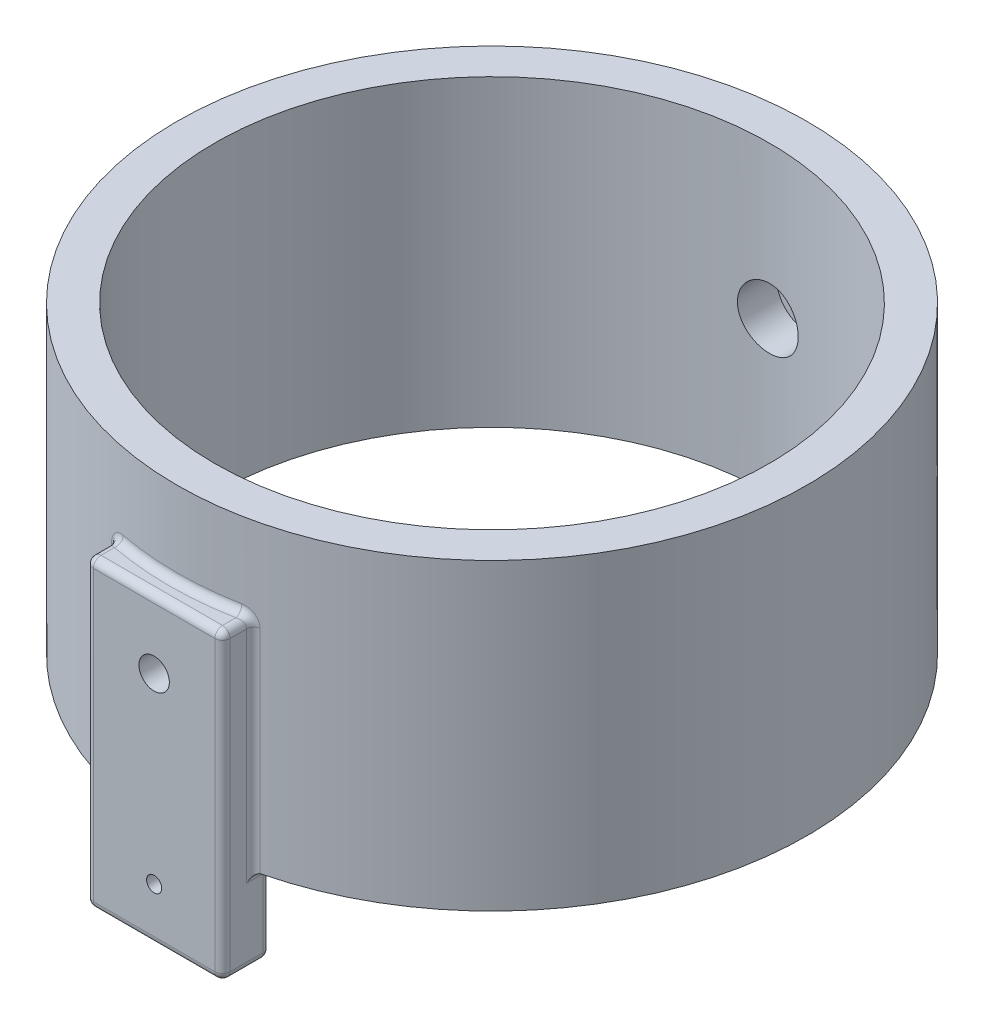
ISO-10303-21;
HEADER;
FILE_DESCRIPTION(('STEP AP214'),'2;1');
FILE_NAME('part.step','',(''),(''),'','','');
FILE_SCHEMA(('AUTOMOTIVE_DESIGN { 1 0 10303 214 1 1 1 1 }'));
ENDSEC;
DATA;
#1=APPLICATION_CONTEXT('core data for automotive mechanical design processes');
#2=APPLICATION_PROTOCOL_DEFINITION('international standard','automotive_design',2000,#1);
#3=PRODUCT_CONTEXT('',#1,'mechanical');
#4=PRODUCT('Part','Part','',(#3));
#5=PRODUCT_RELATED_PRODUCT_CATEGORY('part','',(#4));
#6=PRODUCT_DEFINITION_FORMATION('','',#4);
#7=PRODUCT_DEFINITION_CONTEXT('part definition',#1,'design');
#8=PRODUCT_DEFINITION('design','',#6,#7);
#9=PRODUCT_DEFINITION_SHAPE('','',#8);
#10=(LENGTH_UNIT() NAMED_UNIT(*) SI_UNIT(.MILLI.,.METRE.));
#11=(NAMED_UNIT(*) PLANE_ANGLE_UNIT() SI_UNIT($,.RADIAN.));
#12=(NAMED_UNIT(*) SI_UNIT($,.STERADIAN.) SOLID_ANGLE_UNIT());
#13=UNCERTAINTY_MEASURE_WITH_UNIT(LENGTH_MEASURE(1.E-05),#10,'distance_accuracy_value','');
#14=(GEOMETRIC_REPRESENTATION_CONTEXT(3) GLOBAL_UNCERTAINTY_ASSIGNED_CONTEXT((#13)) GLOBAL_UNIT_ASSIGNED_CONTEXT((#10,
#11,#12)) REPRESENTATION_CONTEXT('',''));
#15=CARTESIAN_POINT('',(0.,0.,0.));
#16=DIRECTION('',(0.,0.,1.));
#17=DIRECTION('',(1.,0.,0.));
#18=AXIS2_PLACEMENT_3D('',#15,#16,#17);
#19=CARTESIAN_POINT('',(0.,40.,0.));
#20=DIRECTION('',(0.,-1.,0.));
#21=DIRECTION('',(0.,0.,-1.));
#22=AXIS2_PLACEMENT_3D('',#19,#20,#21);
#23=CYLINDRICAL_SURFACE('',#22,41.5);
#24=CARTESIAN_POINT('',(0.,40.,0.));
#25=DIRECTION('',(0.,1.,0.));
#26=DIRECTION('',(0.,0.,1.));
#27=AXIS2_PLACEMENT_3D('',#24,#25,#26);
#28=CIRCLE('',#27,41.5);
#29=CARTESIAN_POINT('',(0.,40.,41.5));
#30=VERTEX_POINT('',#29);
#31=EDGE_CURVE('E1507',#30,#30,#28,.F.);
#32=ORIENTED_EDGE('',*,*,#31,.T.);
#33=EDGE_LOOP('',(#32));
#34=FACE_BOUND('',#33,.T.);
#35=CARTESIAN_POINT('',(7.15474130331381,29.8834186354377,40.8785968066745));
#36=CARTESIAN_POINT('',(7.50126834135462,28.8837258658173,40.8179462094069));
#37=CARTESIAN_POINT('',(7.66357235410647,28.9417093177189,41.863623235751));
#38=CARTESIAN_POINT('',(7.26023385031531,29.922110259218,40.8601515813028));
#39=CARTESIAN_POINT('',(7.54738846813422,28.9106597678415,40.8089518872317));
#40=CARTESIAN_POINT('',(7.71758962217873,28.9610551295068,41.8447335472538));
#41=CARTESIAN_POINT('',(7.36882208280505,29.9512618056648,40.8407076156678));
#42=CARTESIAN_POINT('',(7.5967996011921,28.9344159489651,40.7994090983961));
#43=CARTESIAN_POINT('',(7.77319203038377,28.9756309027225,41.8248210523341));
#44=CARTESIAN_POINT('',(7.58889371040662,29.9901936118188,40.8003772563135));
#45=CARTESIAN_POINT('',(7.70070659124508,28.973655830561,40.779426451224));
#46=CARTESIAN_POINT('',(7.88587930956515,28.9950968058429,41.7835188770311));
#47=CARTESIAN_POINT('',(7.70037413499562,29.9999930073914,40.7794923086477));
#48=CARTESIAN_POINT('',(7.75509264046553,28.9892089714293,40.7690068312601));
#49=CARTESIAN_POINT('',(7.94296265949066,28.9999965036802,41.7621306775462));
#50=CARTESIAN_POINT('',(7.92365814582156,30.0000070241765,40.736700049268));
#51=CARTESIAN_POINT('',(7.86808338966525,29.0107237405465,40.7473496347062));
#52=CARTESIAN_POINT('',(8.05729483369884,29.0000035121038,41.7183072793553));
#53=CARTESIAN_POINT('',(8.0354609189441,29.9901330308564,40.7147885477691));
#54=CARTESIAN_POINT('',(7.92662447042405,29.016737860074,40.7361243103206));
#55=CARTESIAN_POINT('',(8.11454324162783,28.9950665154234,41.6958677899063));
#56=CARTESIAN_POINT('',(8.25571950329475,29.9509963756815,40.6706981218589));
#57=CARTESIAN_POINT('',(8.04586268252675,29.0177891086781,40.7131511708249));
#58=CARTESIAN_POINT('',(8.22732625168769,28.9754981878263,41.6507149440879));
#59=CARTESIAN_POINT('',(8.36417546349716,29.9217345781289,40.6485192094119));
#60=CARTESIAN_POINT('',(8.10651533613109,29.0129475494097,40.7014131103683));
#61=CARTESIAN_POINT('',(8.28286093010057,28.9608672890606,41.6280015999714));
#62=CARTESIAN_POINT('',(8.57471605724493,29.844621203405,40.604628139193));
#63=CARTESIAN_POINT('',(8.22773685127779,28.9914532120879,40.6777747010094));
#64=CARTESIAN_POINT('',(8.39066786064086,28.9223106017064,41.5830529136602));
#65=CARTESIAN_POINT('',(8.67679967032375,29.7967666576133,40.5829160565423));
#66=CARTESIAN_POINT('',(8.28831197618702,28.9749272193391,40.6658750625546));
#67=CARTESIAN_POINT('',(8.44293959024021,28.8983833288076,41.5608176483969));
#68=CARTESIAN_POINT('',(8.87166742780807,29.6837348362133,40.5407629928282));
#69=CARTESIAN_POINT('',(8.40678113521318,28.9297818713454,40.6423923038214));
#70=CARTESIAN_POINT('',(8.54272127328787,28.8418674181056,41.5176488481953));
#71=CARTESIAN_POINT('',(8.96445181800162,29.618558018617,40.5203219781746));
#72=CARTESIAN_POINT('',(8.46473506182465,28.9012776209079,40.6307995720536));
#73=CARTESIAN_POINT('',(8.59023135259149,28.8092790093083,41.4967152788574));
#74=CARTESIAN_POINT('',(9.13761904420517,29.4729156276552,40.4816226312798));
#75=CARTESIAN_POINT('',(8.57499071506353,28.8327085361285,40.6085432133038));
#76=CARTESIAN_POINT('',(8.67890131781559,28.7364578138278,41.4570834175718));
#77=CARTESIAN_POINT('',(9.21805334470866,29.3925168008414,40.4633553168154));
#78=CARTESIAN_POINT('',(8.62741842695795,28.792772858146,40.5978570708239));
#79=CARTESIAN_POINT('',(8.72008755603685,28.6962584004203,41.4383759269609));
#80=CARTESIAN_POINT('',(9.36452483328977,29.2184163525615,40.4297085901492));
#81=CARTESIAN_POINT('',(8.72424190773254,28.7023844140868,40.5779608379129));
#82=CARTESIAN_POINT('',(8.79508801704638,28.6092081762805,41.4039184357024));
#83=CARTESIAN_POINT('',(9.43056308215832,29.1247157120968,40.4143289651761));
#84=CARTESIAN_POINT('',(8.76877175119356,28.6519565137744,40.5687246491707));
#85=CARTESIAN_POINT('',(8.82890278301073,28.5623578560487,41.3881682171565));
#86=CARTESIAN_POINT('',(9.54491200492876,28.9286888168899,40.3874738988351));
#87=CARTESIAN_POINT('',(8.8465970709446,28.5434998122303,40.5524785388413));
#88=CARTESIAN_POINT('',(8.88745494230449,28.4643444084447,41.3606660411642));
#89=CARTESIAN_POINT('',(9.59355744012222,28.8265780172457,40.3759250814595));
#90=CARTESIAN_POINT('',(8.8802295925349,28.4856180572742,40.5454014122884));
#91=CARTESIAN_POINT('',(8.91236374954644,28.4132890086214,41.3488389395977));
#92=CARTESIAN_POINT('',(9.67335445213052,28.6150649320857,40.3568817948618));
#93=CARTESIAN_POINT('',(8.93565736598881,28.3637850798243,40.5336895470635));
#94=CARTESIAN_POINT('',(8.95322366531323,28.3075324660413,41.3293367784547));
#95=CARTESIAN_POINT('',(9.70451086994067,28.5056646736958,40.3493862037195));
#96=CARTESIAN_POINT('',(8.95756475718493,28.299744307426,40.5290314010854));
#97=CARTESIAN_POINT('',(8.96917725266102,28.2528323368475,41.3216605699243));
#98=CARTESIAN_POINT('',(9.74770373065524,28.2856740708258,40.3389732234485));
#99=CARTESIAN_POINT('',(8.98795029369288,28.1700055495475,40.5225595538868));
#100=CARTESIAN_POINT('',(8.99129407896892,28.1428370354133,41.3109966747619));
#101=CARTESIAN_POINT('',(9.76020813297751,28.1751854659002,40.3359438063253));
#102=CARTESIAN_POINT('',(8.99681845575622,28.1042714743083,40.5206632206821));
#103=CARTESIAN_POINT('',(8.99769693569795,28.0875927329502,41.3078942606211));
#104=CARTESIAN_POINT('',(9.76718047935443,27.9535426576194,40.334255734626));
#105=CARTESIAN_POINT('',(9.00175003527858,27.972373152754,40.5196093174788));
#106=CARTESIAN_POINT('',(9.00126711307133,27.9767713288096,41.3061655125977));
#107=CARTESIAN_POINT('',(9.76164411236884,27.8423883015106,40.3355981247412));
#108=CARTESIAN_POINT('',(8.99782083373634,27.9060695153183,40.5204501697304));
#109=CARTESIAN_POINT('',(8.99843222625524,27.9211941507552,41.3075402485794));
#110=CARTESIAN_POINT('',(9.7328868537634,27.6242287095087,40.3425479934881));
#111=CARTESIAN_POINT('',(8.97752611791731,27.7767727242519,40.5247810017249));
#112=CARTESIAN_POINT('',(8.98370712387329,27.8121143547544,41.3146575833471));
#113=CARTESIAN_POINT('',(9.70991070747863,27.5171874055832,40.3480964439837));
#114=CARTESIAN_POINT('',(8.96129131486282,27.7136174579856,40.5282431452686));
#115=CARTESIAN_POINT('',(8.97194222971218,27.7585937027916,41.3203397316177));
#116=CARTESIAN_POINT('',(9.64740087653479,27.3085407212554,40.3630830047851));
#117=CARTESIAN_POINT('',(8.91763508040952,27.5919895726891,40.5375016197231));
#118=CARTESIAN_POINT('',(8.93993418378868,27.6542703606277,41.3356874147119));
#119=CARTESIAN_POINT('',(9.60785861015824,27.2069381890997,40.3725231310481));
#120=CARTESIAN_POINT('',(8.89012565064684,27.5334215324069,40.5433164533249));
#121=CARTESIAN_POINT('',(8.91968663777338,27.6034690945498,41.3453550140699));
#122=CARTESIAN_POINT('',(9.5604643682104,27.109549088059,40.3837531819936));
#123=CARTESIAN_POINT('',(8.85756180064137,27.4786387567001,40.5501585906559));
#124=CARTESIAN_POINT('',(8.89541850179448,27.5547745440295,41.3568556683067));
#125=(BOUNDED_SURFACE() B_SPLINE_SURFACE(3,2,((#35,#36,#37),(#38,#39,#40),(#41,#42,#43),(#44,
#45,#46),(#47,#48,#49),(#50,#51,#52),(#53,#54,#55),(#56,#57,#58),(#59,#60,#61),(#62,#63,#64),
(#65,#66,#67),(#68,#69,#70),(#71,#72,#73),(#74,#75,#76),(#77,#78,#79),(#80,#81,#82),(#83,#84,
#85),(#86,#87,#88),(#89,#90,#91),(#92,#93,#94),(#95,#96,#97),(#98,#99,#100),(#101,#102,#103),
(#104,#105,#106),(#107,#108,#109),(#110,#111,#112),(#113,#114,#115),(#116,#117,#118),(#119,#120,
#121),(#122,#123,#124)),.UNSPECIFIED.,.F.,.F.,.F.) B_SPLINE_SURFACE_WITH_KNOTS((4,2,2,2,2,2,2,2,
2,2,2,2,2,2,4),(3,3),(0.,0.348385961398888,0.696427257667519,1.0460397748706,1.39563670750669,
1.74528948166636,2.09493301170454,2.44307749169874,2.79119630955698,3.13219957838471,
3.47310841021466,3.80531124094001,4.13759346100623,4.46529680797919,4.793170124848),(0.,1.),
.UNSPECIFIED.) GEOMETRIC_REPRESENTATION_ITEM() RATIONAL_B_SPLINE_SURFACE(((1.,0.686293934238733,
1.),(1.,0.689368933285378,1.),(1.,0.692675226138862,1.),(1.,0.699646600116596,1.),(1.,
0.703311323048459,1.),(1.,0.710919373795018,1.),(1.,0.71486388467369,1.),(1.,0.722878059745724,
1.),(1.,0.726947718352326,1.),(1.,0.735056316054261,1.),(1.,0.739095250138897,1.),(1.,
0.746971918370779,1.),(1.,0.750809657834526,1.),(1.,0.758095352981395,1.),(1.,0.761544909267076,
1.),(1.,0.76790836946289,1.),(1.,0.770822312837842,1.),(1.,0.775914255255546,1.),(1.,
0.778106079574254,1.),(1.,0.781721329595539,1.),(1.,0.78314496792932,1.),(1.,0.785122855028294,
1.),(1.,0.78569837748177,1.),(1.,0.786019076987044,1.),(1.,0.785764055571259,1.),(1.,
0.784443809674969,1.),(1.,0.78338979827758,1.),(1.,0.780544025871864,1.),(1.,0.778751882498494,
1.),(1.,0.776620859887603,1.))) REPRESENTATION_ITEM('') SURFACE());
#126=CARTESIAN_POINT('',(9.5604643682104,27.109549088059,40.3837531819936));
#127=CARTESIAN_POINT('',(9.60785861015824,27.2069381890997,40.3725231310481));
#128=CARTESIAN_POINT('',(9.64740087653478,27.3085407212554,40.3630830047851));
#129=CARTESIAN_POINT('',(9.70991070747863,27.5171874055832,40.3480964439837));
#130=CARTESIAN_POINT('',(9.7328868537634,27.6242287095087,40.3425479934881));
#131=CARTESIAN_POINT('',(9.76164411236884,27.8423883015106,40.3355981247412));
#132=CARTESIAN_POINT('',(9.76718047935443,27.9535426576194,40.334255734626));
#133=CARTESIAN_POINT('',(9.76020813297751,28.1751854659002,40.3359438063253));
#134=CARTESIAN_POINT('',(9.74770373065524,28.2856740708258,40.3389732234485));
#135=CARTESIAN_POINT('',(9.70451086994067,28.5056646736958,40.3493862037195));
#136=CARTESIAN_POINT('',(9.67335445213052,28.6150649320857,40.3568817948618));
#137=CARTESIAN_POINT('',(9.59355744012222,28.8265780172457,40.3759250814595));
#138=CARTESIAN_POINT('',(9.54491200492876,28.9286888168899,40.3874738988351));
#139=CARTESIAN_POINT('',(9.43056308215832,29.1247157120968,40.4143289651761));
#140=CARTESIAN_POINT('',(9.36452483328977,29.2184163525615,40.4297085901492));
#141=CARTESIAN_POINT('',(9.21805334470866,29.3925168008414,40.4633553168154));
#142=CARTESIAN_POINT('',(9.13761904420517,29.4729156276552,40.4816226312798));
#143=CARTESIAN_POINT('',(8.96445181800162,29.618558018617,40.5203219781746));
#144=CARTESIAN_POINT('',(8.87166742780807,29.6837348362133,40.5407629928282));
#145=CARTESIAN_POINT('',(8.67679967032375,29.7967666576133,40.5829160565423));
#146=CARTESIAN_POINT('',(8.57471605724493,29.844621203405,40.604628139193));
#147=CARTESIAN_POINT('',(8.36417546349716,29.9217345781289,40.6485192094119));
#148=CARTESIAN_POINT('',(8.25571950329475,29.9509963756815,40.6706981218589));
#149=CARTESIAN_POINT('',(8.0354609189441,29.9901330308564,40.7147885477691));
#150=CARTESIAN_POINT('',(7.92365814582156,30.0000070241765,40.736700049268));
#151=CARTESIAN_POINT('',(7.70037413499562,29.9999930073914,40.7794923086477));
#152=CARTESIAN_POINT('',(7.58889371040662,29.9901936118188,40.8003772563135));
#153=CARTESIAN_POINT('',(7.36882208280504,29.9512618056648,40.8407076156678));
#154=CARTESIAN_POINT('',(7.26023385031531,29.922110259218,40.8601515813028));
#155=CARTESIAN_POINT('',(7.15474130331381,29.8834186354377,40.8785968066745));
#156=B_SPLINE_CURVE_WITH_KNOTS('',3,(#126,#127,#128,#129,#130,#131,#132,#133,#134,#135,#136,
#137,#138,#139,#140,#141,#142,#143,#144,#145,#146,#147,#148,#149,#150,#151,#152,#153,#154,#155),
.UNSPECIFIED.,.F.,.F.,(4,2,2,2,2,2,2,2,2,2,2,2,2,2,4),(0.,0.327873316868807,0.655576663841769,
0.987858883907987,1.32006171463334,1.66097054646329,2.00197381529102,2.35009263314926,
2.69823711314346,3.04788064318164,3.39753341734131,3.7471303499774,4.09674286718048,
4.44478416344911,4.793170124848),.UNSPECIFIED.);
#157=CARTESIAN_POINT('',(9.76470588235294,28.,40.3348548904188));
#158=VERTEX_POINT('',#157);
#159=CARTESIAN_POINT('',(7.81176470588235,30.,40.7581443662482));
#160=VERTEX_POINT('',#159);
#161=EDGE_CURVE('E447',#158,#160,#156,.T.);
#162=ORIENTED_EDGE('',*,*,#161,.F.);
#163=DIRECTION('',(0.,-1.,0.));
#164=VECTOR('',#163,1.);
#165=CARTESIAN_POINT('',(9.76470588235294,40.,40.3348548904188));
#166=LINE('',#165,#164);
#167=CARTESIAN_POINT('',(9.76470588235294,-0.0280757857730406,40.3348548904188));
#168=VERTEX_POINT('',#167);
#169=EDGE_CURVE('E71',#158,#168,#166,.T.);
#170=ORIENTED_EDGE('',*,*,#169,.T.);
#171=CARTESIAN_POINT('',(9.76470588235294,-0.0280757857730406,40.3348548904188));
#172=CARTESIAN_POINT('',(9.80342402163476,-0.0187267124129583,40.3254831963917));
#173=CARTESIAN_POINT('',(9.84239093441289,-0.0117125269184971,40.3159898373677));
#174=CARTESIAN_POINT('',(9.92082230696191,-0.00235393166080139,40.2967597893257));
#175=CARTESIAN_POINT('',(9.9602867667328,-9.52189758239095E-06,40.2870231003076));
#176=CARTESIAN_POINT('',(10.,0.,40.2771647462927));
#177=B_SPLINE_CURVE_WITH_KNOTS('',3,(#171,#172,#173,#174,#175,#176),.UNSPECIFIED.,.F.,.F.,(4,2,
4),(0.,0.122146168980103,0.244292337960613),.UNSPECIFIED.);
#178=CARTESIAN_POINT('',(10.,0.,40.2771647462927));
#179=VERTEX_POINT('',#178);
#180=EDGE_CURVE('E56',#168,#179,#177,.T.);
#181=ORIENTED_EDGE('',*,*,#180,.T.);
#182=CARTESIAN_POINT('',(0.,0.,0.));
#183=DIRECTION('',(0.,1.,0.));
#184=DIRECTION('',(0.,0.,1.));
#185=AXIS2_PLACEMENT_3D('',#182,#183,#184);
#186=CIRCLE('',#185,41.5);
#187=CARTESIAN_POINT('',(-10.,0.,40.2771647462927));
#188=VERTEX_POINT('',#187);
#189=EDGE_CURVE('E274',#179,#188,#186,.T.);
#190=ORIENTED_EDGE('',*,*,#189,.T.);
#191=CARTESIAN_POINT('',(-10.,0.,40.2771647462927));
#192=CARTESIAN_POINT('',(-9.96028676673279,-9.5218975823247E-06,40.2870231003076));
#193=CARTESIAN_POINT('',(-9.9208223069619,-0.0023539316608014,40.2967597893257));
#194=CARTESIAN_POINT('',(-9.84239093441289,-0.0117125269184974,40.3159898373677));
#195=CARTESIAN_POINT('',(-9.80342402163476,-0.0187267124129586,40.3254831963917));
#196=CARTESIAN_POINT('',(-9.76470588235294,-0.028075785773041,40.3348548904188));
#197=B_SPLINE_CURVE_WITH_KNOTS('',3,(#191,#192,#193,#194,#195,#196),.UNSPECIFIED.,.F.,.F.,(4,2,
4),(0.,0.122146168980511,0.244292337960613),.UNSPECIFIED.);
#198=CARTESIAN_POINT('',(-9.76470588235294,-0.0280757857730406,40.3348548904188));
#199=VERTEX_POINT('',#198);
#200=EDGE_CURVE('E11',#188,#199,#197,.T.);
#201=ORIENTED_EDGE('',*,*,#200,.T.);
#202=DIRECTION('',(0.,-1.,0.));
#203=VECTOR('',#202,1.);
#204=CARTESIAN_POINT('',(-9.76470588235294,40.,40.3348548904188));
#205=LINE('',#204,#203);
#206=CARTESIAN_POINT('',(-9.76470588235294,28.,40.3348548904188));
#207=VERTEX_POINT('',#206);
#208=EDGE_CURVE('E70',#199,#207,#205,.F.);
#209=ORIENTED_EDGE('',*,*,#208,.T.);
#210=CARTESIAN_POINT('',(-9.66083330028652,27.3564268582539,40.3598600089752));
#211=CARTESIAN_POINT('',(-8.92706088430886,27.6200978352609,40.5355011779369));
#212=CARTESIAN_POINT('',(-8.94681223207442,27.6782134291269,41.3323867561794));
#213=CARTESIAN_POINT('',(-9.69519318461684,27.4596384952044,40.3516233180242));
#214=CARTESIAN_POINT('',(-8.95105156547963,27.6798130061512,40.5304143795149));
#215=CARTESIAN_POINT('',(-8.96440614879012,27.729819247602,41.3239515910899));
#216=CARTESIAN_POINT('',(-9.72116541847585,27.5659211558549,40.3453714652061));
#217=CARTESIAN_POINT('',(-8.96929659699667,27.7423532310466,40.5265328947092));
#218=CARTESIAN_POINT('',(-8.97770518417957,27.7829605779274,41.3175490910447));
#219=CARTESIAN_POINT('',(-9.75591097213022,27.7814691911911,40.3369902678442));
#220=CARTESIAN_POINT('',(-8.99373611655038,27.8698689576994,40.5213249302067));
#221=CARTESIAN_POINT('',(-8.99549658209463,27.8907345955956,41.308965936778));
#222=CARTESIAN_POINT('',(-9.7646990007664,27.8907319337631,40.3348573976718));
#223=CARTESIAN_POINT('',(-8.99998952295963,27.934963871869,40.5199859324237));
#224=CARTESIAN_POINT('',(-8.99999647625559,27.9453659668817,41.3067816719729));
#225=CARTESIAN_POINT('',(-9.76471282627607,28.1102578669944,40.3348523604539));
#226=CARTESIAN_POINT('',(-9.00001057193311,28.0656251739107,40.5199806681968));
#227=CARTESIAN_POINT('',(-9.00000355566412,28.0551289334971,41.3067765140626));
#228=CARTESIAN_POINT('',(-9.75577881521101,28.2205211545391,40.3370189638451));
#229=CARTESIAN_POINT('',(-8.99366457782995,28.1313275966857,40.5213387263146));
#230=CARTESIAN_POINT('',(-8.99542891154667,28.110260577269,41.3089953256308));
#231=CARTESIAN_POINT('',(-9.7203642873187,28.4378419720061,40.3455680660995));
#232=CARTESIAN_POINT('',(-8.96870946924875,28.2598568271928,40.526659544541));
#233=CARTESIAN_POINT('',(-8.97729496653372,28.2189209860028,41.3177504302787));
#234=CARTESIAN_POINT('',(-9.69388736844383,28.5449001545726,40.3519497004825));
#235=CARTESIAN_POINT('',(-8.95005190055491,28.3228097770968,40.5306326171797));
#236=CARTESIAN_POINT('',(-8.96373750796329,28.2724500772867,41.3242858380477));
#237=CARTESIAN_POINT('',(-9.62427639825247,28.7527531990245,40.3686087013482));
#238=CARTESIAN_POINT('',(-8.90152953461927,28.4433325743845,40.5409077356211));
#239=CARTESIAN_POINT('',(-8.92809333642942,28.3763765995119,41.3413462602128));
#240=CARTESIAN_POINT('',(-9.58115308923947,28.8535520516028,40.378883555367));
#241=CARTESIAN_POINT('',(-8.87158019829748,28.5009988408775,40.5472275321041));
#242=CARTESIAN_POINT('',(-8.90601212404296,28.4267760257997,41.3518687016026));
#243=CARTESIAN_POINT('',(-9.47959868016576,29.0462556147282,40.4028454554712));
#244=CARTESIAN_POINT('',(-8.80205019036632,28.6089166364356,40.5617925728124));
#245=CARTESIAN_POINT('',(-8.8540113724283,28.5231278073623,41.3764079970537));
#246=CARTESIAN_POINT('',(-9.42116409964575,29.1381582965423,40.4165332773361));
#247=CARTESIAN_POINT('',(-8.76235244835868,28.6592127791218,40.5700617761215));
#248=CARTESIAN_POINT('',(-8.82409005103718,28.5690791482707,41.3904256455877));
#249=CARTESIAN_POINT('',(-9.28984386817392,29.3118508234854,40.4469206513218));
#250=CARTESIAN_POINT('',(-8.67469273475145,28.7514150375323,40.5881664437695));
#251=CARTESIAN_POINT('',(-8.75684776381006,28.6559254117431,41.4215452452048));
#252=CARTESIAN_POINT('',(-9.21677313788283,29.3934867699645,40.4636584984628));
#253=CARTESIAN_POINT('',(-8.62650903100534,28.7931886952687,40.598044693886));
#254=CARTESIAN_POINT('',(-8.7194320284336,28.6967433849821,41.438686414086));
#255=CARTESIAN_POINT('',(-9.05880503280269,29.5431092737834,40.4993160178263));
#256=CARTESIAN_POINT('',(-8.52453416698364,28.8664012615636,40.6187581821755));
#257=CARTESIAN_POINT('',(-8.63854474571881,28.7715546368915,41.4752031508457));
#258=CARTESIAN_POINT('',(-8.97390655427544,29.6110945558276,40.5182358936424));
#259=CARTESIAN_POINT('',(-8.47063864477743,28.8977851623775,40.629612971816));
#260=CARTESIAN_POINT('',(-8.59507263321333,28.8055472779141,41.4945789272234));
#261=CARTESIAN_POINT('',(-8.79232228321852,29.7332918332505,40.5580313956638));
#262=CARTESIAN_POINT('',(-8.35814605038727,28.9503932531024,40.6520653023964));
#263=CARTESIAN_POINT('',(-8.50209273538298,28.866645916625,41.5353333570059));
#264=CARTESIAN_POINT('',(-8.69539160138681,29.787109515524,40.5789445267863));
#265=CARTESIAN_POINT('',(-8.29940473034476,28.9712354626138,40.6636845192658));
#266=CARTESIAN_POINT('',(-8.45245955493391,28.8935547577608,41.5567504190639));
#267=CARTESIAN_POINT('',(-8.49422973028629,29.8772775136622,40.6215291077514));
#268=CARTESIAN_POINT('',(-8.18090902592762,29.0016007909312,40.686935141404));
#269=CARTESIAN_POINT('',(-8.34945498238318,28.9386387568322,41.600361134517));
#270=CARTESIAN_POINT('',(-8.38999818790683,29.9136269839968,40.6432005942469));
#271=CARTESIAN_POINT('',(-8.12112818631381,29.0110043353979,40.6985697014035));
#272=CARTESIAN_POINT('',(-8.29608340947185,28.9568134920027,41.6225548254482));
#273=CARTESIAN_POINT('',(-8.17525089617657,29.9683716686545,40.6869446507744));
#274=CARTESIAN_POINT('',(-8.0017182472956,29.0191522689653,40.721676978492));
#275=CARTESIAN_POINT('',(-8.18612244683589,28.9841858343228,41.6673529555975));
#276=CARTESIAN_POINT('',(-8.06465851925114,29.9864517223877,40.7090177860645));
#277=CARTESIAN_POINT('',(-7.9421439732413,29.0175874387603,40.7331352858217));
#278=CARTESIAN_POINT('',(-8.12949382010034,28.9932258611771,41.6899579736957));
#279=CARTESIAN_POINT('',(-7.84194481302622,30.0030295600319,40.7525066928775));
#280=CARTESIAN_POINT('',(-7.82611179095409,29.0044069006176,40.7554015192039));
#281=CARTESIAN_POINT('',(-8.01545366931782,29.0015147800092,41.7344948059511));
#282=CARTESIAN_POINT('',(-7.7298233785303,30.001525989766,40.773922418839));
#283=CARTESIAN_POINT('',(-7.7697228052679,28.9926828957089,40.766195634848));
#284=CARTESIAN_POINT('',(-7.95804209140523,29.0007629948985,41.756426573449));
#285=CARTESIAN_POINT('',(-7.50717509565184,29.9788391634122,40.8155001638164));
#286=CARTESIAN_POINT('',(-7.66150474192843,28.9605076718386,40.7869571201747));
#287=CARTESIAN_POINT('',(-7.84403544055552,28.9894195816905,41.7990061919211));
#288=CARTESIAN_POINT('',(-7.39664932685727,29.9576431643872,40.8356613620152));
#289=CARTESIAN_POINT('',(-7.60977871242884,28.9399746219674,40.7969052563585));
#290=CARTESIAN_POINT('',(-7.7874409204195,28.9788215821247,41.8196532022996));
#291=CARTESIAN_POINT('',(-7.18035621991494,29.8961044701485,40.8742579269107));
#292=CARTESIAN_POINT('',(-7.51174935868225,28.8915200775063,40.8158785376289));
#293=CARTESIAN_POINT('',(-7.67668842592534,28.9480522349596,41.8591798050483));
#294=CARTESIAN_POINT('',(-7.0745944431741,29.8557400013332,40.8926913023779));
#295=CARTESIAN_POINT('',(-7.46556446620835,28.8635491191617,40.8248821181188));
#296=CARTESIAN_POINT('',(-7.6225332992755,28.9278700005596,41.8780573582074));
#297=CARTESIAN_POINT('',(-6.97289081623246,29.8060919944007,40.9100084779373));
#298=CARTESIAN_POINT('',(-7.42277762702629,28.8328010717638,40.8333276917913));
#299=CARTESIAN_POINT('',(-7.57045614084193,28.9030459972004,41.8957918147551));
#300=(BOUNDED_SURFACE() B_SPLINE_SURFACE(3,2,((#210,#211,#212),(#213,#214,#215),(#216,#217,
#218),(#219,#220,#221),(#222,#223,#224),(#225,#226,#227),(#228,#229,#230),(#231,#232,#233),
(#234,#235,#236),(#237,#238,#239),(#240,#241,#242),(#243,#244,#245),(#246,#247,#248),(#249,#250,
#251),(#252,#253,#254),(#255,#256,#257),(#258,#259,#260),(#261,#262,#263),(#264,#265,#266),
(#267,#268,#269),(#270,#271,#272),(#273,#274,#275),(#276,#277,#278),(#279,#280,#281),(#282,#283,
#284),(#285,#286,#287),(#288,#289,#290),(#291,#292,#293),(#294,#295,#296),(#297,#298,#299)),
.UNSPECIFIED.,.F.,.F.,.F.) B_SPLINE_SURFACE_WITH_KNOTS((4,2,2,2,2,2,2,2,2,2,2,2,2,2,4),(3,3),
(0.,0.327701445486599,0.655122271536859,0.985509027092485,1.31582804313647,1.645934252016,
1.97611556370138,2.31077073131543,2.64545714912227,2.98865645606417,3.33187237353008,
3.68091282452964,4.02997741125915,4.37926803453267,4.72895637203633),(0.,1.),
.UNSPECIFIED.) GEOMETRIC_REPRESENTATION_ITEM() RATIONAL_B_SPLINE_SURFACE(((1.,0.7811560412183,
1.),(1.,0.782720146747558,1.),(1.,0.78390755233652,1.),(1.,0.785499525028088,1.),(1.,
0.785904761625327,1.),(1.,0.785905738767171,1.),(1.,0.785494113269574,1.),(1.,0.783870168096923,
1.),(1.,0.782658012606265,1.),(1.,0.779494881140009,1.),(1.,0.777544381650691,1.),(1.,
0.772999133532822,1.),(1.,0.770404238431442,1.),(1.,0.764651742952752,1.),(1.,0.761486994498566,
1.),(1.,0.754761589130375,1.),(1.,0.751200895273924,1.),(1.,0.743740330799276,1.),(1.,
0.739834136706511,1.),(1.,0.731926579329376,1.),(1.,0.727925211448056,1.),(1.,0.719914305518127,
1.),(1.,0.715905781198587,1.),(1.,0.708095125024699,1.),(1.,0.704293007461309,1.),(1.,
0.697015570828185,1.),(1.,0.693540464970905,1.),(1.,0.686998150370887,1.),(1.,0.683931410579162,
1.),(1.,0.681112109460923,1.))) REPRESENTATION_ITEM('') SURFACE());
#301=CARTESIAN_POINT('',(-6.97289081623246,29.8060919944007,40.9100084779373));
#302=CARTESIAN_POINT('',(-7.0745944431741,29.8557400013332,40.8926913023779));
#303=CARTESIAN_POINT('',(-7.18035621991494,29.8961044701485,40.8742579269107));
#304=CARTESIAN_POINT('',(-7.39664932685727,29.9576431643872,40.8356613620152));
#305=CARTESIAN_POINT('',(-7.50717509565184,29.9788391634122,40.8155001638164));
#306=CARTESIAN_POINT('',(-7.7298233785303,30.001525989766,40.773922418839));
#307=CARTESIAN_POINT('',(-7.84194481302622,30.0030295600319,40.7525066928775));
#308=CARTESIAN_POINT('',(-8.06465851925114,29.9864517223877,40.7090177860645));
#309=CARTESIAN_POINT('',(-8.17525089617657,29.9683716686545,40.6869446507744));
#310=CARTESIAN_POINT('',(-8.38999818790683,29.9136269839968,40.6432005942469));
#311=CARTESIAN_POINT('',(-8.49422973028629,29.8772775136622,40.6215291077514));
#312=CARTESIAN_POINT('',(-8.69539160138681,29.787109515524,40.5789445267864));
#313=CARTESIAN_POINT('',(-8.79232228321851,29.7332918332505,40.5580313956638));
#314=CARTESIAN_POINT('',(-8.97390655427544,29.6110945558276,40.5182358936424));
#315=CARTESIAN_POINT('',(-9.05880503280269,29.5431092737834,40.4993160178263));
#316=CARTESIAN_POINT('',(-9.21677313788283,29.3934867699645,40.4636584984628));
#317=CARTESIAN_POINT('',(-9.28984386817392,29.3118508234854,40.4469206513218));
#318=CARTESIAN_POINT('',(-9.42116409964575,29.1381582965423,40.4165332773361));
#319=CARTESIAN_POINT('',(-9.47959868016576,29.0462556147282,40.4028454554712));
#320=CARTESIAN_POINT('',(-9.58115308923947,28.8535520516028,40.378883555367));
#321=CARTESIAN_POINT('',(-9.62427639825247,28.7527531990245,40.3686087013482));
#322=CARTESIAN_POINT('',(-9.69388736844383,28.5449001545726,40.3519497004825));
#323=CARTESIAN_POINT('',(-9.7203642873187,28.4378419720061,40.3455680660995));
#324=CARTESIAN_POINT('',(-9.75577881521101,28.2205211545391,40.3370189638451));
#325=CARTESIAN_POINT('',(-9.76471282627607,28.1102578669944,40.3348523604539));
#326=CARTESIAN_POINT('',(-9.7646990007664,27.8907319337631,40.3348573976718));
#327=CARTESIAN_POINT('',(-9.75591097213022,27.7814691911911,40.3369902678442));
#328=CARTESIAN_POINT('',(-9.72116541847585,27.5659211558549,40.3453714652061));
#329=CARTESIAN_POINT('',(-9.69519318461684,27.4596384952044,40.3516233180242));
#330=CARTESIAN_POINT('',(-9.66083330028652,27.3564268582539,40.3598600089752));
#331=B_SPLINE_CURVE_WITH_KNOTS('',3,(#301,#302,#303,#304,#305,#306,#307,#308,#309,#310,#311,
#312,#313,#314,#315,#316,#317,#318,#319,#320,#321,#322,#323,#324,#325,#326,#327,#328,#329,#330),
.UNSPECIFIED.,.F.,.F.,(4,2,2,2,2,2,2,2,2,2,2,2,2,2,4),(0.,0.349688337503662,0.698978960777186,
1.04804354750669,1.39708399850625,1.74029991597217,2.08349922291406,2.4181856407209,
2.75284080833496,3.08302212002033,3.41312832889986,3.74344734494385,4.07383410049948,
4.40125492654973,4.72895637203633),.UNSPECIFIED.);
#332=CARTESIAN_POINT('',(-7.81176470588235,30.,40.7581443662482));
#333=VERTEX_POINT('',#332);
#334=EDGE_CURVE('E455',#333,#207,#331,.T.);
#335=ORIENTED_EDGE('',*,*,#334,.F.);
#336=CARTESIAN_POINT('',(0.,30.,0.));
#337=DIRECTION('',(0.,1.,0.));
#338=DIRECTION('',(0.,0.,1.));
#339=AXIS2_PLACEMENT_3D('',#336,#337,#338);
#340=CIRCLE('',#339,41.5);
#341=EDGE_CURVE('E926',#333,#160,#340,.T.);
#342=ORIENTED_EDGE('',*,*,#341,.T.);
#343=EDGE_LOOP('',(#162,#170,#181,#190,#201,#209,#335,#342));
#344=FACE_BOUND('',#343,.T.);
#345=CARTESIAN_POINT('',(-7.15474130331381,29.8834186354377,-40.8785968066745));
#346=CARTESIAN_POINT('',(-7.50126834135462,28.8837258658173,-40.8179462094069));
#347=CARTESIAN_POINT('',(-7.66357235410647,28.9417093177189,-41.863623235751));
#348=CARTESIAN_POINT('',(-7.26023385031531,29.922110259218,-40.8601515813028));
#349=CARTESIAN_POINT('',(-7.54738846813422,28.9106597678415,-40.8089518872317));
#350=CARTESIAN_POINT('',(-7.71758962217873,28.9610551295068,-41.8447335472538));
#351=CARTESIAN_POINT('',(-7.36882208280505,29.9512618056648,-40.8407076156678));
#352=CARTESIAN_POINT('',(-7.5967996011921,28.9344159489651,-40.7994090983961));
#353=CARTESIAN_POINT('',(-7.77319203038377,28.9756309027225,-41.8248210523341));
#354=CARTESIAN_POINT('',(-7.58889371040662,29.9901936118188,-40.8003772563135));
#355=CARTESIAN_POINT('',(-7.70070659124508,28.973655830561,-40.779426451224));
#356=CARTESIAN_POINT('',(-7.88587930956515,28.9950968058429,-41.7835188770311));
#357=CARTESIAN_POINT('',(-7.70037413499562,29.9999930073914,-40.7794923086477));
#358=CARTESIAN_POINT('',(-7.75509264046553,28.9892089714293,-40.7690068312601));
#359=CARTESIAN_POINT('',(-7.94296265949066,28.9999965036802,-41.7621306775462));
#360=CARTESIAN_POINT('',(-7.92365814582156,30.0000070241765,-40.736700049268));
#361=CARTESIAN_POINT('',(-7.86808338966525,29.0107237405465,-40.7473496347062));
#362=CARTESIAN_POINT('',(-8.05729483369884,29.0000035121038,-41.7183072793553));
#363=CARTESIAN_POINT('',(-8.0354609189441,29.9901330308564,-40.7147885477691));
#364=CARTESIAN_POINT('',(-7.92662447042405,29.016737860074,-40.7361243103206));
#365=CARTESIAN_POINT('',(-8.11454324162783,28.9950665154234,-41.6958677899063));
#366=CARTESIAN_POINT('',(-8.25571950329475,29.9509963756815,-40.6706981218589));
#367=CARTESIAN_POINT('',(-8.04586268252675,29.0177891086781,-40.7131511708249));
#368=CARTESIAN_POINT('',(-8.22732625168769,28.9754981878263,-41.6507149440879));
#369=CARTESIAN_POINT('',(-8.36417546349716,29.9217345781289,-40.6485192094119));
#370=CARTESIAN_POINT('',(-8.10651533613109,29.0129475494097,-40.7014131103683));
#371=CARTESIAN_POINT('',(-8.28286093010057,28.9608672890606,-41.6280015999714));
#372=CARTESIAN_POINT('',(-8.57471605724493,29.844621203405,-40.604628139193));
#373=CARTESIAN_POINT('',(-8.22773685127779,28.9914532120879,-40.6777747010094));
#374=CARTESIAN_POINT('',(-8.39066786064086,28.9223106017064,-41.5830529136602));
#375=CARTESIAN_POINT('',(-8.67679967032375,29.7967666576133,-40.5829160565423));
#376=CARTESIAN_POINT('',(-8.28831197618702,28.9749272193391,-40.6658750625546));
#377=CARTESIAN_POINT('',(-8.44293959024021,28.8983833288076,-41.5608176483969));
#378=CARTESIAN_POINT('',(-8.87166742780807,29.6837348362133,-40.5407629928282));
#379=CARTESIAN_POINT('',(-8.40678113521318,28.9297818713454,-40.6423923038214));
#380=CARTESIAN_POINT('',(-8.54272127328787,28.8418674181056,-41.5176488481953));
#381=CARTESIAN_POINT('',(-8.96445181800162,29.618558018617,-40.5203219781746));
#382=CARTESIAN_POINT('',(-8.46473506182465,28.9012776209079,-40.6307995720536));
#383=CARTESIAN_POINT('',(-8.59023135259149,28.8092790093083,-41.4967152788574));
#384=CARTESIAN_POINT('',(-9.13761904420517,29.4729156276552,-40.4816226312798));
#385=CARTESIAN_POINT('',(-8.57499071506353,28.8327085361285,-40.6085432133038));
#386=CARTESIAN_POINT('',(-8.67890131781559,28.7364578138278,-41.4570834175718));
#387=CARTESIAN_POINT('',(-9.21805334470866,29.3925168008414,-40.4633553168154));
#388=CARTESIAN_POINT('',(-8.62741842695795,28.792772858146,-40.5978570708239));
#389=CARTESIAN_POINT('',(-8.72008755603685,28.6962584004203,-41.4383759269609));
#390=CARTESIAN_POINT('',(-9.36452483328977,29.2184163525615,-40.4297085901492));
#391=CARTESIAN_POINT('',(-8.72424190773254,28.7023844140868,-40.5779608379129));
#392=CARTESIAN_POINT('',(-8.79508801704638,28.6092081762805,-41.4039184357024));
#393=CARTESIAN_POINT('',(-9.43056308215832,29.1247157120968,-40.4143289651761));
#394=CARTESIAN_POINT('',(-8.76877175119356,28.6519565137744,-40.5687246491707));
#395=CARTESIAN_POINT('',(-8.82890278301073,28.5623578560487,-41.3881682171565));
#396=CARTESIAN_POINT('',(-9.54491200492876,28.9286888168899,-40.3874738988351));
#397=CARTESIAN_POINT('',(-8.8465970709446,28.5434998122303,-40.5524785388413));
#398=CARTESIAN_POINT('',(-8.88745494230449,28.4643444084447,-41.3606660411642));
#399=CARTESIAN_POINT('',(-9.59355744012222,28.8265780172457,-40.3759250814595));
#400=CARTESIAN_POINT('',(-8.8802295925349,28.4856180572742,-40.5454014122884));
#401=CARTESIAN_POINT('',(-8.91236374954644,28.4132890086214,-41.3488389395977));
#402=CARTESIAN_POINT('',(-9.67335445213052,28.6150649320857,-40.3568817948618));
#403=CARTESIAN_POINT('',(-8.93565736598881,28.3637850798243,-40.5336895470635));
#404=CARTESIAN_POINT('',(-8.95322366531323,28.3075324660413,-41.3293367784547));
#405=CARTESIAN_POINT('',(-9.70451086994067,28.5056646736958,-40.3493862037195));
#406=CARTESIAN_POINT('',(-8.95756475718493,28.299744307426,-40.5290314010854));
#407=CARTESIAN_POINT('',(-8.96917725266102,28.2528323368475,-41.3216605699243));
#408=CARTESIAN_POINT('',(-9.74770373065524,28.2856740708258,-40.3389732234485));
#409=CARTESIAN_POINT('',(-8.98795029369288,28.1700055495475,-40.5225595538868));
#410=CARTESIAN_POINT('',(-8.99129407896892,28.1428370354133,-41.3109966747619));
#411=CARTESIAN_POINT('',(-9.76020813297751,28.1751854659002,-40.3359438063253));
#412=CARTESIAN_POINT('',(-8.99681845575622,28.1042714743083,-40.5206632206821));
#413=CARTESIAN_POINT('',(-8.99769693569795,28.0875927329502,-41.3078942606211));
#414=CARTESIAN_POINT('',(-9.76718047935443,27.9535426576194,-40.334255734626));
#415=CARTESIAN_POINT('',(-9.00175003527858,27.972373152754,-40.5196093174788));
#416=CARTESIAN_POINT('',(-9.00126711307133,27.9767713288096,-41.3061655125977));
#417=CARTESIAN_POINT('',(-9.76164411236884,27.8423883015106,-40.3355981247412));
#418=CARTESIAN_POINT('',(-8.99782083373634,27.9060695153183,-40.5204501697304));
#419=CARTESIAN_POINT('',(-8.99843222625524,27.9211941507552,-41.3075402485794));
#420=CARTESIAN_POINT('',(-9.7328868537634,27.6242287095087,-40.3425479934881));
#421=CARTESIAN_POINT('',(-8.97752611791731,27.7767727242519,-40.5247810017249));
#422=CARTESIAN_POINT('',(-8.98370712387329,27.8121143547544,-41.3146575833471));
#423=CARTESIAN_POINT('',(-9.70991070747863,27.5171874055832,-40.3480964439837));
#424=CARTESIAN_POINT('',(-8.96129131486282,27.7136174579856,-40.5282431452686));
#425=CARTESIAN_POINT('',(-8.97194222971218,27.7585937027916,-41.3203397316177));
#426=CARTESIAN_POINT('',(-9.64740087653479,27.3085407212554,-40.3630830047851));
#427=CARTESIAN_POINT('',(-8.91763508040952,27.5919895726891,-40.5375016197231));
#428=CARTESIAN_POINT('',(-8.93993418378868,27.6542703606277,-41.3356874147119));
#429=CARTESIAN_POINT('',(-9.60785861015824,27.2069381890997,-40.3725231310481));
#430=CARTESIAN_POINT('',(-8.89012565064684,27.5334215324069,-40.5433164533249));
#431=CARTESIAN_POINT('',(-8.91968663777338,27.6034690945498,-41.3453550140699));
#432=CARTESIAN_POINT('',(-9.5604643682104,27.109549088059,-40.3837531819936));
#433=CARTESIAN_POINT('',(-8.85756180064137,27.4786387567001,-40.5501585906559));
#434=CARTESIAN_POINT('',(-8.89541850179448,27.5547745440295,-41.3568556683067));
#435=(BOUNDED_SURFACE() B_SPLINE_SURFACE(3,2,((#345,#346,#347),(#348,#349,#350),(#351,#352,
#353),(#354,#355,#356),(#357,#358,#359),(#360,#361,#362),(#363,#364,#365),(#366,#367,#368),
(#369,#370,#371),(#372,#373,#374),(#375,#376,#377),(#378,#379,#380),(#381,#382,#383),(#384,#385,
#386),(#387,#388,#389),(#390,#391,#392),(#393,#394,#395),(#396,#397,#398),(#399,#400,#401),
(#402,#403,#404),(#405,#406,#407),(#408,#409,#410),(#411,#412,#413),(#414,#415,#416),(#417,#418,
#419),(#420,#421,#422),(#423,#424,#425),(#426,#427,#428),(#429,#430,#431),(#432,#433,#434)),
.UNSPECIFIED.,.F.,.F.,.F.) B_SPLINE_SURFACE_WITH_KNOTS((4,2,2,2,2,2,2,2,2,2,2,2,2,2,4),(3,3),
(0.,0.348385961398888,0.696427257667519,1.0460397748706,1.39563670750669,1.74528948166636,
2.09493301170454,2.44307749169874,2.79119630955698,3.13219957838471,3.47310841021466,
3.80531124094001,4.13759346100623,4.46529680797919,4.793170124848),(0.,1.),
.UNSPECIFIED.) GEOMETRIC_REPRESENTATION_ITEM() RATIONAL_B_SPLINE_SURFACE(((1.,0.686293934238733,
1.),(1.,0.689368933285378,1.),(1.,0.692675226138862,1.),(1.,0.699646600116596,1.),(1.,
0.703311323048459,1.),(1.,0.710919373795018,1.),(1.,0.71486388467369,1.),(1.,0.722878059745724,
1.),(1.,0.726947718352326,1.),(1.,0.735056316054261,1.),(1.,0.739095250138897,1.),(1.,
0.746971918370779,1.),(1.,0.750809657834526,1.),(1.,0.758095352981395,1.),(1.,0.761544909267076,
1.),(1.,0.76790836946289,1.),(1.,0.770822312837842,1.),(1.,0.775914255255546,1.),(1.,
0.778106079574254,1.),(1.,0.781721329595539,1.),(1.,0.78314496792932,1.),(1.,0.785122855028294,
1.),(1.,0.78569837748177,1.),(1.,0.786019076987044,1.),(1.,0.785764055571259,1.),(1.,
0.784443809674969,1.),(1.,0.78338979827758,1.),(1.,0.780544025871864,1.),(1.,0.778751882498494,
1.),(1.,0.776620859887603,1.))) REPRESENTATION_ITEM('') SURFACE());
#436=CARTESIAN_POINT('',(-9.5604643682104,27.109549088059,-40.3837531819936));
#437=CARTESIAN_POINT('',(-9.60785861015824,27.2069381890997,-40.3725231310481));
#438=CARTESIAN_POINT('',(-9.64740087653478,27.3085407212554,-40.3630830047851));
#439=CARTESIAN_POINT('',(-9.70991070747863,27.5171874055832,-40.3480964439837));
#440=CARTESIAN_POINT('',(-9.7328868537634,27.6242287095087,-40.3425479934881));
#441=CARTESIAN_POINT('',(-9.76164411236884,27.8423883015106,-40.3355981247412));
#442=CARTESIAN_POINT('',(-9.76718047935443,27.9535426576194,-40.334255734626));
#443=CARTESIAN_POINT('',(-9.76020813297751,28.1751854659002,-40.3359438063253));
#444=CARTESIAN_POINT('',(-9.74770373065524,28.2856740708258,-40.3389732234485));
#445=CARTESIAN_POINT('',(-9.70451086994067,28.5056646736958,-40.3493862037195));
#446=CARTESIAN_POINT('',(-9.67335445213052,28.6150649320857,-40.3568817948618));
#447=CARTESIAN_POINT('',(-9.59355744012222,28.8265780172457,-40.3759250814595));
#448=CARTESIAN_POINT('',(-9.54491200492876,28.9286888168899,-40.3874738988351));
#449=CARTESIAN_POINT('',(-9.43056308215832,29.1247157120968,-40.4143289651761));
#450=CARTESIAN_POINT('',(-9.36452483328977,29.2184163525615,-40.4297085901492));
#451=CARTESIAN_POINT('',(-9.21805334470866,29.3925168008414,-40.4633553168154));
#452=CARTESIAN_POINT('',(-9.13761904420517,29.4729156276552,-40.4816226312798));
#453=CARTESIAN_POINT('',(-8.96445181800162,29.618558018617,-40.5203219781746));
#454=CARTESIAN_POINT('',(-8.87166742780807,29.6837348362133,-40.5407629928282));
#455=CARTESIAN_POINT('',(-8.67679967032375,29.7967666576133,-40.5829160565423));
#456=CARTESIAN_POINT('',(-8.57471605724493,29.844621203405,-40.604628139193));
#457=CARTESIAN_POINT('',(-8.36417546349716,29.9217345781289,-40.6485192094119));
#458=CARTESIAN_POINT('',(-8.25571950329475,29.9509963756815,-40.6706981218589));
#459=CARTESIAN_POINT('',(-8.0354609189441,29.9901330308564,-40.7147885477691));
#460=CARTESIAN_POINT('',(-7.92365814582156,30.0000070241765,-40.736700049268));
#461=CARTESIAN_POINT('',(-7.70037413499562,29.9999930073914,-40.7794923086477));
#462=CARTESIAN_POINT('',(-7.58889371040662,29.9901936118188,-40.8003772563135));
#463=CARTESIAN_POINT('',(-7.36882208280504,29.9512618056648,-40.8407076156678));
#464=CARTESIAN_POINT('',(-7.26023385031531,29.922110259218,-40.8601515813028));
#465=CARTESIAN_POINT('',(-7.15474130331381,29.8834186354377,-40.8785968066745));
#466=B_SPLINE_CURVE_WITH_KNOTS('',3,(#436,#437,#438,#439,#440,#441,#442,#443,#444,#445,#446,
#447,#448,#449,#450,#451,#452,#453,#454,#455,#456,#457,#458,#459,#460,#461,#462,#463,#464,#465),
.UNSPECIFIED.,.F.,.F.,(4,2,2,2,2,2,2,2,2,2,2,2,2,2,4),(0.,0.327873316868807,0.655576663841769,
0.987858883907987,1.32006171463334,1.66097054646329,2.00197381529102,2.35009263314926,
2.69823711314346,3.04788064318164,3.39753341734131,3.7471303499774,4.09674286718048,
4.44478416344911,4.793170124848),.UNSPECIFIED.);
#467=CARTESIAN_POINT('',(-9.76470588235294,28.,-40.3348548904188));
#468=VERTEX_POINT('',#467);
#469=CARTESIAN_POINT('',(-7.81176470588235,30.,-40.7581443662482));
#470=VERTEX_POINT('',#469);
#471=EDGE_CURVE('E438',#468,#470,#466,.T.);
#472=ORIENTED_EDGE('',*,*,#471,.F.);
#473=DIRECTION('',(0.,-1.,0.));
#474=VECTOR('',#473,1.);
#475=CARTESIAN_POINT('',(-9.76470588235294,40.,-40.3348548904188));
#476=LINE('',#475,#474);
#477=CARTESIAN_POINT('',(-9.76470588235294,12.,-40.3348548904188));
#478=VERTEX_POINT('',#477);
#479=EDGE_CURVE('E945',#468,#478,#476,.T.);
#480=ORIENTED_EDGE('',*,*,#479,.T.);
#481=CARTESIAN_POINT('',(-9.66083330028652,12.6435731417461,-40.3598600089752));
#482=CARTESIAN_POINT('',(-8.92706088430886,12.3799021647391,-40.5355011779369));
#483=CARTESIAN_POINT('',(-8.94681223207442,12.3217865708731,-41.3323867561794));
#484=CARTESIAN_POINT('',(-9.69519318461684,12.5403615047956,-40.3516233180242));
#485=CARTESIAN_POINT('',(-8.95105156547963,12.3201869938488,-40.5304143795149));
#486=CARTESIAN_POINT('',(-8.96440614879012,12.270180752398,-41.3239515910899));
#487=CARTESIAN_POINT('',(-9.72116541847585,12.4340788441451,-40.3453714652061));
#488=CARTESIAN_POINT('',(-8.96929659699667,12.2576467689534,-40.5265328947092));
#489=CARTESIAN_POINT('',(-8.97770518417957,12.2170394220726,-41.3175490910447));
#490=CARTESIAN_POINT('',(-9.75591097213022,12.2185308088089,-40.3369902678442));
#491=CARTESIAN_POINT('',(-8.99373611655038,12.1301310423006,-40.5213249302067));
#492=CARTESIAN_POINT('',(-8.99549658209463,12.1092654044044,-41.308965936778));
#493=CARTESIAN_POINT('',(-9.7646990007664,12.1092680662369,-40.3348573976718));
#494=CARTESIAN_POINT('',(-8.99998952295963,12.065036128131,-40.5199859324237));
#495=CARTESIAN_POINT('',(-8.99999647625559,12.0546340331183,-41.3067816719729));
#496=CARTESIAN_POINT('',(-9.76471282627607,11.8897421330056,-40.3348523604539));
#497=CARTESIAN_POINT('',(-9.00001057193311,11.9343748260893,-40.5199806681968));
#498=CARTESIAN_POINT('',(-9.00000355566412,11.9448710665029,-41.3067765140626));
#499=CARTESIAN_POINT('',(-9.75577881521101,11.7794788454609,-40.3370189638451));
#500=CARTESIAN_POINT('',(-8.99366457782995,11.8686724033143,-40.5213387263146));
#501=CARTESIAN_POINT('',(-8.99542891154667,11.889739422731,-41.3089953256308));
#502=CARTESIAN_POINT('',(-9.7203642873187,11.5621580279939,-40.3455680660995));
#503=CARTESIAN_POINT('',(-8.96870946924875,11.7401431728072,-40.526659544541));
#504=CARTESIAN_POINT('',(-8.97729496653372,11.7810790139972,-41.3177504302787));
#505=CARTESIAN_POINT('',(-9.69388736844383,11.4550998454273,-40.3519497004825));
#506=CARTESIAN_POINT('',(-8.95005190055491,11.6771902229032,-40.5306326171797));
#507=CARTESIAN_POINT('',(-8.96373750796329,11.7275499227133,-41.3242858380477));
#508=CARTESIAN_POINT('',(-9.62427639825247,11.2472468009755,-40.3686087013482));
#509=CARTESIAN_POINT('',(-8.90152953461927,11.5566674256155,-40.5409077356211));
#510=CARTESIAN_POINT('',(-8.92809333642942,11.6236234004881,-41.3413462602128));
#511=CARTESIAN_POINT('',(-9.58115308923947,11.1464479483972,-40.378883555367));
#512=CARTESIAN_POINT('',(-8.87158019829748,11.4990011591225,-40.5472275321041));
#513=CARTESIAN_POINT('',(-8.90601212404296,11.5732239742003,-41.3518687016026));
#514=CARTESIAN_POINT('',(-9.47959868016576,10.9537443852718,-40.4028454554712));
#515=CARTESIAN_POINT('',(-8.80205019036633,11.3910833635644,-40.5617925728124));
#516=CARTESIAN_POINT('',(-8.8540113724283,11.4768721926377,-41.3764079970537));
#517=CARTESIAN_POINT('',(-9.42116409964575,10.8618417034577,-40.4165332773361));
#518=CARTESIAN_POINT('',(-8.76235244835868,11.3407872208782,-40.5700617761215));
#519=CARTESIAN_POINT('',(-8.82409005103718,11.4309208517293,-41.3904256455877));
#520=CARTESIAN_POINT('',(-9.28984386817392,10.6881491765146,-40.4469206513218));
#521=CARTESIAN_POINT('',(-8.67469273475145,11.2485849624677,-40.5881664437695));
#522=CARTESIAN_POINT('',(-8.75684776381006,11.3440745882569,-41.4215452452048));
#523=CARTESIAN_POINT('',(-9.21677313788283,10.6065132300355,-40.4636584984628));
#524=CARTESIAN_POINT('',(-8.62650903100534,11.2068113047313,-40.598044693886));
#525=CARTESIAN_POINT('',(-8.7194320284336,11.3032566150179,-41.438686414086));
#526=CARTESIAN_POINT('',(-9.05880503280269,10.4568907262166,-40.4993160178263));
#527=CARTESIAN_POINT('',(-8.52453416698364,11.1335987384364,-40.6187581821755));
#528=CARTESIAN_POINT('',(-8.63854474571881,11.2284453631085,-41.4752031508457));
#529=CARTESIAN_POINT('',(-8.97390655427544,10.3889054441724,-40.5182358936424));
#530=CARTESIAN_POINT('',(-8.47063864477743,11.1022148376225,-40.629612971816));
#531=CARTESIAN_POINT('',(-8.59507263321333,11.1944527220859,-41.4945789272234));
#532=CARTESIAN_POINT('',(-8.79232228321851,10.2667081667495,-40.5580313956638));
#533=CARTESIAN_POINT('',(-8.35814605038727,11.0496067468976,-40.6520653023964));
#534=CARTESIAN_POINT('',(-8.50209273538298,11.133354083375,-41.5353333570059));
#535=CARTESIAN_POINT('',(-8.6953916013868,10.212890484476,-40.5789445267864));
#536=CARTESIAN_POINT('',(-8.29940473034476,11.0287645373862,-40.6636845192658));
#537=CARTESIAN_POINT('',(-8.45245955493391,11.1064452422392,-41.5567504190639));
#538=CARTESIAN_POINT('',(-8.49422973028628,10.1227224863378,-40.6215291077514));
#539=CARTESIAN_POINT('',(-8.18090902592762,10.9983992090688,-40.686935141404));
#540=CARTESIAN_POINT('',(-8.34945498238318,11.0613612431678,-41.600361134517));
#541=CARTESIAN_POINT('',(-8.38999818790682,10.0863730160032,-40.6432005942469));
#542=CARTESIAN_POINT('',(-8.1211281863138,10.9889956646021,-40.6985697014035));
#543=CARTESIAN_POINT('',(-8.29608340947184,11.0431865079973,-41.6225548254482));
#544=CARTESIAN_POINT('',(-8.17525089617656,10.0316283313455,-40.6869446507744));
#545=CARTESIAN_POINT('',(-8.0017182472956,10.9808477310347,-40.721676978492));
#546=CARTESIAN_POINT('',(-8.18612244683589,11.0158141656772,-41.6673529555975));
#547=CARTESIAN_POINT('',(-8.06465851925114,10.0135482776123,-40.7090177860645));
#548=CARTESIAN_POINT('',(-7.9421439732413,10.9824125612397,-40.7331352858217));
#549=CARTESIAN_POINT('',(-8.12949382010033,11.0067741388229,-41.6899579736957));
#550=CARTESIAN_POINT('',(-7.84194481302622,9.99697043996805,-40.7525066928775));
#551=CARTESIAN_POINT('',(-7.82611179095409,10.9955930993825,-40.7554015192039));
#552=CARTESIAN_POINT('',(-8.01545366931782,10.9984852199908,-41.7344948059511));
#553=CARTESIAN_POINT('',(-7.7298233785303,9.99847401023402,-40.773922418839));
#554=CARTESIAN_POINT('',(-7.7697228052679,11.0073171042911,-40.766195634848));
#555=CARTESIAN_POINT('',(-7.95804209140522,10.9992370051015,-41.756426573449));
#556=CARTESIAN_POINT('',(-7.50717509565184,10.0211608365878,-40.8155001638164));
#557=CARTESIAN_POINT('',(-7.66150474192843,11.0394923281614,-40.7869571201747));
#558=CARTESIAN_POINT('',(-7.84403544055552,11.0105804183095,-41.7990061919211));
#559=CARTESIAN_POINT('',(-7.39664932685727,10.0423568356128,-40.8356613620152));
#560=CARTESIAN_POINT('',(-7.60977871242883,11.0600253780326,-40.7969052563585));
#561=CARTESIAN_POINT('',(-7.7874409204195,11.0211784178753,-41.8196532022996));
#562=CARTESIAN_POINT('',(-7.18035621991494,10.1038955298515,-40.8742579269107));
#563=CARTESIAN_POINT('',(-7.51174935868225,11.1084799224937,-40.8158785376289));
#564=CARTESIAN_POINT('',(-7.67668842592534,11.0519477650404,-41.8591798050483));
#565=CARTESIAN_POINT('',(-7.0745944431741,10.1442599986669,-40.8926913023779));
#566=CARTESIAN_POINT('',(-7.46556446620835,11.1364508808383,-40.8248821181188));
#567=CARTESIAN_POINT('',(-7.6225332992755,11.0721299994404,-41.8780573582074));
#568=CARTESIAN_POINT('',(-6.97289081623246,10.1939080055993,-40.9100084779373));
#569=CARTESIAN_POINT('',(-7.42277762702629,11.1671989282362,-40.8333276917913));
#570=CARTESIAN_POINT('',(-7.57045614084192,11.0969540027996,-41.8957918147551));
#571=(BOUNDED_SURFACE() B_SPLINE_SURFACE(3,2,((#481,#482,#483),(#484,#485,#486),(#487,#488,
#489),(#490,#491,#492),(#493,#494,#495),(#496,#497,#498),(#499,#500,#501),(#502,#503,#504),
(#505,#506,#507),(#508,#509,#510),(#511,#512,#513),(#514,#515,#516),(#517,#518,#519),(#520,#521,
#522),(#523,#524,#525),(#526,#527,#528),(#529,#530,#531),(#532,#533,#534),(#535,#536,#537),
(#538,#539,#540),(#541,#542,#543),(#544,#545,#546),(#547,#548,#549),(#550,#551,#552),(#553,#554,
#555),(#556,#557,#558),(#559,#560,#561),(#562,#563,#564),(#565,#566,#567),(#568,#569,#570)),
.UNSPECIFIED.,.F.,.F.,.F.) B_SPLINE_SURFACE_WITH_KNOTS((4,2,2,2,2,2,2,2,2,2,2,2,2,2,4),(3,3),
(0.,0.327701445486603,0.655122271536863,0.985509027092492,1.31582804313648,1.645934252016,
1.97611556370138,2.31077073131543,2.64545714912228,2.98865645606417,3.33187237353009,
3.68091282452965,4.02997741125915,4.37926803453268,4.72895637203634),(0.,1.),
.UNSPECIFIED.) GEOMETRIC_REPRESENTATION_ITEM() RATIONAL_B_SPLINE_SURFACE(((1.,0.7811560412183,
1.),(1.,0.782720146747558,1.),(1.,0.78390755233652,1.),(1.,0.785499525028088,1.),(1.,
0.785904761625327,1.),(1.,0.785905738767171,1.),(1.,0.785494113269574,1.),(1.,0.783870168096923,
1.),(1.,0.782658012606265,1.),(1.,0.779494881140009,1.),(1.,0.777544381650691,1.),(1.,
0.772999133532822,1.),(1.,0.770404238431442,1.),(1.,0.764651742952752,1.),(1.,0.761486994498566,
1.),(1.,0.754761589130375,1.),(1.,0.751200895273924,1.),(1.,0.743740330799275,1.),(1.,
0.739834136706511,1.),(1.,0.731926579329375,1.),(1.,0.727925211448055,1.),(1.,0.719914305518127,
1.),(1.,0.715905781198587,1.),(1.,0.708095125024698,1.),(1.,0.704293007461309,1.),(1.,
0.697015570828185,1.),(1.,0.693540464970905,1.),(1.,0.686998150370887,1.),(1.,0.683931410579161,
1.),(1.,0.681112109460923,1.))) REPRESENTATION_ITEM('') SURFACE());
#572=CARTESIAN_POINT('',(-6.97289081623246,10.1939080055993,-40.9100084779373));
#573=CARTESIAN_POINT('',(-7.0745944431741,10.1442599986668,-40.8926913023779));
#574=CARTESIAN_POINT('',(-7.18035621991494,10.1038955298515,-40.8742579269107));
#575=CARTESIAN_POINT('',(-7.39664932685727,10.0423568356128,-40.8356613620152));
#576=CARTESIAN_POINT('',(-7.50717509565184,10.0211608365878,-40.8155001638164));
#577=CARTESIAN_POINT('',(-7.7298233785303,9.99847401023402,-40.773922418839));
#578=CARTESIAN_POINT('',(-7.84194481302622,9.99697043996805,-40.7525066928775));
#579=CARTESIAN_POINT('',(-8.06465851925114,10.0135482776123,-40.7090177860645));
#580=CARTESIAN_POINT('',(-8.17525089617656,10.0316283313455,-40.6869446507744));
#581=CARTESIAN_POINT('',(-8.38999818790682,10.0863730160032,-40.6432005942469));
#582=CARTESIAN_POINT('',(-8.49422973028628,10.1227224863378,-40.6215291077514));
#583=CARTESIAN_POINT('',(-8.6953916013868,10.212890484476,-40.5789445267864));
#584=CARTESIAN_POINT('',(-8.79232228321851,10.2667081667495,-40.5580313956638));
#585=CARTESIAN_POINT('',(-8.97390655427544,10.3889054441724,-40.5182358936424));
#586=CARTESIAN_POINT('',(-9.05880503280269,10.4568907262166,-40.4993160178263));
#587=CARTESIAN_POINT('',(-9.21677313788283,10.6065132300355,-40.4636584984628));
#588=CARTESIAN_POINT('',(-9.28984386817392,10.6881491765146,-40.4469206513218));
#589=CARTESIAN_POINT('',(-9.42116409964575,10.8618417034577,-40.4165332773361));
#590=CARTESIAN_POINT('',(-9.47959868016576,10.9537443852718,-40.4028454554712));
#591=CARTESIAN_POINT('',(-9.58115308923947,11.1464479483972,-40.378883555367));
#592=CARTESIAN_POINT('',(-9.62427639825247,11.2472468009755,-40.3686087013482));
#593=CARTESIAN_POINT('',(-9.69388736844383,11.4550998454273,-40.3519497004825));
#594=CARTESIAN_POINT('',(-9.7203642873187,11.5621580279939,-40.3455680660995));
#595=CARTESIAN_POINT('',(-9.75577881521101,11.7794788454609,-40.3370189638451));
#596=CARTESIAN_POINT('',(-9.76471282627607,11.8897421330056,-40.3348523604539));
#597=CARTESIAN_POINT('',(-9.7646990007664,12.1092680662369,-40.3348573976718));
#598=CARTESIAN_POINT('',(-9.75591097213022,12.2185308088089,-40.3369902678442));
#599=CARTESIAN_POINT('',(-9.72116541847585,12.4340788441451,-40.3453714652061));
#600=CARTESIAN_POINT('',(-9.69519318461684,12.5403615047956,-40.3516233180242));
#601=CARTESIAN_POINT('',(-9.66083330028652,12.6435731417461,-40.3598600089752));
#602=B_SPLINE_CURVE_WITH_KNOTS('',3,(#572,#573,#574,#575,#576,#577,#578,#579,#580,#581,#582,
#583,#584,#585,#586,#587,#588,#589,#590,#591,#592,#593,#594,#595,#596,#597,#598,#599,#600,#601),
.UNSPECIFIED.,.F.,.F.,(4,2,2,2,2,2,2,2,2,2,2,2,2,2,4),(0.,0.349688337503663,0.698978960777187,
1.04804354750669,1.39708399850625,1.74029991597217,2.08349922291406,2.41818564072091,
2.75284080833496,3.08302212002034,3.41312832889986,3.74344734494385,4.07383410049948,
4.40125492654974,4.72895637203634),.UNSPECIFIED.);
#603=CARTESIAN_POINT('',(-7.81176470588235,10.,-40.7581443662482));
#604=VERTEX_POINT('',#603);
#605=EDGE_CURVE('E429',#604,#478,#602,.T.);
#606=ORIENTED_EDGE('',*,*,#605,.F.);
#607=CARTESIAN_POINT('',(0.,10.,0.));
#608=DIRECTION('',(0.,-1.,0.));
#609=DIRECTION('',(0.,0.,-1.));
#610=AXIS2_PLACEMENT_3D('',#607,#608,#609);
#611=CIRCLE('',#610,41.5);
#612=CARTESIAN_POINT('',(7.81176470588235,10.,-40.7581443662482));
#613=VERTEX_POINT('',#612);
#614=EDGE_CURVE('E947',#604,#613,#611,.T.);
#615=ORIENTED_EDGE('',*,*,#614,.T.);
#616=CARTESIAN_POINT('',(7.15474130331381,10.1165813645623,-40.8785968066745));
#617=CARTESIAN_POINT('',(7.50126834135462,11.1162741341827,-40.8179462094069));
#618=CARTESIAN_POINT('',(7.66357235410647,11.0582906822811,-41.863623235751));
#619=CARTESIAN_POINT('',(7.26023385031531,10.077889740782,-40.8601515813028));
#620=CARTESIAN_POINT('',(7.54738846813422,11.0893402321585,-40.8089518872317));
#621=CARTESIAN_POINT('',(7.71758962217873,11.0389448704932,-41.8447335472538));
#622=CARTESIAN_POINT('',(7.36882208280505,10.0487381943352,-40.8407076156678));
#623=CARTESIAN_POINT('',(7.5967996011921,11.0655840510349,-40.7994090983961));
#624=CARTESIAN_POINT('',(7.77319203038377,11.0243690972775,-41.8248210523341));
#625=CARTESIAN_POINT('',(7.58889371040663,10.0098063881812,-40.8003772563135));
#626=CARTESIAN_POINT('',(7.70070659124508,11.026344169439,-40.779426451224));
#627=CARTESIAN_POINT('',(7.88587930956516,11.0049031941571,-41.7835188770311));
#628=CARTESIAN_POINT('',(7.70037413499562,10.0000069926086,-40.7794923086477));
#629=CARTESIAN_POINT('',(7.75509264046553,11.0107910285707,-40.7690068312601));
#630=CARTESIAN_POINT('',(7.94296265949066,11.0000034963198,-41.7621306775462));
#631=CARTESIAN_POINT('',(7.92365814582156,9.99999297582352,-40.736700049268));
#632=CARTESIAN_POINT('',(7.86808338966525,10.9892762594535,-40.7473496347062));
#633=CARTESIAN_POINT('',(8.05729483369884,10.9999964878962,-41.7183072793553));
#634=CARTESIAN_POINT('',(8.0354609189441,10.0098669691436,-40.7147885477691));
#635=CARTESIAN_POINT('',(7.92662447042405,10.983262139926,-40.7361243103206));
#636=CARTESIAN_POINT('',(8.11454324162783,11.0049334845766,-41.6958677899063));
#637=CARTESIAN_POINT('',(8.25571950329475,10.0490036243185,-40.6706981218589));
#638=CARTESIAN_POINT('',(8.04586268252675,10.9822108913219,-40.7131511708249));
#639=CARTESIAN_POINT('',(8.22732625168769,11.0245018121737,-41.6507149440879));
#640=CARTESIAN_POINT('',(8.36417546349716,10.0782654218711,-40.6485192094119));
#641=CARTESIAN_POINT('',(8.10651533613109,10.9870524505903,-40.7014131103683));
#642=CARTESIAN_POINT('',(8.28286093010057,11.0391327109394,-41.6280015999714));
#643=CARTESIAN_POINT('',(8.57471605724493,10.155378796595,-40.604628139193));
#644=CARTESIAN_POINT('',(8.22773685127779,11.0085467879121,-40.6777747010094));
#645=CARTESIAN_POINT('',(8.39066786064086,11.0776893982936,-41.5830529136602));
#646=CARTESIAN_POINT('',(8.67679967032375,10.2032333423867,-40.5829160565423));
#647=CARTESIAN_POINT('',(8.28831197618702,11.0250727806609,-40.6658750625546));
#648=CARTESIAN_POINT('',(8.44293959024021,11.1016166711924,-41.5608176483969));
#649=CARTESIAN_POINT('',(8.87166742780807,10.3162651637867,-40.5407629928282));
#650=CARTESIAN_POINT('',(8.40678113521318,11.0702181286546,-40.6423923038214));
#651=CARTESIAN_POINT('',(8.54272127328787,11.1581325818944,-41.5176488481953));
#652=CARTESIAN_POINT('',(8.96445181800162,10.381441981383,-40.5203219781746));
#653=CARTESIAN_POINT('',(8.46473506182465,11.0987223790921,-40.6307995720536));
#654=CARTESIAN_POINT('',(8.59023135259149,11.1907209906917,-41.4967152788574));
#655=CARTESIAN_POINT('',(9.13761904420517,10.5270843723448,-40.4816226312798));
#656=CARTESIAN_POINT('',(8.57499071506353,11.1672914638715,-40.6085432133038));
#657=CARTESIAN_POINT('',(8.6789013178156,11.2635421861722,-41.4570834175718));
#658=CARTESIAN_POINT('',(9.21805334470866,10.6074831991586,-40.4633553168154));
#659=CARTESIAN_POINT('',(8.62741842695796,11.207227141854,-40.5978570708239));
#660=CARTESIAN_POINT('',(8.72008755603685,11.3037415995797,-41.4383759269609));
#661=CARTESIAN_POINT('',(9.36452483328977,10.7815836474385,-40.4297085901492));
#662=CARTESIAN_POINT('',(8.72424190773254,11.2976155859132,-40.577960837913));
#663=CARTESIAN_POINT('',(8.79508801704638,11.3907918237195,-41.4039184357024));
#664=CARTESIAN_POINT('',(9.43056308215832,10.8752842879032,-40.4143289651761));
#665=CARTESIAN_POINT('',(8.76877175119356,11.3480434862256,-40.5687246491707));
#666=CARTESIAN_POINT('',(8.82890278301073,11.4376421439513,-41.3881682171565));
#667=CARTESIAN_POINT('',(9.54491200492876,11.0713111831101,-40.3874738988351));
#668=CARTESIAN_POINT('',(8.8465970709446,11.4565001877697,-40.5524785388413));
#669=CARTESIAN_POINT('',(8.88745494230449,11.5356555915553,-41.3606660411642));
#670=CARTESIAN_POINT('',(9.59355744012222,11.1734219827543,-40.3759250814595));
#671=CARTESIAN_POINT('',(8.88022959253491,11.5143819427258,-40.5454014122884));
#672=CARTESIAN_POINT('',(8.91236374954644,11.5867109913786,-41.3488389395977));
#673=CARTESIAN_POINT('',(9.67335445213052,11.3849350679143,-40.3568817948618));
#674=CARTESIAN_POINT('',(8.93565736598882,11.6362149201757,-40.5336895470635));
#675=CARTESIAN_POINT('',(8.95322366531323,11.6924675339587,-41.3293367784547));
#676=CARTESIAN_POINT('',(9.70451086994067,11.4943353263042,-40.3493862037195));
#677=CARTESIAN_POINT('',(8.95756475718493,11.700255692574,-40.5290314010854));
#678=CARTESIAN_POINT('',(8.96917725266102,11.7471676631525,-41.3216605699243));
#679=CARTESIAN_POINT('',(9.74770373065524,11.7143259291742,-40.3389732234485));
#680=CARTESIAN_POINT('',(8.98795029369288,11.8299944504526,-40.5225595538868));
#681=CARTESIAN_POINT('',(8.99129407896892,11.8571629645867,-41.3109966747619));
#682=CARTESIAN_POINT('',(9.76020813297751,11.8248145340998,-40.3359438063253));
#683=CARTESIAN_POINT('',(8.99681845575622,11.8957285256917,-40.5206632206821));
#684=CARTESIAN_POINT('',(8.99769693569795,11.9124072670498,-41.3078942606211));
#685=CARTESIAN_POINT('',(9.76718047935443,12.0464573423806,-40.334255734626));
#686=CARTESIAN_POINT('',(9.00175003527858,12.027626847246,-40.5196093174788));
#687=CARTESIAN_POINT('',(9.00126711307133,12.0232286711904,-41.3061655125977));
#688=CARTESIAN_POINT('',(9.76164411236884,12.1576116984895,-40.3355981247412));
#689=CARTESIAN_POINT('',(8.99782083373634,12.0939304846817,-40.5204501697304));
#690=CARTESIAN_POINT('',(8.99843222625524,12.0788058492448,-41.3075402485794));
#691=CARTESIAN_POINT('',(9.7328868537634,12.3757712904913,-40.3425479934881));
#692=CARTESIAN_POINT('',(8.97752611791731,12.2232272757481,-40.5247810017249));
#693=CARTESIAN_POINT('',(8.98370712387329,12.1878856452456,-41.3146575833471));
#694=CARTESIAN_POINT('',(9.70991070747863,12.4828125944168,-40.3480964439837));
#695=CARTESIAN_POINT('',(8.96129131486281,12.2863825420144,-40.5282431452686));
#696=CARTESIAN_POINT('',(8.97194222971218,12.2414062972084,-41.3203397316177));
#697=CARTESIAN_POINT('',(9.64740087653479,12.6914592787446,-40.3630830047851));
#698=CARTESIAN_POINT('',(8.91763508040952,12.4080104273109,-40.5375016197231));
#699=CARTESIAN_POINT('',(8.93993418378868,12.3457296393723,-41.3356874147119));
#700=CARTESIAN_POINT('',(9.60785861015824,12.7930618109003,-40.3725231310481));
#701=CARTESIAN_POINT('',(8.89012565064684,12.4665784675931,-40.5433164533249));
#702=CARTESIAN_POINT('',(8.91968663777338,12.3965309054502,-41.3453550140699));
#703=CARTESIAN_POINT('',(9.5604643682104,12.890450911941,-40.3837531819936));
#704=CARTESIAN_POINT('',(8.85756180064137,12.5213612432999,-40.5501585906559));
#705=CARTESIAN_POINT('',(8.89541850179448,12.4452254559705,-41.3568556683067));
#706=(BOUNDED_SURFACE() B_SPLINE_SURFACE(3,2,((#616,#617,#618),(#619,#620,#621),(#622,#623,
#624),(#625,#626,#627),(#628,#629,#630),(#631,#632,#633),(#634,#635,#636),(#637,#638,#639),
(#640,#641,#642),(#643,#644,#645),(#646,#647,#648),(#649,#650,#651),(#652,#653,#654),(#655,#656,
#657),(#658,#659,#660),(#661,#662,#663),(#664,#665,#666),(#667,#668,#669),(#670,#671,#672),
(#673,#674,#675),(#676,#677,#678),(#679,#680,#681),(#682,#683,#684),(#685,#686,#687),(#688,#689,
#690),(#691,#692,#693),(#694,#695,#696),(#697,#698,#699),(#700,#701,#702),(#703,#704,#705)),
.UNSPECIFIED.,.F.,.F.,.F.) B_SPLINE_SURFACE_WITH_KNOTS((4,2,2,2,2,2,2,2,2,2,2,2,2,2,4),(3,3),
(0.,0.348385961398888,0.696427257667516,1.0460397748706,1.39563670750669,1.74528948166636,
2.09493301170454,2.44307749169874,2.79119630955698,3.13219957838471,3.47310841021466,
3.80531124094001,4.13759346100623,4.46529680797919,4.793170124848),(0.,1.),
.UNSPECIFIED.) GEOMETRIC_REPRESENTATION_ITEM() RATIONAL_B_SPLINE_SURFACE(((1.,0.686293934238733,
1.),(1.,0.689368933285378,1.),(1.,0.692675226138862,1.),(1.,0.699646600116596,1.),(1.,
0.703311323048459,1.),(1.,0.710919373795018,1.),(1.,0.714863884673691,1.),(1.,0.722878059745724,
1.),(1.,0.726947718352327,1.),(1.,0.735056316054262,1.),(1.,0.739095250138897,1.),(1.,
0.746971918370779,1.),(1.,0.750809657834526,1.),(1.,0.758095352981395,1.),(1.,0.761544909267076,
1.),(1.,0.76790836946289,1.),(1.,0.770822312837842,1.),(1.,0.775914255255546,1.),(1.,
0.778106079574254,1.),(1.,0.781721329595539,1.),(1.,0.78314496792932,1.),(1.,0.785122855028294,
1.),(1.,0.78569837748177,1.),(1.,0.786019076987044,1.),(1.,0.785764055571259,1.),(1.,
0.784443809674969,1.),(1.,0.78338979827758,1.),(1.,0.780544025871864,1.),(1.,0.778751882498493,
1.),(1.,0.776620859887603,1.))) REPRESENTATION_ITEM('') SURFACE());
#707=CARTESIAN_POINT('',(9.5604643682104,12.890450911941,-40.3837531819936));
#708=CARTESIAN_POINT('',(9.60785861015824,12.7930618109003,-40.3725231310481));
#709=CARTESIAN_POINT('',(9.64740087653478,12.6914592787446,-40.3630830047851));
#710=CARTESIAN_POINT('',(9.70991070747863,12.4828125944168,-40.3480964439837));
#711=CARTESIAN_POINT('',(9.7328868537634,12.3757712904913,-40.3425479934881));
#712=CARTESIAN_POINT('',(9.76164411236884,12.1576116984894,-40.3355981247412));
#713=CARTESIAN_POINT('',(9.76718047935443,12.0464573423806,-40.334255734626));
#714=CARTESIAN_POINT('',(9.76020813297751,11.8248145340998,-40.3359438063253));
#715=CARTESIAN_POINT('',(9.74770373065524,11.7143259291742,-40.3389732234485));
#716=CARTESIAN_POINT('',(9.70451086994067,11.4943353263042,-40.3493862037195));
#717=CARTESIAN_POINT('',(9.67335445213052,11.3849350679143,-40.3568817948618));
#718=CARTESIAN_POINT('',(9.59355744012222,11.1734219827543,-40.3759250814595));
#719=CARTESIAN_POINT('',(9.54491200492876,11.0713111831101,-40.3874738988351));
#720=CARTESIAN_POINT('',(9.43056308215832,10.8752842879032,-40.4143289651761));
#721=CARTESIAN_POINT('',(9.36452483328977,10.7815836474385,-40.4297085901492));
#722=CARTESIAN_POINT('',(9.21805334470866,10.6074831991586,-40.4633553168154));
#723=CARTESIAN_POINT('',(9.13761904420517,10.5270843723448,-40.4816226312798));
#724=CARTESIAN_POINT('',(8.96445181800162,10.381441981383,-40.5203219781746));
#725=CARTESIAN_POINT('',(8.87166742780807,10.3162651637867,-40.5407629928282));
#726=CARTESIAN_POINT('',(8.67679967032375,10.2032333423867,-40.5829160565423));
#727=CARTESIAN_POINT('',(8.57471605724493,10.155378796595,-40.604628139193));
#728=CARTESIAN_POINT('',(8.36417546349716,10.0782654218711,-40.6485192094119));
#729=CARTESIAN_POINT('',(8.25571950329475,10.0490036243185,-40.6706981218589));
#730=CARTESIAN_POINT('',(8.0354609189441,10.0098669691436,-40.7147885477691));
#731=CARTESIAN_POINT('',(7.92365814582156,9.99999297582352,-40.736700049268));
#732=CARTESIAN_POINT('',(7.70037413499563,10.0000069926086,-40.7794923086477));
#733=CARTESIAN_POINT('',(7.58889371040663,10.0098063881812,-40.8003772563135));
#734=CARTESIAN_POINT('',(7.36882208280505,10.0487381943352,-40.8407076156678));
#735=CARTESIAN_POINT('',(7.26023385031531,10.077889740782,-40.8601515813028));
#736=CARTESIAN_POINT('',(7.15474130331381,10.1165813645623,-40.8785968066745));
#737=B_SPLINE_CURVE_WITH_KNOTS('',3,(#707,#708,#709,#710,#711,#712,#713,#714,#715,#716,#717,
#718,#719,#720,#721,#722,#723,#724,#725,#726,#727,#728,#729,#730,#731,#732,#733,#734,#735,#736),
.UNSPECIFIED.,.F.,.F.,(4,2,2,2,2,2,2,2,2,2,2,2,2,2,4),(0.,0.327873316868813,0.655576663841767,
0.987858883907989,1.32006171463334,1.66097054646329,2.00197381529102,2.35009263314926,
2.69823711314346,3.04788064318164,3.39753341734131,3.7471303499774,4.09674286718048,
4.44478416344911,4.793170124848),.UNSPECIFIED.);
#738=CARTESIAN_POINT('',(9.76470588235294,12.,-40.3348548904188));
#739=VERTEX_POINT('',#738);
#740=EDGE_CURVE('E423',#739,#613,#737,.T.);
#741=ORIENTED_EDGE('',*,*,#740,.F.);
#742=DIRECTION('',(0.,-1.,0.));
#743=VECTOR('',#742,1.);
#744=CARTESIAN_POINT('',(9.76470588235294,40.,-40.3348548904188));
#745=LINE('',#744,#743);
#746=CARTESIAN_POINT('',(9.76470588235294,28.,-40.3348548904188));
#747=VERTEX_POINT('',#746);
#748=EDGE_CURVE('E359',#739,#747,#745,.F.);
#749=ORIENTED_EDGE('',*,*,#748,.T.);
#750=CARTESIAN_POINT('',(9.66083330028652,27.3564268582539,-40.3598600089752));
#751=CARTESIAN_POINT('',(8.92706088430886,27.6200978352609,-40.5355011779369));
#752=CARTESIAN_POINT('',(8.94681223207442,27.6782134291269,-41.3323867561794));
#753=CARTESIAN_POINT('',(9.69519318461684,27.4596384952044,-40.3516233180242));
#754=CARTESIAN_POINT('',(8.95105156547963,27.6798130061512,-40.5304143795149));
#755=CARTESIAN_POINT('',(8.96440614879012,27.729819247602,-41.3239515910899));
#756=CARTESIAN_POINT('',(9.72116541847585,27.5659211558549,-40.3453714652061));
#757=CARTESIAN_POINT('',(8.96929659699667,27.7423532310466,-40.5265328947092));
#758=CARTESIAN_POINT('',(8.97770518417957,27.7829605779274,-41.3175490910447));
#759=CARTESIAN_POINT('',(9.75591097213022,27.7814691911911,-40.3369902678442));
#760=CARTESIAN_POINT('',(8.99373611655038,27.8698689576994,-40.5213249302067));
#761=CARTESIAN_POINT('',(8.99549658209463,27.8907345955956,-41.308965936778));
#762=CARTESIAN_POINT('',(9.7646990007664,27.8907319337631,-40.3348573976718));
#763=CARTESIAN_POINT('',(8.99998952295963,27.934963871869,-40.5199859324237));
#764=CARTESIAN_POINT('',(8.99999647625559,27.9453659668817,-41.3067816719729));
#765=CARTESIAN_POINT('',(9.76471282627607,28.1102578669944,-40.3348523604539));
#766=CARTESIAN_POINT('',(9.00001057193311,28.0656251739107,-40.5199806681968));
#767=CARTESIAN_POINT('',(9.00000355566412,28.0551289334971,-41.3067765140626));
#768=CARTESIAN_POINT('',(9.75577881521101,28.2205211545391,-40.3370189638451));
#769=CARTESIAN_POINT('',(8.99366457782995,28.1313275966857,-40.5213387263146));
#770=CARTESIAN_POINT('',(8.99542891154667,28.110260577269,-41.3089953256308));
#771=CARTESIAN_POINT('',(9.7203642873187,28.4378419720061,-40.3455680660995));
#772=CARTESIAN_POINT('',(8.96870946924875,28.2598568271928,-40.526659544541));
#773=CARTESIAN_POINT('',(8.97729496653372,28.2189209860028,-41.3177504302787));
#774=CARTESIAN_POINT('',(9.69388736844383,28.5449001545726,-40.3519497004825));
#775=CARTESIAN_POINT('',(8.95005190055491,28.3228097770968,-40.5306326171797));
#776=CARTESIAN_POINT('',(8.96373750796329,28.2724500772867,-41.3242858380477));
#777=CARTESIAN_POINT('',(9.62427639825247,28.7527531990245,-40.3686087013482));
#778=CARTESIAN_POINT('',(8.90152953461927,28.4433325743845,-40.5409077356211));
#779=CARTESIAN_POINT('',(8.92809333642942,28.3763765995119,-41.3413462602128));
#780=CARTESIAN_POINT('',(9.58115308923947,28.8535520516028,-40.378883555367));
#781=CARTESIAN_POINT('',(8.87158019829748,28.5009988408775,-40.5472275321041));
#782=CARTESIAN_POINT('',(8.90601212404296,28.4267760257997,-41.3518687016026));
#783=CARTESIAN_POINT('',(9.47959868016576,29.0462556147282,-40.4028454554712));
#784=CARTESIAN_POINT('',(8.80205019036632,28.6089166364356,-40.5617925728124));
#785=CARTESIAN_POINT('',(8.8540113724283,28.5231278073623,-41.3764079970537));
#786=CARTESIAN_POINT('',(9.42116409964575,29.1381582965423,-40.4165332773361));
#787=CARTESIAN_POINT('',(8.76235244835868,28.6592127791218,-40.5700617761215));
#788=CARTESIAN_POINT('',(8.82409005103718,28.5690791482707,-41.3904256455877));
#789=CARTESIAN_POINT('',(9.28984386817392,29.3118508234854,-40.4469206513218));
#790=CARTESIAN_POINT('',(8.67469273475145,28.7514150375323,-40.5881664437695));
#791=CARTESIAN_POINT('',(8.75684776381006,28.6559254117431,-41.4215452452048));
#792=CARTESIAN_POINT('',(9.21677313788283,29.3934867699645,-40.4636584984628));
#793=CARTESIAN_POINT('',(8.62650903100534,28.7931886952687,-40.598044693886));
#794=CARTESIAN_POINT('',(8.7194320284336,28.6967433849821,-41.438686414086));
#795=CARTESIAN_POINT('',(9.05880503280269,29.5431092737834,-40.4993160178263));
#796=CARTESIAN_POINT('',(8.52453416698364,28.8664012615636,-40.6187581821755));
#797=CARTESIAN_POINT('',(8.63854474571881,28.7715546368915,-41.4752031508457));
#798=CARTESIAN_POINT('',(8.97390655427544,29.6110945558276,-40.5182358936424));
#799=CARTESIAN_POINT('',(8.47063864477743,28.8977851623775,-40.629612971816));
#800=CARTESIAN_POINT('',(8.59507263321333,28.8055472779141,-41.4945789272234));
#801=CARTESIAN_POINT('',(8.79232228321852,29.7332918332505,-40.5580313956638));
#802=CARTESIAN_POINT('',(8.35814605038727,28.9503932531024,-40.6520653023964));
#803=CARTESIAN_POINT('',(8.50209273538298,28.866645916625,-41.5353333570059));
#804=CARTESIAN_POINT('',(8.69539160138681,29.787109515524,-40.5789445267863));
#805=CARTESIAN_POINT('',(8.29940473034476,28.9712354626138,-40.6636845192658));
#806=CARTESIAN_POINT('',(8.45245955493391,28.8935547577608,-41.5567504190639));
#807=CARTESIAN_POINT('',(8.49422973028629,29.8772775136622,-40.6215291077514));
#808=CARTESIAN_POINT('',(8.18090902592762,29.0016007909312,-40.686935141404));
#809=CARTESIAN_POINT('',(8.34945498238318,28.9386387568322,-41.600361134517));
#810=CARTESIAN_POINT('',(8.38999818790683,29.9136269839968,-40.6432005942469));
#811=CARTESIAN_POINT('',(8.12112818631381,29.0110043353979,-40.6985697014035));
#812=CARTESIAN_POINT('',(8.29608340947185,28.9568134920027,-41.6225548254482));
#813=CARTESIAN_POINT('',(8.17525089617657,29.9683716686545,-40.6869446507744));
#814=CARTESIAN_POINT('',(8.0017182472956,29.0191522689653,-40.721676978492));
#815=CARTESIAN_POINT('',(8.18612244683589,28.9841858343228,-41.6673529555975));
#816=CARTESIAN_POINT('',(8.06465851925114,29.9864517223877,-40.7090177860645));
#817=CARTESIAN_POINT('',(7.9421439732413,29.0175874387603,-40.7331352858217));
#818=CARTESIAN_POINT('',(8.12949382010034,28.9932258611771,-41.6899579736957));
#819=CARTESIAN_POINT('',(7.84194481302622,30.0030295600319,-40.7525066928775));
#820=CARTESIAN_POINT('',(7.82611179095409,29.0044069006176,-40.7554015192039));
#821=CARTESIAN_POINT('',(8.01545366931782,29.0015147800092,-41.7344948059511));
#822=CARTESIAN_POINT('',(7.7298233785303,30.001525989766,-40.773922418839));
#823=CARTESIAN_POINT('',(7.7697228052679,28.9926828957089,-40.766195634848));
#824=CARTESIAN_POINT('',(7.95804209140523,29.0007629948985,-41.756426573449));
#825=CARTESIAN_POINT('',(7.50717509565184,29.9788391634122,-40.8155001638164));
#826=CARTESIAN_POINT('',(7.66150474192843,28.9605076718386,-40.7869571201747));
#827=CARTESIAN_POINT('',(7.84403544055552,28.9894195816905,-41.7990061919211));
#828=CARTESIAN_POINT('',(7.39664932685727,29.9576431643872,-40.8356613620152));
#829=CARTESIAN_POINT('',(7.60977871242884,28.9399746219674,-40.7969052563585));
#830=CARTESIAN_POINT('',(7.7874409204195,28.9788215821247,-41.8196532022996));
#831=CARTESIAN_POINT('',(7.18035621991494,29.8961044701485,-40.8742579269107));
#832=CARTESIAN_POINT('',(7.51174935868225,28.8915200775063,-40.8158785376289));
#833=CARTESIAN_POINT('',(7.67668842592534,28.9480522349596,-41.8591798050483));
#834=CARTESIAN_POINT('',(7.0745944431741,29.8557400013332,-40.8926913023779));
#835=CARTESIAN_POINT('',(7.46556446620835,28.8635491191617,-40.8248821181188));
#836=CARTESIAN_POINT('',(7.6225332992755,28.9278700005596,-41.8780573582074));
#837=CARTESIAN_POINT('',(6.97289081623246,29.8060919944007,-40.9100084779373));
#838=CARTESIAN_POINT('',(7.42277762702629,28.8328010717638,-40.8333276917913));
#839=CARTESIAN_POINT('',(7.57045614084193,28.9030459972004,-41.8957918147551));
#840=(BOUNDED_SURFACE() B_SPLINE_SURFACE(3,2,((#750,#751,#752),(#753,#754,#755),(#756,#757,
#758),(#759,#760,#761),(#762,#763,#764),(#765,#766,#767),(#768,#769,#770),(#771,#772,#773),
(#774,#775,#776),(#777,#778,#779),(#780,#781,#782),(#783,#784,#785),(#786,#787,#788),(#789,#790,
#791),(#792,#793,#794),(#795,#796,#797),(#798,#799,#800),(#801,#802,#803),(#804,#805,#806),
(#807,#808,#809),(#810,#811,#812),(#813,#814,#815),(#816,#817,#818),(#819,#820,#821),(#822,#823,
#824),(#825,#826,#827),(#828,#829,#830),(#831,#832,#833),(#834,#835,#836),(#837,#838,#839)),
.UNSPECIFIED.,.F.,.F.,.F.) B_SPLINE_SURFACE_WITH_KNOTS((4,2,2,2,2,2,2,2,2,2,2,2,2,2,4),(3,3),
(0.,0.327701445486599,0.655122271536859,0.985509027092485,1.31582804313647,1.645934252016,
1.97611556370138,2.31077073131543,2.64545714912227,2.98865645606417,3.33187237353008,
3.68091282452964,4.02997741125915,4.37926803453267,4.72895637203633),(0.,1.),
.UNSPECIFIED.) GEOMETRIC_REPRESENTATION_ITEM() RATIONAL_B_SPLINE_SURFACE(((1.,0.7811560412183,
1.),(1.,0.782720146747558,1.),(1.,0.78390755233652,1.),(1.,0.785499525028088,1.),(1.,
0.785904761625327,1.),(1.,0.785905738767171,1.),(1.,0.785494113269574,1.),(1.,0.783870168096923,
1.),(1.,0.782658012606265,1.),(1.,0.779494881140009,1.),(1.,0.777544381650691,1.),(1.,
0.772999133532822,1.),(1.,0.770404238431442,1.),(1.,0.764651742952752,1.),(1.,0.761486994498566,
1.),(1.,0.754761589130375,1.),(1.,0.751200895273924,1.),(1.,0.743740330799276,1.),(1.,
0.739834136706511,1.),(1.,0.731926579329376,1.),(1.,0.727925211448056,1.),(1.,0.719914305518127,
1.),(1.,0.715905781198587,1.),(1.,0.708095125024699,1.),(1.,0.704293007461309,1.),(1.,
0.697015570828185,1.),(1.,0.693540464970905,1.),(1.,0.686998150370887,1.),(1.,0.683931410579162,
1.),(1.,0.681112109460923,1.))) REPRESENTATION_ITEM('') SURFACE());
#841=CARTESIAN_POINT('',(6.97289081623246,29.8060919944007,-40.9100084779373));
#842=CARTESIAN_POINT('',(7.0745944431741,29.8557400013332,-40.8926913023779));
#843=CARTESIAN_POINT('',(7.18035621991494,29.8961044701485,-40.8742579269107));
#844=CARTESIAN_POINT('',(7.39664932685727,29.9576431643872,-40.8356613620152));
#845=CARTESIAN_POINT('',(7.50717509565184,29.9788391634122,-40.8155001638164));
#846=CARTESIAN_POINT('',(7.7298233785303,30.001525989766,-40.773922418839));
#847=CARTESIAN_POINT('',(7.84194481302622,30.0030295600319,-40.7525066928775));
#848=CARTESIAN_POINT('',(8.06465851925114,29.9864517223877,-40.7090177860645));
#849=CARTESIAN_POINT('',(8.17525089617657,29.9683716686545,-40.6869446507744));
#850=CARTESIAN_POINT('',(8.38999818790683,29.9136269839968,-40.6432005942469));
#851=CARTESIAN_POINT('',(8.49422973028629,29.8772775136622,-40.6215291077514));
#852=CARTESIAN_POINT('',(8.69539160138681,29.787109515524,-40.5789445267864));
#853=CARTESIAN_POINT('',(8.79232228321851,29.7332918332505,-40.5580313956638));
#854=CARTESIAN_POINT('',(8.97390655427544,29.6110945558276,-40.5182358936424));
#855=CARTESIAN_POINT('',(9.05880503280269,29.5431092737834,-40.4993160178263));
#856=CARTESIAN_POINT('',(9.21677313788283,29.3934867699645,-40.4636584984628));
#857=CARTESIAN_POINT('',(9.28984386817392,29.3118508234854,-40.4469206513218));
#858=CARTESIAN_POINT('',(9.42116409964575,29.1381582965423,-40.4165332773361));
#859=CARTESIAN_POINT('',(9.47959868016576,29.0462556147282,-40.4028454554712));
#860=CARTESIAN_POINT('',(9.58115308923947,28.8535520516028,-40.378883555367));
#861=CARTESIAN_POINT('',(9.62427639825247,28.7527531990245,-40.3686087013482));
#862=CARTESIAN_POINT('',(9.69388736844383,28.5449001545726,-40.3519497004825));
#863=CARTESIAN_POINT('',(9.7203642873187,28.4378419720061,-40.3455680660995));
#864=CARTESIAN_POINT('',(9.75577881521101,28.2205211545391,-40.3370189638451));
#865=CARTESIAN_POINT('',(9.76471282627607,28.1102578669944,-40.3348523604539));
#866=CARTESIAN_POINT('',(9.7646990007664,27.8907319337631,-40.3348573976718));
#867=CARTESIAN_POINT('',(9.75591097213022,27.7814691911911,-40.3369902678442));
#868=CARTESIAN_POINT('',(9.72116541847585,27.5659211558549,-40.3453714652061));
#869=CARTESIAN_POINT('',(9.69519318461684,27.4596384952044,-40.3516233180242));
#870=CARTESIAN_POINT('',(9.66083330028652,27.3564268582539,-40.3598600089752));
#871=B_SPLINE_CURVE_WITH_KNOTS('',3,(#841,#842,#843,#844,#845,#846,#847,#848,#849,#850,#851,
#852,#853,#854,#855,#856,#857,#858,#859,#860,#861,#862,#863,#864,#865,#866,#867,#868,#869,#870),
.UNSPECIFIED.,.F.,.F.,(4,2,2,2,2,2,2,2,2,2,2,2,2,2,4),(0.,0.349688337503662,0.698978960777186,
1.04804354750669,1.39708399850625,1.74029991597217,2.08349922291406,2.4181856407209,
2.75284080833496,3.08302212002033,3.41312832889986,3.74344734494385,4.07383410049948,
4.40125492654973,4.72895637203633),.UNSPECIFIED.);
#872=CARTESIAN_POINT('',(7.81176470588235,30.,-40.7581443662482));
#873=VERTEX_POINT('',#872);
#874=EDGE_CURVE('E347',#873,#747,#871,.T.);
#875=ORIENTED_EDGE('',*,*,#874,.F.);
#876=CARTESIAN_POINT('',(0.,30.,0.));
#877=DIRECTION('',(0.,1.,0.));
#878=DIRECTION('',(0.,0.,1.));
#879=AXIS2_PLACEMENT_3D('',#876,#877,#878);
#880=CIRCLE('',#879,41.5);
#881=EDGE_CURVE('E769',#873,#470,#880,.T.);
#882=ORIENTED_EDGE('',*,*,#881,.T.);
#883=EDGE_LOOP('',(#472,#480,#606,#615,#741,#749,#875,#882));
#884=FACE_BOUND('',#883,.T.);
#885=ADVANCED_FACE('F47',(#34,#344,#884),#23,.T.);
#886=CARTESIAN_POINT('',(0.,40.,0.));
#887=DIRECTION('',(0.,-1.,0.));
#888=DIRECTION('',(0.,0.,-1.));
#889=AXIS2_PLACEMENT_3D('',#886,#887,#888);
#890=CYLINDRICAL_SURFACE('',#889,36.55);
#891=CARTESIAN_POINT('',(0.,0.,0.));
#892=DIRECTION('',(0.,1.,0.));
#893=DIRECTION('',(0.,0.,1.));
#894=AXIS2_PLACEMENT_3D('',#891,#892,#893);
#895=CIRCLE('',#894,36.55);
#896=CARTESIAN_POINT('',(0.,0.,36.55));
#897=VERTEX_POINT('',#896);
#898=EDGE_CURVE('E288',#897,#897,#895,.F.);
#899=ORIENTED_EDGE('',*,*,#898,.T.);
#900=EDGE_LOOP('',(#899));
#901=FACE_BOUND('',#900,.T.);
#902=CARTESIAN_POINT('',(-4.,20.,-36.3304624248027));
#903=CARTESIAN_POINT('',(-3.99999035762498,20.2239587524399,-36.3304652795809));
#904=CARTESIAN_POINT('',(-3.98112753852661,20.448062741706,-36.3325556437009));
#905=CARTESIAN_POINT('',(-3.90616964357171,20.8900491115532,-36.3406893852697));
#906=CARTESIAN_POINT('',(-3.85003428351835,21.1079244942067,-36.346737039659));
#907=CARTESIAN_POINT('',(-3.70219273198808,21.530989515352,-36.36209232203));
#908=CARTESIAN_POINT('',(-3.61050901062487,21.736187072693,-36.3713978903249));
#909=CARTESIAN_POINT('',(-3.39421829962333,22.1282398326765,-36.392217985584));
#910=CARTESIAN_POINT('',(-3.26961752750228,22.3150984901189,-36.4037320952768));
#911=CARTESIAN_POINT('',(-2.99045144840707,22.6660195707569,-36.4277277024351));
#912=CARTESIAN_POINT('',(-2.83577252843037,22.8299913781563,-36.4402127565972));
#913=CARTESIAN_POINT('',(-2.50108451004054,23.1297029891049,-36.4647113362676));
#914=CARTESIAN_POINT('',(-2.32107421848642,23.2654414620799,-36.4767248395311));
#915=CARTESIAN_POINT('',(-1.94027225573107,23.5051513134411,-36.4989623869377));
#916=CARTESIAN_POINT('',(-1.73942934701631,23.6090417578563,-36.5091818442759));
#917=CARTESIAN_POINT('',(-1.323018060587,23.7815885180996,-36.5266409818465));
#918=CARTESIAN_POINT('',(-1.10745010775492,23.8502458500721,-36.5338807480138));
#919=CARTESIAN_POINT('',(-0.668628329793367,23.9501096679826,-36.5445397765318));
#920=CARTESIAN_POINT('',(-0.445408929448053,23.9814657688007,-36.5479742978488));
#921=CARTESIAN_POINT('',(0.00314858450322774,24.0063002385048,-36.5506878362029));
#922=CARTESIAN_POINT('',(0.228486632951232,23.9997797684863,-36.5499669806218));
#923=CARTESIAN_POINT('',(0.673868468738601,23.9491670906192,-36.5444634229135));
#924=CARTESIAN_POINT('',(0.893930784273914,23.9052357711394,-36.5396981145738));
#925=CARTESIAN_POINT('',(1.32354012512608,23.7812993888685,-36.5266609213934));
#926=CARTESIAN_POINT('',(1.53308699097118,23.7012937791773,-36.5183889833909));
#927=CARTESIAN_POINT('',(1.93622112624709,23.5073053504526,-36.4992383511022));
#928=CARTESIAN_POINT('',(2.12977413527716,23.3932518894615,-36.4883542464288));
#929=CARTESIAN_POINT('',(2.49505249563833,23.1344566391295,-36.4651993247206));
#930=CARTESIAN_POINT('',(2.66677707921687,22.9897137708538,-36.4529284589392));
#931=CARTESIAN_POINT('',(2.98446732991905,22.672744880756,-36.4282998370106));
#932=CARTESIAN_POINT('',(3.13029328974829,22.5003788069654,-36.4159419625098));
#933=CARTESIAN_POINT('',(3.39096374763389,22.1335403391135,-36.3925960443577));
#934=CARTESIAN_POINT('',(3.50580818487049,21.9390679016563,-36.3816080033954));
#935=CARTESIAN_POINT('',(3.70125794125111,21.5334236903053,-36.3622453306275));
#936=CARTESIAN_POINT('',(3.7818537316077,21.3222472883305,-36.3538714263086));
#937=CARTESIAN_POINT('',(3.90640315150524,20.8892467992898,-36.3406999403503));
#938=CARTESIAN_POINT('',(3.95035812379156,20.6674231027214,-36.335902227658));
#939=CARTESIAN_POINT('',(4.00019661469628,20.2206538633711,-36.3304495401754));
#940=CARTESIAN_POINT('',(4.00627599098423,19.9957304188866,-36.3297732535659));
#941=CARTESIAN_POINT('',(3.98070593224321,19.548068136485,-36.3325837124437));
#942=CARTESIAN_POINT('',(3.94905710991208,19.3253292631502,-36.3360703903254));
#943=CARTESIAN_POINT('',(3.84909328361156,18.8889353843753,-36.3467945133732));
#944=CARTESIAN_POINT('',(3.78087167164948,18.6752587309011,-36.3540224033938));
#945=CARTESIAN_POINT('',(3.60979444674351,18.2623803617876,-36.3714068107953));
#946=CARTESIAN_POINT('',(3.50693788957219,18.0631790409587,-36.3815634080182));
#947=CARTESIAN_POINT('',(3.26902305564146,17.6840155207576,-36.4037122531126));
#948=CARTESIAN_POINT('',(3.13383546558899,17.5041348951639,-36.4157118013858));
#949=CARTESIAN_POINT('',(2.83528048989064,17.1695479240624,-36.4401709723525));
#950=CARTESIAN_POINT('',(2.67191226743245,17.0148423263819,-36.4526306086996));
#951=CARTESIAN_POINT('',(2.32078168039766,16.7343170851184,-36.476670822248));
#952=CARTESIAN_POINT('',(2.1329166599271,16.6086255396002,-36.488247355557));
#953=CARTESIAN_POINT('',(1.73862954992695,16.3905795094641,-36.5091575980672));
#954=CARTESIAN_POINT('',(1.53220775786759,16.2982244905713,-36.5184913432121));
#955=CARTESIAN_POINT('',(1.10710622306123,16.1496882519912,-36.5338462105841));
#956=CARTESIAN_POINT('',(0.888453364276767,16.0934308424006,-36.539874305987));
#957=CARTESIAN_POINT('',(0.444735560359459,16.0184383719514,-36.547967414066));
#958=CARTESIAN_POINT('',(0.219670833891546,15.9997020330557,-36.5500325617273));
#959=CARTESIAN_POINT('',(-0.229226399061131,16.0003035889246,-36.5499668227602));
#960=CARTESIAN_POINT('',(-0.453059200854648,16.019443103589,-36.5478577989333));
#961=CARTESIAN_POINT('',(-0.8943085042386,16.0948356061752,-36.5397239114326));
#962=CARTESIAN_POINT('',(-1.11172500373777,16.1510886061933,-36.5336990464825));
#963=CARTESIAN_POINT('',(-1.53395974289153,16.2990536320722,-36.5184080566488));
#964=CARTESIAN_POINT('',(-1.73878050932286,16.3907585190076,-36.5091425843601));
#965=CARTESIAN_POINT('',(-2.13015497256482,16.6070033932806,-36.4884007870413));
#966=CARTESIAN_POINT('',(-2.31670866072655,16.7315433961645,-36.4769244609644));
#967=CARTESIAN_POINT('',(-2.66726937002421,17.0106643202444,-36.452973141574));
#968=CARTESIAN_POINT('',(-2.83115837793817,17.1653930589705,-36.4404934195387));
#969=CARTESIAN_POINT('',(-3.13072923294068,17.5002001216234,-36.4159812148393));
#970=CARTESIAN_POINT('',(-3.26640433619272,17.6802844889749,-36.4039488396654));
#971=CARTESIAN_POINT('',(-3.50602820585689,18.0612934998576,-36.3816552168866));
#972=CARTESIAN_POINT('',(-3.60988076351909,18.2622789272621,-36.3713993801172));
#973=CARTESIAN_POINT('',(-3.78222035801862,18.6788256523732,-36.3538839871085));
#974=CARTESIAN_POINT('',(-3.85074678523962,18.8943704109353,-36.3466210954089));
#975=CARTESIAN_POINT('',(-3.93363892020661,19.2592501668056,-36.337721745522));
#976=CARTESIAN_POINT('',(-3.95848969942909,19.4062626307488,-36.3350126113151));
#977=CARTESIAN_POINT('',(-3.99167340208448,19.7021619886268,-36.3313820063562));
#978=CARTESIAN_POINT('',(-4.00000641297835,19.8510488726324,-36.3304605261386));
#979=CARTESIAN_POINT('',(-4.,20.,-36.3304624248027));
#980=B_SPLINE_CURVE_WITH_KNOTS('',3,(#902,#903,#904,#905,#906,#907,#908,#909,#910,#911,#912,
#913,#914,#915,#916,#917,#918,#919,#920,#921,#922,#923,#924,#925,#926,#927,#928,#929,#930,#931,
#932,#933,#934,#935,#936,#937,#938,#939,#940,#941,#942,#943,#944,#945,#946,#947,#948,#949,#950,
#951,#952,#953,#954,#955,#956,#957,#958,#959,#960,#961,#962,#963,#964,#965,#966,#967,#968,#969,
#970,#971,#972,#973,#974,#975,#976,#977,#978,#979),.UNSPECIFIED.,.T.,.F.,(4,2,2,2,2,2,2,2,2,2,2,
2,2,2,2,2,2,2,2,2,2,2,2,2,2,2,2,2,2,2,2,2,2,2,2,2,2,2,4),(0.,0.671332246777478,1.34339125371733,
2.01502614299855,2.6865342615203,3.3606299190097,4.03475733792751,4.7105839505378,
5.38639107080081,6.05947829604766,6.73254488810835,7.40273143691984,8.07292814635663,
8.74452514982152,9.41614576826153,10.0912860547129,10.766427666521,11.4417569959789,
12.1170615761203,12.7888711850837,13.460669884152,14.1307611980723,14.8008707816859,
15.4737067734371,16.1465627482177,16.8223348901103,17.498096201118,18.1724264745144,
18.8467337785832,19.5175186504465,20.1883037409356,20.8589538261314,21.5296042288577,
22.2036248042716,22.8778063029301,23.5540063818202,24.2294508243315,24.6759447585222,
25.1224363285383),.UNSPECIFIED.);
#981=CARTESIAN_POINT('',(-4.,20.,-36.3304624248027));
#982=VERTEX_POINT('',#981);
#983=EDGE_CURVE('E1467',#982,#982,#980,.T.);
#984=ORIENTED_EDGE('',*,*,#983,.T.);
#985=EDGE_LOOP('',(#984));
#986=FACE_BOUND('',#985,.T.);
#987=CARTESIAN_POINT('',(0.,40.,0.));
#988=DIRECTION('',(0.,1.,0.));
#989=DIRECTION('',(0.,0.,1.));
#990=AXIS2_PLACEMENT_3D('',#987,#988,#989);
#991=CIRCLE('',#990,36.55);
#992=CARTESIAN_POINT('',(0.,40.,36.55));
#993=VERTEX_POINT('',#992);
#994=EDGE_CURVE('E286',#993,#993,#991,.F.);
#995=ORIENTED_EDGE('',*,*,#994,.F.);
#996=EDGE_LOOP('',(#995));
#997=FACE_BOUND('',#996,.T.);
#998=CARTESIAN_POINT('',(4.,20.,36.3304624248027));
#999=CARTESIAN_POINT('',(3.99999035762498,19.7760412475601,36.3304652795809));
#1000=CARTESIAN_POINT('',(3.98112753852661,19.551937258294,36.3325556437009));
#1001=CARTESIAN_POINT('',(3.90616964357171,19.1099508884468,36.3406893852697));
#1002=CARTESIAN_POINT('',(3.85003428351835,18.8920755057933,36.346737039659));
#1003=CARTESIAN_POINT('',(3.70219273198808,18.469010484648,36.36209232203));
#1004=CARTESIAN_POINT('',(3.61050901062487,18.263812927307,36.3713978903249));
#1005=CARTESIAN_POINT('',(3.39421829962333,17.8717601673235,36.392217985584));
#1006=CARTESIAN_POINT('',(3.26961752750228,17.6849015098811,36.4037320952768));
#1007=CARTESIAN_POINT('',(2.99045144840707,17.3339804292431,36.4277277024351));
#1008=CARTESIAN_POINT('',(2.83577252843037,17.1700086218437,36.4402127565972));
#1009=CARTESIAN_POINT('',(2.50108451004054,16.8702970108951,36.4647113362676));
#1010=CARTESIAN_POINT('',(2.32107421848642,16.7345585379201,36.4767248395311));
#1011=CARTESIAN_POINT('',(1.94027225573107,16.4948486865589,36.4989623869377));
#1012=CARTESIAN_POINT('',(1.73942934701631,16.3909582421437,36.5091818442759));
#1013=CARTESIAN_POINT('',(1.323018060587,16.2184114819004,36.5266409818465));
#1014=CARTESIAN_POINT('',(1.10745010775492,16.1497541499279,36.5338807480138));
#1015=CARTESIAN_POINT('',(0.668628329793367,16.0498903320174,36.5445397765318));
#1016=CARTESIAN_POINT('',(0.445408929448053,16.0185342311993,36.5479742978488));
#1017=CARTESIAN_POINT('',(-0.00314858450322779,15.9936997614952,36.5506878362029));
#1018=CARTESIAN_POINT('',(-0.228486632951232,16.0002202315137,36.5499669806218));
#1019=CARTESIAN_POINT('',(-0.673868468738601,16.0508329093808,36.5444634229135));
#1020=CARTESIAN_POINT('',(-0.893930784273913,16.0947642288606,36.5396981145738));
#1021=CARTESIAN_POINT('',(-1.32354012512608,16.2187006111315,36.5266609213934));
#1022=CARTESIAN_POINT('',(-1.53308699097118,16.2987062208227,36.5183889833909));
#1023=CARTESIAN_POINT('',(-1.93622112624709,16.4926946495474,36.4992383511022));
#1024=CARTESIAN_POINT('',(-2.12977413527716,16.6067481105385,36.4883542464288));
#1025=CARTESIAN_POINT('',(-2.49505249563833,16.8655433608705,36.4651993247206));
#1026=CARTESIAN_POINT('',(-2.66677707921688,17.0102862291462,36.4529284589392));
#1027=CARTESIAN_POINT('',(-2.98446732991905,17.327255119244,36.4282998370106));
#1028=CARTESIAN_POINT('',(-3.13029328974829,17.4996211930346,36.4159419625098));
#1029=CARTESIAN_POINT('',(-3.39096374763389,17.8664596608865,36.3925960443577));
#1030=CARTESIAN_POINT('',(-3.50580818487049,18.0609320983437,36.3816080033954));
#1031=CARTESIAN_POINT('',(-3.70125794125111,18.4665763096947,36.3622453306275));
#1032=CARTESIAN_POINT('',(-3.7818537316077,18.6777527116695,36.3538714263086));
#1033=CARTESIAN_POINT('',(-3.90640315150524,19.1107532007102,36.3406999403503));
#1034=CARTESIAN_POINT('',(-3.95035812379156,19.3325768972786,36.335902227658));
#1035=CARTESIAN_POINT('',(-4.00019661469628,19.7793461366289,36.3304495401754));
#1036=CARTESIAN_POINT('',(-4.00627599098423,20.0042695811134,36.3297732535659));
#1037=CARTESIAN_POINT('',(-3.98070593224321,20.451931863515,36.3325837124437));
#1038=CARTESIAN_POINT('',(-3.94905710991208,20.6746707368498,36.3360703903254));
#1039=CARTESIAN_POINT('',(-3.84909328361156,21.1110646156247,36.3467945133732));
#1040=CARTESIAN_POINT('',(-3.78087167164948,21.3247412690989,36.3540224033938));
#1041=CARTESIAN_POINT('',(-3.60979444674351,21.7376196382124,36.3714068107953));
#1042=CARTESIAN_POINT('',(-3.50693788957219,21.9368209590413,36.3815634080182));
#1043=CARTESIAN_POINT('',(-3.26902305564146,22.3159844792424,36.4037122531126));
#1044=CARTESIAN_POINT('',(-3.13383546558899,22.4958651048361,36.4157118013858));
#1045=CARTESIAN_POINT('',(-2.83528048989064,22.8304520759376,36.4401709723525));
#1046=CARTESIAN_POINT('',(-2.67191226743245,22.9851576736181,36.4526306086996));
#1047=CARTESIAN_POINT('',(-2.32078168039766,23.2656829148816,36.476670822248));
#1048=CARTESIAN_POINT('',(-2.1329166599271,23.3913744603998,36.488247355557));
#1049=CARTESIAN_POINT('',(-1.73862954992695,23.6094204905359,36.5091575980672));
#1050=CARTESIAN_POINT('',(-1.53220775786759,23.7017755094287,36.5184913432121));
#1051=CARTESIAN_POINT('',(-1.10710622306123,23.8503117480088,36.5338462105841));
#1052=CARTESIAN_POINT('',(-0.888453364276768,23.9065691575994,36.539874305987));
#1053=CARTESIAN_POINT('',(-0.44473556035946,23.9815616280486,36.547967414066));
#1054=CARTESIAN_POINT('',(-0.219670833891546,24.0002979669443,36.5500325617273));
#1055=CARTESIAN_POINT('',(0.229226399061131,23.9996964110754,36.5499668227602));
#1056=CARTESIAN_POINT('',(0.453059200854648,23.980556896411,36.5478577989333));
#1057=CARTESIAN_POINT('',(0.8943085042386,23.9051643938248,36.5397239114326));
#1058=CARTESIAN_POINT('',(1.11172500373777,23.8489113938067,36.5336990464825));
#1059=CARTESIAN_POINT('',(1.53395974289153,23.7009463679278,36.5184080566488));
#1060=CARTESIAN_POINT('',(1.73878050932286,23.6092414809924,36.5091425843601));
#1061=CARTESIAN_POINT('',(2.13015497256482,23.3929966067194,36.4884007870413));
#1062=CARTESIAN_POINT('',(2.31670866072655,23.2684566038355,36.4769244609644));
#1063=CARTESIAN_POINT('',(2.66726937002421,22.9893356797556,36.452973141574));
#1064=CARTESIAN_POINT('',(2.83115837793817,22.8346069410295,36.4404934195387));
#1065=CARTESIAN_POINT('',(3.13072923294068,22.4997998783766,36.4159812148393));
#1066=CARTESIAN_POINT('',(3.26640433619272,22.3197155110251,36.4039488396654));
#1067=CARTESIAN_POINT('',(3.50602820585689,21.9387065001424,36.3816552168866));
#1068=CARTESIAN_POINT('',(3.60988076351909,21.7377210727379,36.3713993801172));
#1069=CARTESIAN_POINT('',(3.78222035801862,21.3211743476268,36.3538839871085));
#1070=CARTESIAN_POINT('',(3.85074678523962,21.1056295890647,36.3466210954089));
#1071=CARTESIAN_POINT('',(3.93363892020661,20.7407498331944,36.337721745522));
#1072=CARTESIAN_POINT('',(3.95848969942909,20.5937373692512,36.3350126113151));
#1073=CARTESIAN_POINT('',(3.99167340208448,20.2978380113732,36.3313820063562));
#1074=CARTESIAN_POINT('',(4.00000641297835,20.1489511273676,36.3304605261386));
#1075=CARTESIAN_POINT('',(4.,20.,36.3304624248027));
#1076=B_SPLINE_CURVE_WITH_KNOTS('',3,(#998,#999,#1000,#1001,#1002,#1003,#1004,#1005,#1006,#1007,
#1008,#1009,#1010,#1011,#1012,#1013,#1014,#1015,#1016,#1017,#1018,#1019,#1020,#1021,#1022,#1023,
#1024,#1025,#1026,#1027,#1028,#1029,#1030,#1031,#1032,#1033,#1034,#1035,#1036,#1037,#1038,#1039,
#1040,#1041,#1042,#1043,#1044,#1045,#1046,#1047,#1048,#1049,#1050,#1051,#1052,#1053,#1054,#1055,
#1056,#1057,#1058,#1059,#1060,#1061,#1062,#1063,#1064,#1065,#1066,#1067,#1068,#1069,#1070,#1071,
#1072,#1073,#1074,#1075),.UNSPECIFIED.,.T.,.F.,(4,2,2,2,2,2,2,2,2,2,2,2,2,2,2,2,2,2,2,2,2,2,2,2,
2,2,2,2,2,2,2,2,2,2,2,2,2,2,4),(0.,0.671332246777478,1.34339125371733,2.01502614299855,
2.6865342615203,3.3606299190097,4.03475733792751,4.7105839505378,5.38639107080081,
6.05947829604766,6.73254488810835,7.40273143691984,8.07292814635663,8.74452514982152,
9.41614576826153,10.0912860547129,10.766427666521,11.4417569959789,12.1170615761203,
12.7888711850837,13.460669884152,14.1307611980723,14.8008707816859,15.4737067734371,
16.1465627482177,16.8223348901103,17.498096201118,18.1724264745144,18.8467337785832,
19.5175186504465,20.1883037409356,20.8589538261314,21.5296042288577,22.2036248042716,
22.8778063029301,23.5540063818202,24.2294508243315,24.6759447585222,25.1224363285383),.UNSPECIFIED.);
#1077=CARTESIAN_POINT('',(4.,20.,36.3304624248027));
#1078=VERTEX_POINT('',#1077);
#1079=EDGE_CURVE('E1482',#1078,#1078,#1076,.T.);
#1080=ORIENTED_EDGE('',*,*,#1079,.F.);
#1081=EDGE_LOOP('',(#1080));
#1082=FACE_BOUND('',#1081,.T.);
#1083=ADVANCED_FACE('F369',(#901,#986,#997,#1082),#890,.F.);
#1084=CARTESIAN_POINT('',(-8.99999999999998,40.,0.));
#1085=DIRECTION('',(1.,0.,0.));
#1086=DIRECTION('',(0.,0.,-1.));
#1087=AXIS2_PLACEMENT_3D('',#1084,#1085,#1086);
#1088=PLANE('',#1087);
#1089=DIRECTION('',(0.,0.,1.));
#1090=VECTOR('',#1089,1.);
#1091=CARTESIAN_POINT('',(-8.99999999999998,-10.,0.));
#1092=LINE('',#1091,#1090);
#1093=CARTESIAN_POINT('',(-9.,-10.,39.1634485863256));
#1094=VERTEX_POINT('',#1093);
#1095=CARTESIAN_POINT('',(-9.,-10.,43.5));
#1096=VERTEX_POINT('',#1095);
#1097=EDGE_CURVE('E897',#1094,#1096,#1092,.T.);
#1098=ORIENTED_EDGE('',*,*,#1097,.T.);
#1099=DIRECTION('',(0.,-1.,0.));
#1100=VECTOR('',#1099,1.);
#1101=CARTESIAN_POINT('',(-9.,29.,43.5));
#1102=LINE('',#1101,#1100);
#1103=CARTESIAN_POINT('',(-9.,28.,43.5));
#1104=VERTEX_POINT('',#1103);
#1105=EDGE_CURVE('E892',#1096,#1104,#1102,.F.);
#1106=ORIENTED_EDGE('',*,*,#1105,.T.);
#1107=DIRECTION('',(0.,0.,1.));
#1108=VECTOR('',#1107,1.);
#1109=CARTESIAN_POINT('',(-9.,28.,40.5123437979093));
#1110=LINE('',#1109,#1108);
#1111=CARTESIAN_POINT('',(-9.,28.,41.3067791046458));
#1112=VERTEX_POINT('',#1111);
#1113=EDGE_CURVE('E906',#1104,#1112,#1110,.F.);
#1114=ORIENTED_EDGE('',*,*,#1113,.T.);
#1115=DIRECTION('',(0.,1.,0.));
#1116=VECTOR('',#1115,1.);
#1117=CARTESIAN_POINT('',(-9.,0.,41.3067791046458));
#1118=LINE('',#1117,#1116);
#1119=CARTESIAN_POINT('',(-9.,-0.999999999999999,41.3067791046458));
#1120=VERTEX_POINT('',#1119);
#1121=EDGE_CURVE('E909',#1112,#1120,#1118,.F.);
#1122=ORIENTED_EDGE('',*,*,#1121,.T.);
#1123=DIRECTION('',(0.,0.,1.));
#1124=VECTOR('',#1123,1.);
#1125=CARTESIAN_POINT('',(-9.,-0.999999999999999,38.1634485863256));
#1126=LINE('',#1125,#1124);
#1127=CARTESIAN_POINT('',(-9.,-0.999999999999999,39.1634485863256));
#1128=VERTEX_POINT('',#1127);
#1129=EDGE_CURVE('E901',#1120,#1128,#1126,.F.);
#1130=ORIENTED_EDGE('',*,*,#1129,.T.);
#1131=DIRECTION('',(0.,1.,0.));
#1132=VECTOR('',#1131,1.);
#1133=CARTESIAN_POINT('',(-9.,-11.,39.1634485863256));
#1134=LINE('',#1133,#1132);
#1135=EDGE_CURVE('E902',#1128,#1094,#1134,.F.);
#1136=ORIENTED_EDGE('',*,*,#1135,.T.);
#1137=EDGE_LOOP('',(#1098,#1106,#1114,#1122,#1130,#1136));
#1138=FACE_BOUND('',#1137,.T.);
#1139=ADVANCED_FACE('F1330',(#1138),#1088,.F.);
#1140=CARTESIAN_POINT('',(0.,40.,44.5));
#1141=DIRECTION('',(0.,0.,1.));
#1142=DIRECTION('',(1.,0.,0.));
#1143=AXIS2_PLACEMENT_3D('',#1140,#1141,#1142);
#1144=PLANE('',#1143);
#1145=DIRECTION('',(1.,0.,0.));
#1146=VECTOR('',#1145,1.);
#1147=CARTESIAN_POINT('',(9.,-10.,44.5));
#1148=LINE('',#1147,#1146);
#1149=CARTESIAN_POINT('',(-8.,-10.,44.5));
#1150=VERTEX_POINT('',#1149);
#1151=CARTESIAN_POINT('',(8.,-10.,44.5));
#1152=VERTEX_POINT('',#1151);
#1153=EDGE_CURVE('E342',#1150,#1152,#1148,.T.);
#1154=ORIENTED_EDGE('',*,*,#1153,.T.);
#1155=DIRECTION('',(0.,-1.,0.));
#1156=VECTOR('',#1155,1.);
#1157=CARTESIAN_POINT('',(8.,40.,44.5));
#1158=LINE('',#1157,#1156);
#1159=CARTESIAN_POINT('',(8.,28.,44.5));
#1160=VERTEX_POINT('',#1159);
#1161=EDGE_CURVE('E348',#1152,#1160,#1158,.F.);
#1162=ORIENTED_EDGE('',*,*,#1161,.T.);
#1163=DIRECTION('',(-1.,0.,0.));
#1164=VECTOR('',#1163,1.);
#1165=CARTESIAN_POINT('',(0.,28.,44.5));
#1166=LINE('',#1165,#1164);
#1167=CARTESIAN_POINT('',(-8.,28.,44.5));
#1168=VERTEX_POINT('',#1167);
#1169=EDGE_CURVE('E340',#1160,#1168,#1166,.T.);
#1170=ORIENTED_EDGE('',*,*,#1169,.T.);
#1171=DIRECTION('',(0.,-1.,0.));
#1172=VECTOR('',#1171,1.);
#1173=CARTESIAN_POINT('',(-8.,-11.,44.5));
#1174=LINE('',#1173,#1172);
#1175=EDGE_CURVE('E338',#1168,#1150,#1174,.T.);
#1176=ORIENTED_EDGE('',*,*,#1175,.T.);
#1177=EDGE_LOOP('',(#1154,#1162,#1170,#1176));
#1178=FACE_BOUND('',#1177,.T.);
#1179=CARTESIAN_POINT('',(0.,-4.,44.5));
#1180=DIRECTION('',(0.,0.,1.));
#1181=DIRECTION('',(1.,0.,0.));
#1182=AXIS2_PLACEMENT_3D('',#1179,#1180,#1181);
#1183=CIRCLE('',#1182,1.);
#1184=CARTESIAN_POINT('',(1.,-4.,44.5));
#1185=VERTEX_POINT('',#1184);
#1186=EDGE_CURVE('E1505',#1185,#1185,#1183,.T.);
#1187=ORIENTED_EDGE('',*,*,#1186,.F.);
#1188=EDGE_LOOP('',(#1187));
#1189=FACE_BOUND('',#1188,.T.);
#1190=CARTESIAN_POINT('',(0.,20.,44.5));
#1191=DIRECTION('',(0.,0.,1.));
#1192=DIRECTION('',(1.,0.,0.));
#1193=AXIS2_PLACEMENT_3D('',#1190,#1191,#1192);
#1194=CIRCLE('',#1193,2.);
#1195=CARTESIAN_POINT('',(2.,20.,44.5));
#1196=VERTEX_POINT('',#1195);
#1197=EDGE_CURVE('E1500',#1196,#1196,#1194,.T.);
#1198=ORIENTED_EDGE('',*,*,#1197,.F.);
#1199=EDGE_LOOP('',(#1198));
#1200=FACE_BOUND('',#1199,.T.);
#1201=ADVANCED_FACE('F1350',(#1178,#1189,#1200),#1144,.T.);
#1202=CARTESIAN_POINT('',(8.99999999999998,40.,0.));
#1203=DIRECTION('',(1.,0.,0.));
#1204=DIRECTION('',(0.,0.,-1.));
#1205=AXIS2_PLACEMENT_3D('',#1202,#1203,#1204);
#1206=PLANE('',#1205);
#1207=DIRECTION('',(0.,0.,-1.));
#1208=VECTOR('',#1207,1.);
#1209=CARTESIAN_POINT('',(9.,-10.,38.1634485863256));
#1210=LINE('',#1209,#1208);
#1211=CARTESIAN_POINT('',(9.,-10.,43.5));
#1212=VERTEX_POINT('',#1211);
#1213=CARTESIAN_POINT('',(9.,-10.,39.1634485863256));
#1214=VERTEX_POINT('',#1213);
#1215=EDGE_CURVE('E332',#1212,#1214,#1210,.T.);
#1216=ORIENTED_EDGE('',*,*,#1215,.T.);
#1217=DIRECTION('',(0.,1.,0.));
#1218=VECTOR('',#1217,1.);
#1219=CARTESIAN_POINT('',(9.,40.,39.1634485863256));
#1220=LINE('',#1219,#1218);
#1221=CARTESIAN_POINT('',(9.,-0.999999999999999,39.1634485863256));
#1222=VERTEX_POINT('',#1221);
#1223=EDGE_CURVE('E331',#1214,#1222,#1220,.T.);
#1224=ORIENTED_EDGE('',*,*,#1223,.T.);
#1225=DIRECTION('',(0.,0.,-1.));
#1226=VECTOR('',#1225,1.);
#1227=CARTESIAN_POINT('',(8.99999999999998,-1.,0.));
#1228=LINE('',#1227,#1226);
#1229=CARTESIAN_POINT('',(9.,-0.999999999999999,41.3067791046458));
#1230=VERTEX_POINT('',#1229);
#1231=EDGE_CURVE('E330',#1222,#1230,#1228,.F.);
#1232=ORIENTED_EDGE('',*,*,#1231,.T.);
#1233=DIRECTION('',(0.,-1.,0.));
#1234=VECTOR('',#1233,1.);
#1235=CARTESIAN_POINT('',(9.,40.,41.3067791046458));
#1236=LINE('',#1235,#1234);
#1237=CARTESIAN_POINT('',(9.,28.,41.3067791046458));
#1238=VERTEX_POINT('',#1237);
#1239=EDGE_CURVE('E323',#1230,#1238,#1236,.F.);
#1240=ORIENTED_EDGE('',*,*,#1239,.T.);
#1241=DIRECTION('',(0.,0.,1.));
#1242=VECTOR('',#1241,1.);
#1243=CARTESIAN_POINT('',(8.99999999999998,28.,0.));
#1244=LINE('',#1243,#1242);
#1245=CARTESIAN_POINT('',(9.,28.,43.5));
#1246=VERTEX_POINT('',#1245);
#1247=EDGE_CURVE('E319',#1238,#1246,#1244,.T.);
#1248=ORIENTED_EDGE('',*,*,#1247,.T.);
#1249=DIRECTION('',(0.,-1.,0.));
#1250=VECTOR('',#1249,1.);
#1251=CARTESIAN_POINT('',(9.,40.,43.5));
#1252=LINE('',#1251,#1250);
#1253=EDGE_CURVE('E325',#1246,#1212,#1252,.T.);
#1254=ORIENTED_EDGE('',*,*,#1253,.T.);
#1255=EDGE_LOOP('',(#1216,#1224,#1232,#1240,#1248,#1254));
#1256=FACE_BOUND('',#1255,.T.);
#1257=ADVANCED_FACE('F1357',(#1256),#1206,.T.);
#1258=CARTESIAN_POINT('',(0.,40.,0.));
#1259=DIRECTION('',(0.,1.,0.));
#1260=DIRECTION('',(0.,0.,1.));
#1261=AXIS2_PLACEMENT_3D('',#1258,#1259,#1260);
#1262=PLANE('',#1261);
#1263=ORIENTED_EDGE('',*,*,#994,.T.);
#1264=EDGE_LOOP('',(#1263));
#1265=FACE_BOUND('',#1264,.T.);
#1266=ORIENTED_EDGE('',*,*,#31,.F.);
#1267=EDGE_LOOP('',(#1266));
#1268=FACE_BOUND('',#1267,.T.);
#1269=ADVANCED_FACE('F1368',(#1265,#1268),#1262,.T.);
#1270=CARTESIAN_POINT('',(8.99999999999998,40.,0.));
#1271=DIRECTION('',(-1.,0.,0.));
#1272=DIRECTION('',(0.,0.,1.));
#1273=AXIS2_PLACEMENT_3D('',#1270,#1271,#1272);
#1274=PLANE('',#1273);
#1275=DIRECTION('',(0.,0.,1.));
#1276=VECTOR('',#1275,1.);
#1277=CARTESIAN_POINT('',(9.,12.,-44.5));
#1278=LINE('',#1277,#1276);
#1279=CARTESIAN_POINT('',(9.,12.,-41.3067791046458));
#1280=VERTEX_POINT('',#1279);
#1281=CARTESIAN_POINT('',(9.,12.,-43.5));
#1282=VERTEX_POINT('',#1281);
#1283=EDGE_CURVE('E790',#1280,#1282,#1278,.F.);
#1284=ORIENTED_EDGE('',*,*,#1283,.T.);
#1285=DIRECTION('',(0.,-1.,0.));
#1286=VECTOR('',#1285,1.);
#1287=CARTESIAN_POINT('',(9.,40.,-43.5));
#1288=LINE('',#1287,#1286);
#1289=CARTESIAN_POINT('',(9.,28.,-43.5));
#1290=VERTEX_POINT('',#1289);
#1291=EDGE_CURVE('E280',#1282,#1290,#1288,.F.);
#1292=ORIENTED_EDGE('',*,*,#1291,.T.);
#1293=DIRECTION('',(0.,0.,-1.));
#1294=VECTOR('',#1293,1.);
#1295=CARTESIAN_POINT('',(9.,28.,-40.5123437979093));
#1296=LINE('',#1295,#1294);
#1297=CARTESIAN_POINT('',(9.,28.,-41.3067791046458));
#1298=VERTEX_POINT('',#1297);
#1299=EDGE_CURVE('E756',#1290,#1298,#1296,.F.);
#1300=ORIENTED_EDGE('',*,*,#1299,.T.);
#1301=DIRECTION('',(0.,1.,0.));
#1302=VECTOR('',#1301,1.);
#1303=CARTESIAN_POINT('',(9.,11.,-41.3067791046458));
#1304=LINE('',#1303,#1302);
#1305=EDGE_CURVE('E776',#1298,#1280,#1304,.F.);
#1306=ORIENTED_EDGE('',*,*,#1305,.T.);
#1307=EDGE_LOOP('',(#1284,#1292,#1300,#1306));
#1308=FACE_BOUND('',#1307,.T.);
#1309=ADVANCED_FACE('F791',(#1308),#1274,.F.);
#1310=CARTESIAN_POINT('',(0.,40.,-44.5));
#1311=DIRECTION('',(0.,0.,1.));
#1312=DIRECTION('',(1.,0.,0.));
#1313=AXIS2_PLACEMENT_3D('',#1310,#1311,#1312);
#1314=PLANE('',#1313);
#1315=DIRECTION('',(1.,0.,0.));
#1316=VECTOR('',#1315,1.);
#1317=CARTESIAN_POINT('',(-9.,12.,-44.5));
#1318=LINE('',#1317,#1316);
#1319=CARTESIAN_POINT('',(8.,12.,-44.5));
#1320=VERTEX_POINT('',#1319);
#1321=CARTESIAN_POINT('',(-8.,12.,-44.5));
#1322=VERTEX_POINT('',#1321);
#1323=EDGE_CURVE('E858',#1320,#1322,#1318,.F.);
#1324=ORIENTED_EDGE('',*,*,#1323,.T.);
#1325=DIRECTION('',(0.,-1.,0.));
#1326=VECTOR('',#1325,1.);
#1327=CARTESIAN_POINT('',(-8.,29.,-44.5));
#1328=LINE('',#1327,#1326);
#1329=CARTESIAN_POINT('',(-8.,28.,-44.5));
#1330=VERTEX_POINT('',#1329);
#1331=EDGE_CURVE('E860',#1322,#1330,#1328,.F.);
#1332=ORIENTED_EDGE('',*,*,#1331,.T.);
#1333=DIRECTION('',(-1.,0.,0.));
#1334=VECTOR('',#1333,1.);
#1335=CARTESIAN_POINT('',(8.99999999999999,28.,-44.5));
#1336=LINE('',#1335,#1334);
#1337=CARTESIAN_POINT('',(8.,28.,-44.5));
#1338=VERTEX_POINT('',#1337);
#1339=EDGE_CURVE('E840',#1330,#1338,#1336,.F.);
#1340=ORIENTED_EDGE('',*,*,#1339,.T.);
#1341=DIRECTION('',(0.,-1.,0.));
#1342=VECTOR('',#1341,1.);
#1343=CARTESIAN_POINT('',(8.,40.,-44.5));
#1344=LINE('',#1343,#1342);
#1345=EDGE_CURVE('E861',#1338,#1320,#1344,.T.);
#1346=ORIENTED_EDGE('',*,*,#1345,.T.);
#1347=EDGE_LOOP('',(#1324,#1332,#1340,#1346));
#1348=FACE_BOUND('',#1347,.T.);
#1349=CARTESIAN_POINT('',(0.,20.,-44.5));
#1350=DIRECTION('',(0.,0.,1.));
#1351=DIRECTION('',(1.,0.,0.));
#1352=AXIS2_PLACEMENT_3D('',#1349,#1350,#1351);
#1353=CIRCLE('',#1352,2.);
#1354=CARTESIAN_POINT('',(-2.,20.,-44.5));
#1355=VERTEX_POINT('',#1354);
#1356=EDGE_CURVE('E1488',#1355,#1355,#1353,.T.);
#1357=ORIENTED_EDGE('',*,*,#1356,.T.);
#1358=EDGE_LOOP('',(#1357));
#1359=FACE_BOUND('',#1358,.T.);
#1360=ADVANCED_FACE('F1416',(#1348,#1359),#1314,.F.);
#1361=CARTESIAN_POINT('',(-8.99999999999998,40.,0.));
#1362=DIRECTION('',(-1.,0.,0.));
#1363=DIRECTION('',(0.,0.,1.));
#1364=AXIS2_PLACEMENT_3D('',#1361,#1362,#1363);
#1365=PLANE('',#1364);
#1366=DIRECTION('',(0.,-1.,0.));
#1367=VECTOR('',#1366,1.);
#1368=CARTESIAN_POINT('',(-9.,11.,-43.5));
#1369=LINE('',#1368,#1367);
#1370=CARTESIAN_POINT('',(-9.,28.,-43.5));
#1371=VERTEX_POINT('',#1370);
#1372=CARTESIAN_POINT('',(-9.,12.,-43.5));
#1373=VERTEX_POINT('',#1372);
#1374=EDGE_CURVE('E872',#1371,#1373,#1369,.T.);
#1375=ORIENTED_EDGE('',*,*,#1374,.T.);
#1376=DIRECTION('',(0.,0.,1.));
#1377=VECTOR('',#1376,1.);
#1378=CARTESIAN_POINT('',(-8.99999999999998,12.,0.));
#1379=LINE('',#1378,#1377);
#1380=CARTESIAN_POINT('',(-9.,12.,-41.3067791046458));
#1381=VERTEX_POINT('',#1380);
#1382=EDGE_CURVE('E866',#1373,#1381,#1379,.T.);
#1383=ORIENTED_EDGE('',*,*,#1382,.T.);
#1384=DIRECTION('',(0.,-1.,0.));
#1385=VECTOR('',#1384,1.);
#1386=CARTESIAN_POINT('',(-9.,40.,-41.3067791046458));
#1387=LINE('',#1386,#1385);
#1388=CARTESIAN_POINT('',(-9.,28.,-41.3067791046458));
#1389=VERTEX_POINT('',#1388);
#1390=EDGE_CURVE('E873',#1381,#1389,#1387,.F.);
#1391=ORIENTED_EDGE('',*,*,#1390,.T.);
#1392=DIRECTION('',(0.,0.,-1.));
#1393=VECTOR('',#1392,1.);
#1394=CARTESIAN_POINT('',(-8.99999999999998,28.,0.));
#1395=LINE('',#1394,#1393);
#1396=EDGE_CURVE('E876',#1389,#1371,#1395,.T.);
#1397=ORIENTED_EDGE('',*,*,#1396,.T.);
#1398=EDGE_LOOP('',(#1375,#1383,#1391,#1397));
#1399=FACE_BOUND('',#1398,.T.);
#1400=ADVANCED_FACE('F373',(#1399),#1365,.T.);
#1401=CARTESIAN_POINT('',(0.,0.,0.));
#1402=DIRECTION('',(0.,1.,0.));
#1403=DIRECTION('',(0.,0.,1.));
#1404=AXIS2_PLACEMENT_3D('',#1401,#1402,#1403);
#1405=PLANE('',#1404);
#1406=ORIENTED_EDGE('',*,*,#189,.F.);
#1407=DIRECTION('',(0.,0.,-1.));
#1408=VECTOR('',#1407,1.);
#1409=CARTESIAN_POINT('',(9.99999999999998,0.,0.));
#1410=LINE('',#1409,#1408);
#1411=CARTESIAN_POINT('',(10.,0.,39.1634485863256));
#1412=VERTEX_POINT('',#1411);
#1413=EDGE_CURVE('E284',#179,#1412,#1410,.T.);
#1414=ORIENTED_EDGE('',*,*,#1413,.T.);
#1415=CARTESIAN_POINT('',(8.,0.,39.1634485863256));
#1416=DIRECTION('',(0.,1.,0.));
#1417=DIRECTION('',(0.,0.,1.));
#1418=AXIS2_PLACEMENT_3D('',#1415,#1416,#1417);
#1419=CIRCLE('',#1418,2.);
#1420=CARTESIAN_POINT('',(8.,0.,37.1634485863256));
#1421=VERTEX_POINT('',#1420);
#1422=EDGE_CURVE('E299',#1421,#1412,#1419,.F.);
#1423=ORIENTED_EDGE('',*,*,#1422,.F.);
#1424=DIRECTION('',(-1.,0.,0.));
#1425=VECTOR('',#1424,1.);
#1426=CARTESIAN_POINT('',(0.,0.,37.1634485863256));
#1427=LINE('',#1426,#1425);
#1428=CARTESIAN_POINT('',(-8.,0.,37.1634485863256));
#1429=VERTEX_POINT('',#1428);
#1430=EDGE_CURVE('E304',#1421,#1429,#1427,.T.);
#1431=ORIENTED_EDGE('',*,*,#1430,.T.);
#1432=CARTESIAN_POINT('',(-8.,0.,39.1634485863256));
#1433=DIRECTION('',(0.,1.,0.));
#1434=DIRECTION('',(0.,0.,1.));
#1435=AXIS2_PLACEMENT_3D('',#1432,#1433,#1434);
#1436=CIRCLE('',#1435,2.);
#1437=CARTESIAN_POINT('',(-10.,0.,39.1634485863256));
#1438=VERTEX_POINT('',#1437);
#1439=EDGE_CURVE('E1503',#1438,#1429,#1436,.F.);
#1440=ORIENTED_EDGE('',*,*,#1439,.F.);
#1441=DIRECTION('',(0.,0.,1.));
#1442=VECTOR('',#1441,1.);
#1443=CARTESIAN_POINT('',(-10.,0.,40.5123437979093));
#1444=LINE('',#1443,#1442);
#1445=EDGE_CURVE('E290',#1438,#188,#1444,.T.);
#1446=ORIENTED_EDGE('',*,*,#1445,.T.);
#1447=EDGE_LOOP('',(#1406,#1414,#1423,#1431,#1440,#1446));
#1448=FACE_BOUND('',#1447,.T.);
#1449=ORIENTED_EDGE('',*,*,#898,.F.);
#1450=EDGE_LOOP('',(#1449));
#1451=FACE_BOUND('',#1450,.T.);
#1452=ADVANCED_FACE('F285',(#1448,#1451),#1405,.F.);
#1453=CARTESIAN_POINT('',(0.,11.,0.));
#1454=DIRECTION('',(0.,-1.,0.));
#1455=DIRECTION('',(0.,0.,-1.));
#1456=AXIS2_PLACEMENT_3D('',#1453,#1454,#1455);
#1457=PLANE('',#1456);
#1458=DIRECTION('',(0.,0.,1.));
#1459=VECTOR('',#1458,1.);
#1460=CARTESIAN_POINT('',(-7.99999999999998,11.,0.));
#1461=LINE('',#1460,#1459);
#1462=CARTESIAN_POINT('',(-8.,11.,-41.7402683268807));
#1463=VERTEX_POINT('',#1462);
#1464=CARTESIAN_POINT('',(-8.,11.,-43.5));
#1465=VERTEX_POINT('',#1464);
#1466=EDGE_CURVE('E849',#1463,#1465,#1461,.F.);
#1467=ORIENTED_EDGE('',*,*,#1466,.T.);
#1468=DIRECTION('',(1.,0.,0.));
#1469=VECTOR('',#1468,1.);
#1470=CARTESIAN_POINT('',(8.99999999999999,11.,-43.5));
#1471=LINE('',#1470,#1469);
#1472=CARTESIAN_POINT('',(8.,11.,-43.5));
#1473=VERTEX_POINT('',#1472);
#1474=EDGE_CURVE('E845',#1465,#1473,#1471,.T.);
#1475=ORIENTED_EDGE('',*,*,#1474,.T.);
#1476=DIRECTION('',(0.,0.,1.));
#1477=VECTOR('',#1476,1.);
#1478=CARTESIAN_POINT('',(8.,11.,-40.5123437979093));
#1479=LINE('',#1478,#1477);
#1480=CARTESIAN_POINT('',(8.,11.,-41.7402683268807));
#1481=VERTEX_POINT('',#1480);
#1482=EDGE_CURVE('E807',#1473,#1481,#1479,.T.);
#1483=ORIENTED_EDGE('',*,*,#1482,.T.);
#1484=CARTESIAN_POINT('',(0.,11.,0.));
#1485=DIRECTION('',(0.,-1.,0.));
#1486=DIRECTION('',(0.,0.,-1.));
#1487=AXIS2_PLACEMENT_3D('',#1484,#1485,#1486);
#1488=CIRCLE('',#1487,42.5);
#1489=EDGE_CURVE('E855',#1481,#1463,#1488,.F.);
#1490=ORIENTED_EDGE('',*,*,#1489,.T.);
#1491=EDGE_LOOP('',(#1467,#1475,#1483,#1490));
#1492=FACE_BOUND('',#1491,.T.);
#1493=ADVANCED_FACE('F978',(#1492),#1457,.T.);
#1494=CARTESIAN_POINT('',(0.,29.,0.));
#1495=DIRECTION('',(0.,1.,0.));
#1496=DIRECTION('',(0.,0.,1.));
#1497=AXIS2_PLACEMENT_3D('',#1494,#1495,#1496);
#1498=PLANE('',#1497);
#1499=DIRECTION('',(0.,0.,-1.));
#1500=VECTOR('',#1499,1.);
#1501=CARTESIAN_POINT('',(-7.99999999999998,29.,0.));
#1502=LINE('',#1501,#1500);
#1503=CARTESIAN_POINT('',(-8.,29.,-43.5));
#1504=VERTEX_POINT('',#1503);
#1505=CARTESIAN_POINT('',(-8.,29.,-41.7402683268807));
#1506=VERTEX_POINT('',#1505);
#1507=EDGE_CURVE('E773',#1504,#1506,#1502,.F.);
#1508=ORIENTED_EDGE('',*,*,#1507,.T.);
#1509=CARTESIAN_POINT('',(0.,29.,0.));
#1510=DIRECTION('',(0.,1.,0.));
#1511=DIRECTION('',(0.,0.,1.));
#1512=AXIS2_PLACEMENT_3D('',#1509,#1510,#1511);
#1513=CIRCLE('',#1512,42.5);
#1514=CARTESIAN_POINT('',(8.,29.,-41.7402683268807));
#1515=VERTEX_POINT('',#1514);
#1516=EDGE_CURVE('E767',#1506,#1515,#1513,.F.);
#1517=ORIENTED_EDGE('',*,*,#1516,.T.);
#1518=DIRECTION('',(0.,0.,-1.));
#1519=VECTOR('',#1518,1.);
#1520=CARTESIAN_POINT('',(8.,29.,-44.5));
#1521=LINE('',#1520,#1519);
#1522=CARTESIAN_POINT('',(8.,29.,-43.5));
#1523=VERTEX_POINT('',#1522);
#1524=EDGE_CURVE('E758',#1515,#1523,#1521,.T.);
#1525=ORIENTED_EDGE('',*,*,#1524,.T.);
#1526=DIRECTION('',(-1.,0.,0.));
#1527=VECTOR('',#1526,1.);
#1528=CARTESIAN_POINT('',(-9.,29.,-43.5));
#1529=LINE('',#1528,#1527);
#1530=EDGE_CURVE('E785',#1523,#1504,#1529,.T.);
#1531=ORIENTED_EDGE('',*,*,#1530,.T.);
#1532=EDGE_LOOP('',(#1508,#1517,#1525,#1531));
#1533=FACE_BOUND('',#1532,.T.);
#1534=ADVANCED_FACE('F774',(#1533),#1498,.T.);
#1535=CARTESIAN_POINT('',(0.,20.,-34.5));
#1536=DIRECTION('',(0.,0.,-1.));
#1537=DIRECTION('',(-1.,0.,0.));
#1538=AXIS2_PLACEMENT_3D('',#1535,#1536,#1537);
#1539=CYLINDRICAL_SURFACE('',#1538,4.);
#1540=CARTESIAN_POINT('',(0.,20.,-41.5));
#1541=DIRECTION('',(0.,0.,-1.));
#1542=DIRECTION('',(-1.,0.,0.));
#1543=AXIS2_PLACEMENT_3D('',#1540,#1541,#1542);
#1544=CIRCLE('',#1543,4.);
#1545=CARTESIAN_POINT('',(-4.,20.,-41.5));
#1546=VERTEX_POINT('',#1545);
#1547=EDGE_CURVE('E1480',#1546,#1546,#1544,.T.);
#1548=ORIENTED_EDGE('',*,*,#1547,.T.);
#1549=EDGE_LOOP('',(#1548));
#1550=FACE_BOUND('',#1549,.T.);
#1551=ORIENTED_EDGE('',*,*,#983,.F.);
#1552=EDGE_LOOP('',(#1551));
#1553=FACE_BOUND('',#1552,.T.);
#1554=ADVANCED_FACE('F1395',(#1550,#1553),#1539,.F.);
#1555=CARTESIAN_POINT('',(0.,20.,-41.5));
#1556=DIRECTION('',(0.,0.,-1.));
#1557=DIRECTION('',(-1.,0.,0.));
#1558=AXIS2_PLACEMENT_3D('',#1555,#1556,#1557);
#1559=PLANE('',#1558);
#1560=CARTESIAN_POINT('',(0.,20.,-41.5));
#1561=DIRECTION('',(0.,0.,-1.));
#1562=DIRECTION('',(-1.,0.,0.));
#1563=AXIS2_PLACEMENT_3D('',#1560,#1561,#1562);
#1564=CIRCLE('',#1563,2.);
#1565=CARTESIAN_POINT('',(-2.,20.,-41.5));
#1566=VERTEX_POINT('',#1565);
#1567=EDGE_CURVE('E1477',#1566,#1566,#1564,.F.);
#1568=ORIENTED_EDGE('',*,*,#1567,.F.);
#1569=EDGE_LOOP('',(#1568));
#1570=FACE_BOUND('',#1569,.T.);
#1571=ORIENTED_EDGE('',*,*,#1547,.F.);
#1572=EDGE_LOOP('',(#1571));
#1573=FACE_BOUND('',#1572,.T.);
#1574=ADVANCED_FACE('F1384',(#1570,#1573),#1559,.F.);
#1575=CARTESIAN_POINT('',(0.,20.,0.));
#1576=DIRECTION('',(0.,0.,-1.));
#1577=DIRECTION('',(-1.,0.,0.));
#1578=AXIS2_PLACEMENT_3D('',#1575,#1576,#1577);
#1579=CYLINDRICAL_SURFACE('',#1578,2.);
#1580=CARTESIAN_POINT('',(-2.,20.,-44.5));
#1581=CARTESIAN_POINT('',(-2.,20.,-44.46875));
#1582=CARTESIAN_POINT('',(-2.,20.,-44.4375));
#1583=CARTESIAN_POINT('',(-2.,20.,-44.375));
#1584=CARTESIAN_POINT('',(-2.,20.,-44.34375));
#1585=CARTESIAN_POINT('',(-2.,20.,-44.28125));
#1586=CARTESIAN_POINT('',(-2.,20.,-44.25));
#1587=CARTESIAN_POINT('',(-2.,20.,-44.1875));
#1588=CARTESIAN_POINT('',(-2.,20.,-44.15625));
#1589=CARTESIAN_POINT('',(-2.,20.,-44.09375));
#1590=CARTESIAN_POINT('',(-2.,20.,-44.0625));
#1591=CARTESIAN_POINT('',(-2.,20.,-44.));
#1592=CARTESIAN_POINT('',(-2.,20.,-43.96875));
#1593=CARTESIAN_POINT('',(-2.,20.,-43.90625));
#1594=CARTESIAN_POINT('',(-2.,20.,-43.875));
#1595=CARTESIAN_POINT('',(-2.,20.,-43.8125));
#1596=CARTESIAN_POINT('',(-2.,20.,-43.78125));
#1597=CARTESIAN_POINT('',(-2.,20.,-43.71875));
#1598=CARTESIAN_POINT('',(-2.,20.,-43.6875));
#1599=CARTESIAN_POINT('',(-2.,20.,-43.625));
#1600=CARTESIAN_POINT('',(-2.,20.,-43.59375));
#1601=CARTESIAN_POINT('',(-2.,20.,-43.53125));
#1602=CARTESIAN_POINT('',(-2.,20.,-43.5));
#1603=CARTESIAN_POINT('',(-2.,20.,-43.4375));
#1604=CARTESIAN_POINT('',(-2.,20.,-43.40625));
#1605=CARTESIAN_POINT('',(-2.,20.,-43.34375));
#1606=CARTESIAN_POINT('',(-2.,20.,-43.3125));
#1607=CARTESIAN_POINT('',(-2.,20.,-43.25));
#1608=CARTESIAN_POINT('',(-2.,20.,-43.21875));
#1609=CARTESIAN_POINT('',(-2.,20.,-43.15625));
#1610=CARTESIAN_POINT('',(-2.,20.,-43.125));
#1611=CARTESIAN_POINT('',(-2.,20.,-43.0625));
#1612=CARTESIAN_POINT('',(-2.,20.,-43.03125));
#1613=CARTESIAN_POINT('',(-2.,20.,-42.96875));
#1614=CARTESIAN_POINT('',(-2.,20.,-42.9375));
#1615=CARTESIAN_POINT('',(-2.,20.,-42.875));
#1616=CARTESIAN_POINT('',(-2.,20.,-42.84375));
#1617=CARTESIAN_POINT('',(-2.,20.,-42.78125));
#1618=CARTESIAN_POINT('',(-2.,20.,-42.75));
#1619=CARTESIAN_POINT('',(-2.,20.,-42.6875));
#1620=CARTESIAN_POINT('',(-2.,20.,-42.65625));
#1621=CARTESIAN_POINT('',(-2.,20.,-42.59375));
#1622=CARTESIAN_POINT('',(-2.,20.,-42.5625));
#1623=CARTESIAN_POINT('',(-2.,20.,-42.5));
#1624=CARTESIAN_POINT('',(-2.,20.,-42.46875));
#1625=CARTESIAN_POINT('',(-2.,20.,-42.40625));
#1626=CARTESIAN_POINT('',(-2.,20.,-42.375));
#1627=CARTESIAN_POINT('',(-2.,20.,-42.3125));
#1628=CARTESIAN_POINT('',(-2.,20.,-42.28125));
#1629=CARTESIAN_POINT('',(-2.,20.,-42.21875));
#1630=CARTESIAN_POINT('',(-2.,20.,-42.1875));
#1631=CARTESIAN_POINT('',(-2.,20.,-42.125));
#1632=CARTESIAN_POINT('',(-2.,20.,-42.09375));
#1633=CARTESIAN_POINT('',(-2.,20.,-42.03125));
#1634=CARTESIAN_POINT('',(-2.,20.,-42.));
#1635=CARTESIAN_POINT('',(-2.,20.,-41.9375));
#1636=CARTESIAN_POINT('',(-2.,20.,-41.90625));
#1637=CARTESIAN_POINT('',(-2.,20.,-41.84375));
#1638=CARTESIAN_POINT('',(-2.,20.,-41.8125));
#1639=CARTESIAN_POINT('',(-2.,20.,-41.75));
#1640=CARTESIAN_POINT('',(-2.,20.,-41.71875));
#1641=CARTESIAN_POINT('',(-2.,20.,-41.65625));
#1642=CARTESIAN_POINT('',(-2.,20.,-41.625));
#1643=CARTESIAN_POINT('',(-2.,20.,-41.5625));
#1644=CARTESIAN_POINT('',(-2.,20.,-41.53125));
#1645=CARTESIAN_POINT('',(-2.,20.,-41.5));
#1646=B_SPLINE_CURVE_WITH_KNOTS('',3,(#1580,#1581,#1582,#1583,#1584,#1585,#1586,#1587,#1588,
#1589,#1590,#1591,#1592,#1593,#1594,#1595,#1596,#1597,#1598,#1599,#1600,#1601,#1602,#1603,#1604,
#1605,#1606,#1607,#1608,#1609,#1610,#1611,#1612,#1613,#1614,#1615,#1616,#1617,#1618,#1619,#1620,
#1621,#1622,#1623,#1624,#1625,#1626,#1627,#1628,#1629,#1630,#1631,#1632,#1633,#1634,#1635,#1636,
#1637,#1638,#1639,#1640,#1641,#1642,#1643,#1644,#1645),.UNSPECIFIED.,.F.,.F.,(4,2,2,2,2,2,2,2,2,
2,2,2,2,2,2,2,2,2,2,2,2,2,2,2,2,2,2,2,2,2,2,2,4),(0.,0.0937500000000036,0.1875,
0.281250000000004,0.375,0.468750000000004,0.5625,0.656250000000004,0.750000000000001,
0.843750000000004,0.937500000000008,1.03125,1.12500000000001,1.21875,1.31250000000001,1.40625,
1.50000000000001,1.59375000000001,1.68750000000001,1.78125000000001,1.87500000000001,
1.96875000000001,2.06250000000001,2.15625000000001,2.25000000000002,2.34375000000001,
2.43750000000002,2.53125000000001,2.62500000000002,2.71875000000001,2.81250000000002,
2.90625000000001,3.00000000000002),.UNSPECIFIED.);
#1647=EDGE_CURVE('BSEAM1339',#1355,#1566,#1646,.T.);
#1648=ORIENTED_EDGE('',*,*,#1356,.F.);
#1649=ORIENTED_EDGE('',*,*,#1567,.T.);
#1650=ORIENTED_EDGE('',*,*,#1647,.T.);
#1651=ORIENTED_EDGE('',*,*,#1647,.F.);
#1652=EDGE_LOOP('',(#1648,#1650,#1649,#1651));
#1653=FACE_BOUND('',#1652,.T.);
#1654=ADVANCED_FACE('F1339',(#1653),#1579,.F.);
#1655=CARTESIAN_POINT('',(0.,29.,0.));
#1656=DIRECTION('',(0.,1.,0.));
#1657=DIRECTION('',(0.,0.,-1.));
#1658=AXIS2_PLACEMENT_3D('',#1655,#1656,#1657);
#1659=PLANE('',#1658);
#1660=DIRECTION('',(0.,0.,1.));
#1661=VECTOR('',#1660,1.);
#1662=CARTESIAN_POINT('',(7.99999999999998,29.,0.));
#1663=LINE('',#1662,#1661);
#1664=CARTESIAN_POINT('',(8.,29.,43.5));
#1665=VERTEX_POINT('',#1664);
#1666=CARTESIAN_POINT('',(8.,29.,41.7402683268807));
#1667=VERTEX_POINT('',#1666);
#1668=EDGE_CURVE('E882',#1665,#1667,#1663,.F.);
#1669=ORIENTED_EDGE('',*,*,#1668,.T.);
#1670=CARTESIAN_POINT('',(0.,29.,0.));
#1671=DIRECTION('',(0.,1.,0.));
#1672=DIRECTION('',(0.,0.,1.));
#1673=AXIS2_PLACEMENT_3D('',#1670,#1671,#1672);
#1674=CIRCLE('',#1673,42.5);
#1675=CARTESIAN_POINT('',(-8.,29.,41.7402683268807));
#1676=VERTEX_POINT('',#1675);
#1677=EDGE_CURVE('E883',#1667,#1676,#1674,.F.);
#1678=ORIENTED_EDGE('',*,*,#1677,.T.);
#1679=DIRECTION('',(0.,0.,1.));
#1680=VECTOR('',#1679,1.);
#1681=CARTESIAN_POINT('',(-8.,29.,44.5));
#1682=LINE('',#1681,#1680);
#1683=CARTESIAN_POINT('',(-8.,29.,43.5));
#1684=VERTEX_POINT('',#1683);
#1685=EDGE_CURVE('E891',#1676,#1684,#1682,.T.);
#1686=ORIENTED_EDGE('',*,*,#1685,.T.);
#1687=DIRECTION('',(-1.,0.,0.));
#1688=VECTOR('',#1687,1.);
#1689=CARTESIAN_POINT('',(0.,29.,43.5));
#1690=LINE('',#1689,#1688);
#1691=EDGE_CURVE('E888',#1684,#1665,#1690,.F.);
#1692=ORIENTED_EDGE('',*,*,#1691,.T.);
#1693=EDGE_LOOP('',(#1669,#1678,#1686,#1692));
#1694=FACE_BOUND('',#1693,.T.);
#1695=ADVANCED_FACE('F1317',(#1694),#1659,.T.);
#1696=CARTESIAN_POINT('',(0.,20.,34.5));
#1697=DIRECTION('',(0.,0.,1.));
#1698=DIRECTION('',(1.,0.,0.));
#1699=AXIS2_PLACEMENT_3D('',#1696,#1697,#1698);
#1700=CYLINDRICAL_SURFACE('',#1699,4.);
#1701=CARTESIAN_POINT('',(0.,20.,41.5));
#1702=DIRECTION('',(0.,0.,-1.));
#1703=DIRECTION('',(-1.,0.,0.));
#1704=AXIS2_PLACEMENT_3D('',#1701,#1702,#1703);
#1705=CIRCLE('',#1704,4.);
#1706=CARTESIAN_POINT('',(-4.,20.,41.5));
#1707=VERTEX_POINT('',#1706);
#1708=EDGE_CURVE('E1493',#1707,#1707,#1705,.T.);
#1709=ORIENTED_EDGE('',*,*,#1708,.F.);
#1710=EDGE_LOOP('',(#1709));
#1711=FACE_BOUND('',#1710,.T.);
#1712=ORIENTED_EDGE('',*,*,#1079,.T.);
#1713=EDGE_LOOP('',(#1712));
#1714=FACE_BOUND('',#1713,.T.);
#1715=ADVANCED_FACE('F1306',(#1711,#1714),#1700,.F.);
#1716=CARTESIAN_POINT('',(0.,20.,41.5));
#1717=DIRECTION('',(0.,0.,1.));
#1718=DIRECTION('',(-1.,0.,0.));
#1719=AXIS2_PLACEMENT_3D('',#1716,#1717,#1718);
#1720=PLANE('',#1719);
#1721=CARTESIAN_POINT('',(0.,20.,41.5));
#1722=DIRECTION('',(0.,0.,1.));
#1723=DIRECTION('',(1.,0.,0.));
#1724=AXIS2_PLACEMENT_3D('',#1721,#1722,#1723);
#1725=CIRCLE('',#1724,2.);
#1726=CARTESIAN_POINT('',(2.,20.,41.5));
#1727=VERTEX_POINT('',#1726);
#1728=EDGE_CURVE('E1494',#1727,#1727,#1725,.T.);
#1729=ORIENTED_EDGE('',*,*,#1728,.T.);
#1730=EDGE_LOOP('',(#1729));
#1731=FACE_BOUND('',#1730,.T.);
#1732=ORIENTED_EDGE('',*,*,#1708,.T.);
#1733=EDGE_LOOP('',(#1732));
#1734=FACE_BOUND('',#1733,.T.);
#1735=ADVANCED_FACE('F1300',(#1731,#1734),#1720,.F.);
#1736=CARTESIAN_POINT('',(0.,20.,-44.5));
#1737=DIRECTION('',(0.,0.,1.));
#1738=DIRECTION('',(1.,0.,0.));
#1739=AXIS2_PLACEMENT_3D('',#1736,#1737,#1738);
#1740=CYLINDRICAL_SURFACE('',#1739,2.);
#1741=ORIENTED_EDGE('',*,*,#1197,.T.);
#1742=EDGE_LOOP('',(#1741));
#1743=FACE_BOUND('',#1742,.T.);
#1744=ORIENTED_EDGE('',*,*,#1728,.F.);
#1745=EDGE_LOOP('',(#1744));
#1746=FACE_BOUND('',#1745,.T.);
#1747=ADVANCED_FACE('F1288',(#1743,#1746),#1740,.F.);
#1748=CARTESIAN_POINT('',(9.,-11.,38.1634485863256));
#1749=DIRECTION('',(0.,0.,-1.));
#1750=DIRECTION('',(-1.,0.,0.));
#1751=AXIS2_PLACEMENT_3D('',#1748,#1749,#1750);
#1752=PLANE('',#1751);
#1753=DIRECTION('',(0.,1.,0.));
#1754=VECTOR('',#1753,1.);
#1755=CARTESIAN_POINT('',(-8.,0.,38.1634485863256));
#1756=LINE('',#1755,#1754);
#1757=CARTESIAN_POINT('',(-8.,-10.,38.1634485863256));
#1758=VERTEX_POINT('',#1757);
#1759=CARTESIAN_POINT('',(-8.,-0.999999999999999,38.1634485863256));
#1760=VERTEX_POINT('',#1759);
#1761=EDGE_CURVE('E296',#1758,#1760,#1756,.T.);
#1762=ORIENTED_EDGE('',*,*,#1761,.T.);
#1763=DIRECTION('',(-1.,0.,0.));
#1764=VECTOR('',#1763,1.);
#1765=CARTESIAN_POINT('',(9.,-0.999999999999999,38.1634485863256));
#1766=LINE('',#1765,#1764);
#1767=CARTESIAN_POINT('',(8.,-0.999999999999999,38.1634485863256));
#1768=VERTEX_POINT('',#1767);
#1769=EDGE_CURVE('E313',#1760,#1768,#1766,.F.);
#1770=ORIENTED_EDGE('',*,*,#1769,.T.);
#1771=DIRECTION('',(0.,1.,0.));
#1772=VECTOR('',#1771,1.);
#1773=CARTESIAN_POINT('',(8.,-11.,38.1634485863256));
#1774=LINE('',#1773,#1772);
#1775=CARTESIAN_POINT('',(8.,-10.,38.1634485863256));
#1776=VERTEX_POINT('',#1775);
#1777=EDGE_CURVE('E311',#1768,#1776,#1774,.F.);
#1778=ORIENTED_EDGE('',*,*,#1777,.T.);
#1779=DIRECTION('',(-1.,0.,0.));
#1780=VECTOR('',#1779,1.);
#1781=CARTESIAN_POINT('',(-9.,-10.,38.1634485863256));
#1782=LINE('',#1781,#1780);
#1783=EDGE_CURVE('E303',#1776,#1758,#1782,.T.);
#1784=ORIENTED_EDGE('',*,*,#1783,.T.);
#1785=EDGE_LOOP('',(#1762,#1770,#1778,#1784));
#1786=FACE_BOUND('',#1785,.T.);
#1787=CARTESIAN_POINT('',(0.,-4.,38.1634485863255));
#1788=DIRECTION('',(0.,0.,-1.));
#1789=DIRECTION('',(-1.,0.,0.));
#1790=AXIS2_PLACEMENT_3D('',#1787,#1788,#1789);
#1791=CIRCLE('',#1790,1.);
#1792=CARTESIAN_POINT('',(-1.,-4.,38.1634485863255));
#1793=VERTEX_POINT('',#1792);
#1794=EDGE_CURVE('E1496',#1793,#1793,#1791,.T.);
#1795=ORIENTED_EDGE('',*,*,#1794,.F.);
#1796=EDGE_LOOP('',(#1795));
#1797=FACE_BOUND('',#1796,.T.);
#1798=ADVANCED_FACE('F1279',(#1786,#1797),#1752,.T.);
#1799=CARTESIAN_POINT('',(0.,-11.,0.));
#1800=DIRECTION('',(0.,1.,0.));
#1801=DIRECTION('',(0.,0.,1.));
#1802=AXIS2_PLACEMENT_3D('',#1799,#1800,#1801);
#1803=PLANE('',#1802);
#1804=DIRECTION('',(0.,0.,-1.));
#1805=VECTOR('',#1804,1.);
#1806=CARTESIAN_POINT('',(8.,-11.,44.5));
#1807=LINE('',#1806,#1805);
#1808=CARTESIAN_POINT('',(8.,-11.,39.1634485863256));
#1809=VERTEX_POINT('',#1808);
#1810=CARTESIAN_POINT('',(8.,-11.,43.5));
#1811=VERTEX_POINT('',#1810);
#1812=EDGE_CURVE('E920',#1809,#1811,#1807,.F.);
#1813=ORIENTED_EDGE('',*,*,#1812,.T.);
#1814=DIRECTION('',(1.,0.,0.));
#1815=VECTOR('',#1814,1.);
#1816=CARTESIAN_POINT('',(-8.99999999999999,-11.,43.5));
#1817=LINE('',#1816,#1815);
#1818=CARTESIAN_POINT('',(-8.,-11.,43.5));
#1819=VERTEX_POINT('',#1818);
#1820=EDGE_CURVE('E911',#1811,#1819,#1817,.F.);
#1821=ORIENTED_EDGE('',*,*,#1820,.T.);
#1822=DIRECTION('',(0.,0.,1.));
#1823=VECTOR('',#1822,1.);
#1824=CARTESIAN_POINT('',(-7.99999999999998,-11.,0.));
#1825=LINE('',#1824,#1823);
#1826=CARTESIAN_POINT('',(-8.,-11.,39.1634485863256));
#1827=VERTEX_POINT('',#1826);
#1828=EDGE_CURVE('E921',#1819,#1827,#1825,.F.);
#1829=ORIENTED_EDGE('',*,*,#1828,.T.);
#1830=DIRECTION('',(-1.,0.,0.));
#1831=VECTOR('',#1830,1.);
#1832=CARTESIAN_POINT('',(9.,-11.,39.1634485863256));
#1833=LINE('',#1832,#1831);
#1834=EDGE_CURVE('E918',#1827,#1809,#1833,.F.);
#1835=ORIENTED_EDGE('',*,*,#1834,.T.);
#1836=EDGE_LOOP('',(#1813,#1821,#1829,#1835));
#1837=FACE_BOUND('',#1836,.T.);
#1838=ADVANCED_FACE('F1273',(#1837),#1803,.F.);
#1839=CARTESIAN_POINT('',(0.,-4.,-44.5));
#1840=DIRECTION('',(0.,0.,1.));
#1841=DIRECTION('',(1.,0.,0.));
#1842=AXIS2_PLACEMENT_3D('',#1839,#1840,#1841);
#1843=CYLINDRICAL_SURFACE('',#1842,1.);
#1844=ORIENTED_EDGE('',*,*,#1794,.T.);
#1845=EDGE_LOOP('',(#1844));
#1846=FACE_BOUND('',#1845,.T.);
#1847=ORIENTED_EDGE('',*,*,#1186,.T.);
#1848=EDGE_LOOP('',(#1847));
#1849=FACE_BOUND('',#1848,.T.);
#1850=ADVANCED_FACE('F598',(#1846,#1849),#1843,.F.);
#1851=CARTESIAN_POINT('',(0.,28.,43.5));
#1852=DIRECTION('',(-1.,0.,0.));
#1853=DIRECTION('',(0.,0.,1.));
#1854=AXIS2_PLACEMENT_3D('',#1851,#1852,#1853);
#1855=CYLINDRICAL_SURFACE('',#1854,0.999999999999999);
#1856=CARTESIAN_POINT('',(-8.,28.,43.5));
#1857=DIRECTION('',(-1.,0.,0.));
#1858=DIRECTION('',(0.,0.,1.));
#1859=AXIS2_PLACEMENT_3D('',#1856,#1857,#1858);
#1860=CIRCLE('',#1859,0.999999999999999);
#1861=EDGE_CURVE('E1630',#1168,#1684,#1860,.T.);
#1862=ORIENTED_EDGE('',*,*,#1861,.F.);
#1863=ORIENTED_EDGE('',*,*,#1169,.F.);
#1864=CARTESIAN_POINT('',(8.,28.,43.5));
#1865=DIRECTION('',(1.,0.,0.));
#1866=DIRECTION('',(0.,0.,-1.));
#1867=AXIS2_PLACEMENT_3D('',#1864,#1865,#1866);
#1868=CIRCLE('',#1867,0.999999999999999);
#1869=EDGE_CURVE('E1624',#1665,#1160,#1868,.T.);
#1870=ORIENTED_EDGE('',*,*,#1869,.F.);
#1871=ORIENTED_EDGE('',*,*,#1691,.F.);
#1872=EDGE_LOOP('',(#1862,#1863,#1870,#1871));
#1873=FACE_BOUND('',#1872,.T.);
#1874=ADVANCED_FACE('F597',(#1873),#1855,.T.);
#1875=CARTESIAN_POINT('',(8.,40.,43.5));
#1876=DIRECTION('',(0.,-1.,0.));
#1877=DIRECTION('',(0.,0.,-1.));
#1878=AXIS2_PLACEMENT_3D('',#1875,#1876,#1877);
#1879=CYLINDRICAL_SURFACE('',#1878,0.999999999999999);
#1880=CARTESIAN_POINT('',(8.,28.,43.5));
#1881=DIRECTION('',(0.,1.,0.));
#1882=DIRECTION('',(0.,0.,1.));
#1883=AXIS2_PLACEMENT_3D('',#1880,#1881,#1882);
#1884=CIRCLE('',#1883,0.999999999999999);
#1885=EDGE_CURVE('E1628',#1160,#1246,#1884,.T.);
#1886=ORIENTED_EDGE('',*,*,#1885,.F.);
#1887=ORIENTED_EDGE('',*,*,#1161,.F.);
#1888=CARTESIAN_POINT('',(8.,-10.,43.5));
#1889=DIRECTION('',(0.,-1.,0.));
#1890=DIRECTION('',(0.,0.,-1.));
#1891=AXIS2_PLACEMENT_3D('',#1888,#1889,#1890);
#1892=CIRCLE('',#1891,0.999999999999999);
#1893=EDGE_CURVE('E1627',#1212,#1152,#1892,.T.);
#1894=ORIENTED_EDGE('',*,*,#1893,.F.);
#1895=ORIENTED_EDGE('',*,*,#1253,.F.);
#1896=EDGE_LOOP('',(#1886,#1887,#1894,#1895));
#1897=FACE_BOUND('',#1896,.T.);
#1898=ADVANCED_FACE('F595',(#1897),#1879,.T.);
#1899=CARTESIAN_POINT('',(8.,28.,43.5));
#1900=DIRECTION('',(0.,0.,1.));
#1901=DIRECTION('',(1.,0.,0.));
#1902=AXIS2_PLACEMENT_3D('',#1899,#1900,#1901);
#1903=SPHERICAL_SURFACE('',#1902,0.999999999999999);
#1904=ORIENTED_EDGE('',*,*,#1869,.T.);
#1905=ORIENTED_EDGE('',*,*,#1885,.T.);
#1906=CARTESIAN_POINT('',(8.,28.,43.5));
#1907=DIRECTION('',(0.,0.,1.));
#1908=DIRECTION('',(1.,0.,0.));
#1909=AXIS2_PLACEMENT_3D('',#1906,#1907,#1908);
#1910=CIRCLE('',#1909,0.999999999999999);
#1911=EDGE_CURVE('E1610',#1665,#1246,#1910,.F.);
#1912=ORIENTED_EDGE('',*,*,#1911,.F.);
#1913=EDGE_LOOP('',(#1904,#1905,#1912));
#1914=FACE_BOUND('',#1913,.T.);
#1915=ADVANCED_FACE('F586',(#1914),#1903,.T.);
#1916=CARTESIAN_POINT('',(-8.,28.,43.5));
#1917=DIRECTION('',(0.,0.,1.));
#1918=DIRECTION('',(1.,0.,0.));
#1919=AXIS2_PLACEMENT_3D('',#1916,#1917,#1918);
#1920=SPHERICAL_SURFACE('',#1919,0.999999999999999);
#1921=CARTESIAN_POINT('',(-8.,28.,43.5));
#1922=DIRECTION('',(0.,0.,1.));
#1923=DIRECTION('',(1.,0.,0.));
#1924=AXIS2_PLACEMENT_3D('',#1921,#1922,#1923);
#1925=CIRCLE('',#1924,0.999999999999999);
#1926=EDGE_CURVE('E1617',#1104,#1684,#1925,.F.);
#1927=ORIENTED_EDGE('',*,*,#1926,.F.);
#1928=CARTESIAN_POINT('',(-8.,28.,43.5));
#1929=DIRECTION('',(0.,1.,0.));
#1930=DIRECTION('',(0.,0.,1.));
#1931=AXIS2_PLACEMENT_3D('',#1928,#1929,#1930);
#1932=CIRCLE('',#1931,0.999999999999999);
#1933=EDGE_CURVE('E1644',#1168,#1104,#1932,.F.);
#1934=ORIENTED_EDGE('',*,*,#1933,.F.);
#1935=ORIENTED_EDGE('',*,*,#1861,.T.);
#1936=EDGE_LOOP('',(#1927,#1934,#1935));
#1937=FACE_BOUND('',#1936,.T.);
#1938=ADVANCED_FACE('F585',(#1937),#1920,.T.);
#1939=CARTESIAN_POINT('',(-8.,40.,43.5));
#1940=DIRECTION('',(0.,1.,0.));
#1941=DIRECTION('',(0.,0.,1.));
#1942=AXIS2_PLACEMENT_3D('',#1939,#1940,#1941);
#1943=CYLINDRICAL_SURFACE('',#1942,0.999999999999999);
#1944=ORIENTED_EDGE('',*,*,#1933,.T.);
#1945=ORIENTED_EDGE('',*,*,#1105,.F.);
#1946=CARTESIAN_POINT('',(-8.,-10.,43.5));
#1947=DIRECTION('',(0.,-1.,0.));
#1948=DIRECTION('',(0.,0.,-1.));
#1949=AXIS2_PLACEMENT_3D('',#1946,#1947,#1948);
#1950=CIRCLE('',#1949,0.999999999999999);
#1951=EDGE_CURVE('E1585',#1150,#1096,#1950,.T.);
#1952=ORIENTED_EDGE('',*,*,#1951,.F.);
#1953=ORIENTED_EDGE('',*,*,#1175,.F.);
#1954=EDGE_LOOP('',(#1944,#1945,#1952,#1953));
#1955=FACE_BOUND('',#1954,.T.);
#1956=ADVANCED_FACE('F578',(#1955),#1943,.T.);
#1957=CARTESIAN_POINT('',(0.,-10.,43.5));
#1958=DIRECTION('',(-1.,0.,0.));
#1959=DIRECTION('',(0.,0.,1.));
#1960=AXIS2_PLACEMENT_3D('',#1957,#1958,#1959);
#1961=CYLINDRICAL_SURFACE('',#1960,0.999999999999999);
#1962=CARTESIAN_POINT('',(8.,-10.,43.5));
#1963=DIRECTION('',(1.,0.,0.));
#1964=DIRECTION('',(0.,0.,-1.));
#1965=AXIS2_PLACEMENT_3D('',#1962,#1963,#1964);
#1966=CIRCLE('',#1965,0.999999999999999);
#1967=EDGE_CURVE('E1633',#1152,#1811,#1966,.T.);
#1968=ORIENTED_EDGE('',*,*,#1967,.F.);
#1969=ORIENTED_EDGE('',*,*,#1153,.F.);
#1970=CARTESIAN_POINT('',(-8.,-10.,43.5));
#1971=DIRECTION('',(-1.,0.,0.));
#1972=DIRECTION('',(0.,0.,1.));
#1973=AXIS2_PLACEMENT_3D('',#1970,#1971,#1972);
#1974=CIRCLE('',#1973,0.999999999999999);
#1975=EDGE_CURVE('E1576',#1819,#1150,#1974,.T.);
#1976=ORIENTED_EDGE('',*,*,#1975,.F.);
#1977=ORIENTED_EDGE('',*,*,#1820,.F.);
#1978=EDGE_LOOP('',(#1968,#1969,#1976,#1977));
#1979=FACE_BOUND('',#1978,.T.);
#1980=ADVANCED_FACE('F577',(#1979),#1961,.T.);
#1981=CARTESIAN_POINT('',(8.,-10.,43.5));
#1982=DIRECTION('',(0.,0.,1.));
#1983=DIRECTION('',(0.,-1.,0.));
#1984=AXIS2_PLACEMENT_3D('',#1981,#1982,#1983);
#1985=SPHERICAL_SURFACE('',#1984,0.999999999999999);
#1986=ORIENTED_EDGE('',*,*,#1893,.T.);
#1987=ORIENTED_EDGE('',*,*,#1967,.T.);
#1988=CARTESIAN_POINT('',(8.,-10.,43.5));
#1989=DIRECTION('',(0.,0.,1.));
#1990=DIRECTION('',(1.,0.,0.));
#1991=AXIS2_PLACEMENT_3D('',#1988,#1989,#1990);
#1992=CIRCLE('',#1991,0.999999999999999);
#1993=EDGE_CURVE('E542',#1212,#1811,#1992,.F.);
#1994=ORIENTED_EDGE('',*,*,#1993,.F.);
#1995=EDGE_LOOP('',(#1986,#1987,#1994));
#1996=FACE_BOUND('',#1995,.T.);
#1997=ADVANCED_FACE('F556',(#1996),#1985,.T.);
#1998=CARTESIAN_POINT('',(7.99999999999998,28.,0.));
#1999=DIRECTION('',(0.,0.,1.));
#2000=DIRECTION('',(1.,0.,0.));
#2001=AXIS2_PLACEMENT_3D('',#1998,#1999,#2000);
#2002=CYLINDRICAL_SURFACE('',#2001,0.999999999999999);
#2003=ORIENTED_EDGE('',*,*,#1911,.T.);
#2004=ORIENTED_EDGE('',*,*,#1247,.F.);
#2005=CARTESIAN_POINT('',(7.66357235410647,28.9417093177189,41.863623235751));
#2006=CARTESIAN_POINT('',(7.71758962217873,28.9610551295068,41.8447335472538));
#2007=CARTESIAN_POINT('',(7.77319203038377,28.9756309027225,41.8248210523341));
#2008=CARTESIAN_POINT('',(7.88587930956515,28.9950968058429,41.7835188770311));
#2009=CARTESIAN_POINT('',(7.94296265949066,28.9999965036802,41.7621306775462));
#2010=CARTESIAN_POINT('',(8.05729483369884,29.0000035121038,41.7183072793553));
#2011=CARTESIAN_POINT('',(8.11454324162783,28.9950665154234,41.6958677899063));
#2012=CARTESIAN_POINT('',(8.22732625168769,28.9754981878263,41.650714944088));
#2013=CARTESIAN_POINT('',(8.28286093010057,28.9608672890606,41.6280015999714));
#2014=CARTESIAN_POINT('',(8.39066786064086,28.9223106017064,41.5830529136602));
#2015=CARTESIAN_POINT('',(8.44293959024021,28.8983833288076,41.5608176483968));
#2016=CARTESIAN_POINT('',(8.54272127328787,28.8418674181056,41.5176488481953));
#2017=CARTESIAN_POINT('',(8.59023135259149,28.8092790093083,41.4967152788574));
#2018=CARTESIAN_POINT('',(8.6789013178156,28.7364578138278,41.4570834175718));
#2019=CARTESIAN_POINT('',(8.72008755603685,28.6962584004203,41.4383759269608));
#2020=CARTESIAN_POINT('',(8.79508801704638,28.6092081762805,41.4039184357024));
#2021=CARTESIAN_POINT('',(8.82890278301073,28.5623578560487,41.3881682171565));
#2022=CARTESIAN_POINT('',(8.88745494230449,28.4643444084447,41.3606660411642));
#2023=CARTESIAN_POINT('',(8.91236374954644,28.4132890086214,41.3488389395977));
#2024=CARTESIAN_POINT('',(8.95322366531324,28.3075324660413,41.3293367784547));
#2025=CARTESIAN_POINT('',(8.96917725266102,28.2528323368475,41.3216605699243));
#2026=CARTESIAN_POINT('',(8.99129407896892,28.1428370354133,41.3109966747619));
#2027=CARTESIAN_POINT('',(8.99769693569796,28.0875927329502,41.3078942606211));
#2028=CARTESIAN_POINT('',(9.00126711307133,27.9767713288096,41.3061655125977));
#2029=CARTESIAN_POINT('',(8.99843222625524,27.9211941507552,41.3075402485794));
#2030=CARTESIAN_POINT('',(8.98370712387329,27.8121143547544,41.3146575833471));
#2031=CARTESIAN_POINT('',(8.97194222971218,27.7585937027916,41.3203397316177));
#2032=CARTESIAN_POINT('',(8.93993418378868,27.6542703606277,41.3356874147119));
#2033=CARTESIAN_POINT('',(8.91968663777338,27.6034690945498,41.3453550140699));
#2034=CARTESIAN_POINT('',(8.89541850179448,27.5547745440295,41.3568556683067));
#2035=B_SPLINE_CURVE_WITH_KNOTS('',3,(#2005,#2006,#2007,#2008,#2009,#2010,#2011,#2012,#2013,
#2014,#2015,#2016,#2017,#2018,#2019,#2020,#2021,#2022,#2023,#2024,#2025,#2026,#2027,#2028,#2029,
#2030,#2031,#2032,#2033,#2034),.UNSPECIFIED.,.F.,.F.,(4,2,2,2,2,2,2,2,2,2,2,2,2,2,4),(0.,
0.348385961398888,0.696427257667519,1.0460397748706,1.39563670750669,1.74528948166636,
2.09493301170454,2.44307749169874,2.79119630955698,3.13219957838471,3.47310841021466,
3.80531124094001,4.13759346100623,4.46529680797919,4.793170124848),.UNSPECIFIED.);
#2036=EDGE_CURVE('E539',#1667,#1238,#2035,.T.);
#2037=ORIENTED_EDGE('',*,*,#2036,.F.);
#2038=ORIENTED_EDGE('',*,*,#1668,.F.);
#2039=EDGE_LOOP('',(#2003,#2004,#2037,#2038));
#2040=FACE_BOUND('',#2039,.T.);
#2041=ADVANCED_FACE('F554',(#2040),#2002,.T.);
#2042=CARTESIAN_POINT('',(0.,30.,0.));
#2043=DIRECTION('',(0.,1.,0.));
#2044=DIRECTION('',(0.,0.,1.));
#2045=AXIS2_PLACEMENT_3D('',#2042,#2043,#2044);
#2046=TOROIDAL_SURFACE('',#2045,42.5,0.999999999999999);
#2047=CARTESIAN_POINT('',(-8.,30.,41.7402683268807));
#2048=DIRECTION('',(0.982123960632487,0.,0.188235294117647));
#2049=DIRECTION('',(0.188235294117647,0.,-0.982123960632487));
#2050=AXIS2_PLACEMENT_3D('',#2047,#2048,#2049);
#2051=CIRCLE('',#2050,0.999999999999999);
#2052=EDGE_CURVE('E513',#1676,#333,#2051,.T.);
#2053=ORIENTED_EDGE('',*,*,#2052,.F.);
#2054=ORIENTED_EDGE('',*,*,#1677,.F.);
#2055=CARTESIAN_POINT('',(8.,30.,41.7402683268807));
#2056=DIRECTION('',(-0.982123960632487,0.,0.188235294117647));
#2057=DIRECTION('',(0.188235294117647,0.,0.982123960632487));
#2058=AXIS2_PLACEMENT_3D('',#2055,#2056,#2057);
#2059=CIRCLE('',#2058,0.999999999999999);
#2060=EDGE_CURVE('E547',#160,#1667,#2059,.T.);
#2061=ORIENTED_EDGE('',*,*,#2060,.F.);
#2062=ORIENTED_EDGE('',*,*,#341,.F.);
#2063=EDGE_LOOP('',(#2053,#2054,#2061,#2062));
#2064=FACE_BOUND('',#2063,.T.);
#2065=ADVANCED_FACE('F528',(#2064),#2046,.F.);
#2066=CARTESIAN_POINT('',(-7.99999999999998,28.,0.));
#2067=DIRECTION('',(0.,0.,-1.));
#2068=DIRECTION('',(-1.,0.,0.));
#2069=AXIS2_PLACEMENT_3D('',#2066,#2067,#2068);
#2070=CYLINDRICAL_SURFACE('',#2069,0.999999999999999);
#2071=ORIENTED_EDGE('',*,*,#1926,.T.);
#2072=ORIENTED_EDGE('',*,*,#1685,.F.);
#2073=CARTESIAN_POINT('',(-8.94681223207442,27.6782134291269,41.3323867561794));
#2074=CARTESIAN_POINT('',(-8.96440614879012,27.729819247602,41.3239515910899));
#2075=CARTESIAN_POINT('',(-8.97770518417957,27.7829605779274,41.3175490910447));
#2076=CARTESIAN_POINT('',(-8.99549658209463,27.8907345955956,41.308965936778));
#2077=CARTESIAN_POINT('',(-8.99999647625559,27.9453659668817,41.3067816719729));
#2078=CARTESIAN_POINT('',(-9.00000355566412,28.0551289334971,41.3067765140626));
#2079=CARTESIAN_POINT('',(-8.99542891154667,28.110260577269,41.3089953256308));
#2080=CARTESIAN_POINT('',(-8.97729496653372,28.2189209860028,41.3177504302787));
#2081=CARTESIAN_POINT('',(-8.96373750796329,28.2724500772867,41.3242858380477));
#2082=CARTESIAN_POINT('',(-8.92809333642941,28.3763765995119,41.3413462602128));
#2083=CARTESIAN_POINT('',(-8.90601212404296,28.4267760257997,41.3518687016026));
#2084=CARTESIAN_POINT('',(-8.8540113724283,28.5231278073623,41.3764079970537));
#2085=CARTESIAN_POINT('',(-8.82409005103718,28.5690791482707,41.3904256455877));
#2086=CARTESIAN_POINT('',(-8.75684776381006,28.6559254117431,41.4215452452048));
#2087=CARTESIAN_POINT('',(-8.7194320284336,28.6967433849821,41.438686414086));
#2088=CARTESIAN_POINT('',(-8.63854474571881,28.7715546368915,41.4752031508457));
#2089=CARTESIAN_POINT('',(-8.59507263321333,28.8055472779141,41.4945789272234));
#2090=CARTESIAN_POINT('',(-8.50209273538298,28.866645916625,41.5353333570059));
#2091=CARTESIAN_POINT('',(-8.45245955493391,28.8935547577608,41.5567504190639));
#2092=CARTESIAN_POINT('',(-8.34945498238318,28.9386387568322,41.600361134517));
#2093=CARTESIAN_POINT('',(-8.29608340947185,28.9568134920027,41.6225548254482));
#2094=CARTESIAN_POINT('',(-8.18612244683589,28.9841858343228,41.6673529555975));
#2095=CARTESIAN_POINT('',(-8.12949382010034,28.9932258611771,41.6899579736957));
#2096=CARTESIAN_POINT('',(-8.01545366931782,29.0015147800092,41.7344948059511));
#2097=CARTESIAN_POINT('',(-7.95804209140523,29.0007629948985,41.756426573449));
#2098=CARTESIAN_POINT('',(-7.84403544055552,28.9894195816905,41.7990061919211));
#2099=CARTESIAN_POINT('',(-7.7874409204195,28.9788215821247,41.8196532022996));
#2100=CARTESIAN_POINT('',(-7.67668842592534,28.9480522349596,41.8591798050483));
#2101=CARTESIAN_POINT('',(-7.62253329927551,28.9278700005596,41.8780573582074));
#2102=CARTESIAN_POINT('',(-7.57045614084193,28.9030459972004,41.8957918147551));
#2103=B_SPLINE_CURVE_WITH_KNOTS('',3,(#2073,#2074,#2075,#2076,#2077,#2078,#2079,#2080,#2081,
#2082,#2083,#2084,#2085,#2086,#2087,#2088,#2089,#2090,#2091,#2092,#2093,#2094,#2095,#2096,#2097,
#2098,#2099,#2100,#2101,#2102),.UNSPECIFIED.,.F.,.F.,(4,2,2,2,2,2,2,2,2,2,2,2,2,2,4),(0.,
0.327701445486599,0.655122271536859,0.985509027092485,1.31582804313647,1.645934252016,
1.97611556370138,2.31077073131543,2.64545714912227,2.98865645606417,3.33187237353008,
3.68091282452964,4.02997741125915,4.37926803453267,4.72895637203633),.UNSPECIFIED.);
#2104=EDGE_CURVE('E507',#1112,#1676,#2103,.T.);
#2105=ORIENTED_EDGE('',*,*,#2104,.F.);
#2106=ORIENTED_EDGE('',*,*,#1113,.F.);
#2107=EDGE_LOOP('',(#2071,#2072,#2105,#2106));
#2108=FACE_BOUND('',#2107,.T.);
#2109=ADVANCED_FACE('F527',(#2108),#2070,.T.);
#2110=CARTESIAN_POINT('',(-8.,-10.,43.5));
#2111=DIRECTION('',(0.,0.,1.));
#2112=DIRECTION('',(0.,-1.,0.));
#2113=AXIS2_PLACEMENT_3D('',#2110,#2111,#2112);
#2114=SPHERICAL_SURFACE('',#2113,0.999999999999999);
#2115=ORIENTED_EDGE('',*,*,#1975,.T.);
#2116=ORIENTED_EDGE('',*,*,#1951,.T.);
#2117=CARTESIAN_POINT('',(-8.,-10.,43.5));
#2118=DIRECTION('',(0.,0.,1.));
#2119=DIRECTION('',(1.,0.,0.));
#2120=AXIS2_PLACEMENT_3D('',#2117,#2118,#2119);
#2121=CIRCLE('',#2120,0.999999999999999);
#2122=EDGE_CURVE('E518',#1819,#1096,#2121,.F.);
#2123=ORIENTED_EDGE('',*,*,#2122,.F.);
#2124=EDGE_LOOP('',(#2115,#2116,#2123));
#2125=FACE_BOUND('',#2124,.T.);
#2126=ADVANCED_FACE('F526',(#2125),#2114,.T.);
#2127=CARTESIAN_POINT('',(7.99999999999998,-10.,0.));
#2128=DIRECTION('',(0.,0.,1.));
#2129=DIRECTION('',(1.,0.,0.));
#2130=AXIS2_PLACEMENT_3D('',#2127,#2128,#2129);
#2131=CYLINDRICAL_SURFACE('',#2130,0.999999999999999);
#2132=ORIENTED_EDGE('',*,*,#1993,.T.);
#2133=ORIENTED_EDGE('',*,*,#1812,.F.);
#2134=CARTESIAN_POINT('',(8.,-10.,39.1634485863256));
#2135=DIRECTION('',(0.,0.,-1.));
#2136=DIRECTION('',(-1.,0.,0.));
#2137=AXIS2_PLACEMENT_3D('',#2134,#2135,#2136);
#2138=CIRCLE('',#2137,0.999999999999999);
#2139=EDGE_CURVE('E1564',#1214,#1809,#2138,.T.);
#2140=ORIENTED_EDGE('',*,*,#2139,.F.);
#2141=ORIENTED_EDGE('',*,*,#1215,.F.);
#2142=EDGE_LOOP('',(#2132,#2133,#2140,#2141));
#2143=FACE_BOUND('',#2142,.T.);
#2144=ADVANCED_FACE('F562',(#2143),#2131,.T.);
#2145=ORIENTED_EDGE('',*,*,#2060,.T.);
#2146=ORIENTED_EDGE('',*,*,#2036,.T.);
#2147=CARTESIAN_POINT('',(10.,28.,41.3067791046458));
#2148=DIRECTION('',(0.,-1.,0.));
#2149=DIRECTION('',(0.,0.,-1.));
#2150=AXIS2_PLACEMENT_3D('',#2147,#2148,#2149);
#2151=CIRCLE('',#2150,0.999999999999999);
#2152=EDGE_CURVE('E1556',#158,#1238,#2151,.F.);
#2153=ORIENTED_EDGE('',*,*,#2152,.F.);
#2154=ORIENTED_EDGE('',*,*,#161,.T.);
#2155=EDGE_LOOP('',(#2145,#2146,#2153,#2154));
#2156=FACE_BOUND('',#2155,.T.);
#2157=ADVANCED_FACE('F388',(#2156),#125,.F.);
#2158=ORIENTED_EDGE('',*,*,#2052,.T.);
#2159=ORIENTED_EDGE('',*,*,#334,.T.);
#2160=CARTESIAN_POINT('',(-10.,28.,41.3067791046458));
#2161=DIRECTION('',(0.,-1.,0.));
#2162=DIRECTION('',(0.,0.,-1.));
#2163=AXIS2_PLACEMENT_3D('',#2160,#2161,#2162);
#2164=CIRCLE('',#2163,0.999999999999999);
#2165=EDGE_CURVE('E1559',#1112,#207,#2164,.F.);
#2166=ORIENTED_EDGE('',*,*,#2165,.F.);
#2167=ORIENTED_EDGE('',*,*,#2104,.T.);
#2168=EDGE_LOOP('',(#2158,#2159,#2166,#2167));
#2169=FACE_BOUND('',#2168,.T.);
#2170=ADVANCED_FACE('F377',(#2169),#300,.F.);
#2171=CARTESIAN_POINT('',(-7.99999999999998,-10.,0.));
#2172=DIRECTION('',(0.,0.,1.));
#2173=DIRECTION('',(1.,0.,0.));
#2174=AXIS2_PLACEMENT_3D('',#2171,#2172,#2173);
#2175=CYLINDRICAL_SURFACE('',#2174,0.999999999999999);
#2176=ORIENTED_EDGE('',*,*,#2122,.T.);
#2177=ORIENTED_EDGE('',*,*,#1097,.F.);
#2178=CARTESIAN_POINT('',(-8.,-10.,39.1634485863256));
#2179=DIRECTION('',(0.,0.,-1.));
#2180=DIRECTION('',(-1.,0.,0.));
#2181=AXIS2_PLACEMENT_3D('',#2178,#2179,#2180);
#2182=CIRCLE('',#2181,0.999999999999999);
#2183=EDGE_CURVE('E1554',#1827,#1094,#2182,.T.);
#2184=ORIENTED_EDGE('',*,*,#2183,.F.);
#2185=ORIENTED_EDGE('',*,*,#1828,.F.);
#2186=EDGE_LOOP('',(#2176,#2177,#2184,#2185));
#2187=FACE_BOUND('',#2186,.T.);
#2188=ADVANCED_FACE('F505',(#2187),#2175,.T.);
#2189=CARTESIAN_POINT('',(9.,-10.,39.1634485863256));
#2190=DIRECTION('',(1.,0.,0.));
#2191=DIRECTION('',(0.,0.,-1.));
#2192=AXIS2_PLACEMENT_3D('',#2189,#2190,#2191);
#2193=CYLINDRICAL_SURFACE('',#2192,0.999999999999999);
#2194=CARTESIAN_POINT('',(8.,-10.,39.1634485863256));
#2195=DIRECTION('',(1.,0.,0.));
#2196=DIRECTION('',(0.,0.,-1.));
#2197=AXIS2_PLACEMENT_3D('',#2194,#2195,#2196);
#2198=CIRCLE('',#2197,0.999999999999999);
#2199=EDGE_CURVE('E1570',#1809,#1776,#2198,.T.);
#2200=ORIENTED_EDGE('',*,*,#2199,.F.);
#2201=ORIENTED_EDGE('',*,*,#1834,.F.);
#2202=CARTESIAN_POINT('',(-8.,-10.,39.1634485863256));
#2203=DIRECTION('',(-1.,0.,0.));
#2204=DIRECTION('',(0.,0.,1.));
#2205=AXIS2_PLACEMENT_3D('',#2202,#2203,#2204);
#2206=CIRCLE('',#2205,0.999999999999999);
#2207=EDGE_CURVE('E1548',#1758,#1827,#2206,.T.);
#2208=ORIENTED_EDGE('',*,*,#2207,.F.);
#2209=ORIENTED_EDGE('',*,*,#1783,.F.);
#2210=EDGE_LOOP('',(#2200,#2201,#2208,#2209));
#2211=FACE_BOUND('',#2210,.T.);
#2212=ADVANCED_FACE('F498',(#2211),#2193,.T.);
#2213=CARTESIAN_POINT('',(8.,-10.,39.1634485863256));
#2214=DIRECTION('',(0.,-1.,0.));
#2215=DIRECTION('',(0.,0.,-1.));
#2216=AXIS2_PLACEMENT_3D('',#2213,#2214,#2215);
#2217=SPHERICAL_SURFACE('',#2216,0.999999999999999);
#2218=ORIENTED_EDGE('',*,*,#2139,.T.);
#2219=ORIENTED_EDGE('',*,*,#2199,.T.);
#2220=CARTESIAN_POINT('',(8.,-10.,39.1634485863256));
#2221=DIRECTION('',(0.,-1.,0.));
#2222=DIRECTION('',(1.,0.,0.));
#2223=AXIS2_PLACEMENT_3D('',#2220,#2221,#2222);
#2224=CIRCLE('',#2223,0.999999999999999);
#2225=EDGE_CURVE('E1544',#1214,#1776,#2224,.F.);
#2226=ORIENTED_EDGE('',*,*,#2225,.F.);
#2227=EDGE_LOOP('',(#2218,#2219,#2226));
#2228=FACE_BOUND('',#2227,.T.);
#2229=ADVANCED_FACE('F494',(#2228),#2217,.T.);
#2230=CARTESIAN_POINT('',(10.,40.,41.3067791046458));
#2231=DIRECTION('',(0.,-1.,0.));
#2232=DIRECTION('',(0.,0.,-1.));
#2233=AXIS2_PLACEMENT_3D('',#2230,#2231,#2232);
#2234=CYLINDRICAL_SURFACE('',#2233,0.999999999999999);
#2235=ORIENTED_EDGE('',*,*,#2152,.T.);
#2236=ORIENTED_EDGE('',*,*,#1239,.F.);
#2237=CARTESIAN_POINT('',(10.,-1.,41.3067791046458));
#2238=DIRECTION('',(0.,-0.707106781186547,-0.707106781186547));
#2239=DIRECTION('',(0.,-0.707106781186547,0.707106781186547));
#2240=AXIS2_PLACEMENT_3D('',#2237,#2238,#2239);
#2241=ELLIPSE('',#2240,1.41421356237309,0.999999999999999);
#2242=EDGE_CURVE('E1545',#168,#1230,#2241,.F.);
#2243=ORIENTED_EDGE('',*,*,#2242,.F.);
#2244=ORIENTED_EDGE('',*,*,#169,.F.);
#2245=EDGE_LOOP('',(#2235,#2236,#2243,#2244));
#2246=FACE_BOUND('',#2245,.T.);
#2247=ADVANCED_FACE('F493',(#2246),#2234,.F.);
#2248=CARTESIAN_POINT('',(-10.,40.,41.3067791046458));
#2249=DIRECTION('',(0.,-1.,0.));
#2250=DIRECTION('',(0.,0.,-1.));
#2251=AXIS2_PLACEMENT_3D('',#2248,#2249,#2250);
#2252=CYLINDRICAL_SURFACE('',#2251,0.999999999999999);
#2253=ORIENTED_EDGE('',*,*,#208,.F.);
#2254=CARTESIAN_POINT('',(-10.,-1.,41.3067791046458));
#2255=DIRECTION('',(0.,-0.707106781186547,-0.707106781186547));
#2256=DIRECTION('',(0.,-0.707106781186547,0.707106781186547));
#2257=AXIS2_PLACEMENT_3D('',#2254,#2255,#2256);
#2258=ELLIPSE('',#2257,1.41421356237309,0.999999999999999);
#2259=EDGE_CURVE('E1538',#1120,#199,#2258,.F.);
#2260=ORIENTED_EDGE('',*,*,#2259,.F.);
#2261=ORIENTED_EDGE('',*,*,#1121,.F.);
#2262=ORIENTED_EDGE('',*,*,#2165,.T.);
#2263=EDGE_LOOP('',(#2253,#2260,#2261,#2262));
#2264=FACE_BOUND('',#2263,.T.);
#2265=ADVANCED_FACE('F487',(#2264),#2252,.F.);
#2266=CARTESIAN_POINT('',(-8.,-10.,39.1634485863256));
#2267=DIRECTION('',(0.,-1.,0.));
#2268=DIRECTION('',(0.,0.,-1.));
#2269=AXIS2_PLACEMENT_3D('',#2266,#2267,#2268);
#2270=SPHERICAL_SURFACE('',#2269,0.999999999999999);
#2271=ORIENTED_EDGE('',*,*,#2207,.T.);
#2272=ORIENTED_EDGE('',*,*,#2183,.T.);
#2273=CARTESIAN_POINT('',(-8.,-10.,39.1634485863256));
#2274=DIRECTION('',(0.,-1.,0.));
#2275=DIRECTION('',(0.,0.,-1.));
#2276=AXIS2_PLACEMENT_3D('',#2273,#2274,#2275);
#2277=CIRCLE('',#2276,0.999999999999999);
#2278=EDGE_CURVE('E1534',#1758,#1094,#2277,.F.);
#2279=ORIENTED_EDGE('',*,*,#2278,.F.);
#2280=EDGE_LOOP('',(#2271,#2272,#2279));
#2281=FACE_BOUND('',#2280,.T.);
#2282=ADVANCED_FACE('F484',(#2281),#2270,.T.);
#2283=CARTESIAN_POINT('',(8.,40.,39.1634485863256));
#2284=DIRECTION('',(0.,1.,0.));
#2285=DIRECTION('',(0.,0.,1.));
#2286=AXIS2_PLACEMENT_3D('',#2283,#2284,#2285);
#2287=CYLINDRICAL_SURFACE('',#2286,0.999999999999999);
#2288=ORIENTED_EDGE('',*,*,#2225,.T.);
#2289=ORIENTED_EDGE('',*,*,#1777,.F.);
#2290=CARTESIAN_POINT('',(8.,-1.,39.1634485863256));
#2291=DIRECTION('',(0.,1.,0.));
#2292=DIRECTION('',(0.,0.,1.));
#2293=AXIS2_PLACEMENT_3D('',#2290,#2291,#2292);
#2294=CIRCLE('',#2293,0.999999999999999);
#2295=EDGE_CURVE('E1527',#1222,#1768,#2294,.T.);
#2296=ORIENTED_EDGE('',*,*,#2295,.F.);
#2297=ORIENTED_EDGE('',*,*,#1223,.F.);
#2298=EDGE_LOOP('',(#2288,#2289,#2296,#2297));
#2299=FACE_BOUND('',#2298,.T.);
#2300=ADVANCED_FACE('F476',(#2299),#2287,.T.);
#2301=CARTESIAN_POINT('',(9.99999999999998,-0.999999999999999,0.));
#2302=DIRECTION('',(0.,0.,-1.));
#2303=DIRECTION('',(-1.,0.,0.));
#2304=AXIS2_PLACEMENT_3D('',#2301,#2302,#2303);
#2305=CYLINDRICAL_SURFACE('',#2304,0.999999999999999);
#2306=ORIENTED_EDGE('',*,*,#2242,.T.);
#2307=ORIENTED_EDGE('',*,*,#1231,.F.);
#2308=CARTESIAN_POINT('',(10.,-0.999999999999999,39.1634485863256));
#2309=DIRECTION('',(0.,0.,1.));
#2310=DIRECTION('',(1.,0.,0.));
#2311=AXIS2_PLACEMENT_3D('',#2308,#2309,#2310);
#2312=CIRCLE('',#2311,0.999999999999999);
#2313=EDGE_CURVE('E294',#1412,#1222,#2312,.T.);
#2314=ORIENTED_EDGE('',*,*,#2313,.F.);
#2315=ORIENTED_EDGE('',*,*,#1413,.F.);
#2316=ORIENTED_EDGE('',*,*,#180,.F.);
#2317=EDGE_LOOP('',(#2306,#2307,#2314,#2315,#2316));
#2318=FACE_BOUND('',#2317,.T.);
#2319=ADVANCED_FACE('F292',(#2318),#2305,.F.);
#2320=CARTESIAN_POINT('',(-9.99999999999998,-0.999999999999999,0.));
#2321=DIRECTION('',(0.,0.,-1.));
#2322=DIRECTION('',(-1.,0.,0.));
#2323=AXIS2_PLACEMENT_3D('',#2320,#2321,#2322);
#2324=CYLINDRICAL_SURFACE('',#2323,0.999999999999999);
#2325=ORIENTED_EDGE('',*,*,#200,.F.);
#2326=ORIENTED_EDGE('',*,*,#1445,.F.);
#2327=CARTESIAN_POINT('',(-10.,-0.999999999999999,39.1634485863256));
#2328=DIRECTION('',(0.,0.,1.));
#2329=DIRECTION('',(1.,0.,0.));
#2330=AXIS2_PLACEMENT_3D('',#2327,#2328,#2329);
#2331=CIRCLE('',#2330,0.999999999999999);
#2332=EDGE_CURVE('E1519',#1128,#1438,#2331,.T.);
#2333=ORIENTED_EDGE('',*,*,#2332,.F.);
#2334=ORIENTED_EDGE('',*,*,#1129,.F.);
#2335=ORIENTED_EDGE('',*,*,#2259,.T.);
#2336=EDGE_LOOP('',(#2325,#2326,#2333,#2334,#2335));
#2337=FACE_BOUND('',#2336,.T.);
#2338=ADVANCED_FACE('F480',(#2337),#2324,.F.);
#2339=CARTESIAN_POINT('',(-8.,-11.,39.1634485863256));
#2340=DIRECTION('',(0.,-1.,0.));
#2341=DIRECTION('',(0.,0.,-1.));
#2342=AXIS2_PLACEMENT_3D('',#2339,#2340,#2341);
#2343=CYLINDRICAL_SURFACE('',#2342,0.999999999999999);
#2344=ORIENTED_EDGE('',*,*,#2278,.T.);
#2345=ORIENTED_EDGE('',*,*,#1135,.F.);
#2346=CARTESIAN_POINT('',(-8.,-0.999999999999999,39.1634485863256));
#2347=DIRECTION('',(0.,1.,0.));
#2348=DIRECTION('',(0.,0.,1.));
#2349=AXIS2_PLACEMENT_3D('',#2346,#2347,#2348);
#2350=CIRCLE('',#2349,0.999999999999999);
#2351=EDGE_CURVE('E1522',#1760,#1128,#2350,.T.);
#2352=ORIENTED_EDGE('',*,*,#2351,.F.);
#2353=ORIENTED_EDGE('',*,*,#1761,.F.);
#2354=EDGE_LOOP('',(#2344,#2345,#2352,#2353));
#2355=FACE_BOUND('',#2354,.T.);
#2356=ADVANCED_FACE('F1098',(#2355),#2343,.T.);
#2357=CARTESIAN_POINT('',(8.,-1.,39.1634485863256));
#2358=DIRECTION('',(0.,1.,0.));
#2359=DIRECTION('',(0.,0.,1.));
#2360=AXIS2_PLACEMENT_3D('',#2357,#2358,#2359);
#2361=TOROIDAL_SURFACE('',#2360,2.,0.999999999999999);
#2362=ORIENTED_EDGE('',*,*,#2313,.T.);
#2363=ORIENTED_EDGE('',*,*,#2295,.T.);
#2364=CARTESIAN_POINT('',(8.,-0.999999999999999,37.1634485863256));
#2365=DIRECTION('',(-1.,0.,0.));
#2366=DIRECTION('',(0.,0.,1.));
#2367=AXIS2_PLACEMENT_3D('',#2364,#2365,#2366);
#2368=CIRCLE('',#2367,0.999999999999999);
#2369=EDGE_CURVE('E966',#1421,#1768,#2368,.F.);
#2370=ORIENTED_EDGE('',*,*,#2369,.F.);
#2371=ORIENTED_EDGE('',*,*,#1422,.T.);
#2372=EDGE_LOOP('',(#2362,#2363,#2370,#2371));
#2373=FACE_BOUND('',#2372,.T.);
#2374=ADVANCED_FACE('F1089',(#2373),#2361,.F.);
#2375=CARTESIAN_POINT('',(-8.,-0.999999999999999,39.1634485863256));
#2376=DIRECTION('',(0.,1.,0.));
#2377=DIRECTION('',(0.,0.,1.));
#2378=AXIS2_PLACEMENT_3D('',#2375,#2376,#2377);
#2379=TOROIDAL_SURFACE('',#2378,2.,0.999999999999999);
#2380=ORIENTED_EDGE('',*,*,#2332,.T.);
#2381=ORIENTED_EDGE('',*,*,#1439,.T.);
#2382=CARTESIAN_POINT('',(-8.,-0.999999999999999,37.1634485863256));
#2383=DIRECTION('',(1.,0.,0.));
#2384=DIRECTION('',(0.,0.,-1.));
#2385=AXIS2_PLACEMENT_3D('',#2382,#2383,#2384);
#2386=CIRCLE('',#2385,0.999999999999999);
#2387=EDGE_CURVE('E967',#1760,#1429,#2386,.F.);
#2388=ORIENTED_EDGE('',*,*,#2387,.F.);
#2389=ORIENTED_EDGE('',*,*,#2351,.T.);
#2390=EDGE_LOOP('',(#2380,#2381,#2388,#2389));
#2391=FACE_BOUND('',#2390,.T.);
#2392=ADVANCED_FACE('F1077',(#2391),#2379,.F.);
#2393=CARTESIAN_POINT('',(0.,-0.999999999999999,37.1634485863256));
#2394=DIRECTION('',(-1.,0.,0.));
#2395=DIRECTION('',(0.,0.,1.));
#2396=AXIS2_PLACEMENT_3D('',#2393,#2394,#2395);
#2397=CYLINDRICAL_SURFACE('',#2396,0.999999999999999);
#2398=ORIENTED_EDGE('',*,*,#2369,.T.);
#2399=ORIENTED_EDGE('',*,*,#1769,.F.);
#2400=ORIENTED_EDGE('',*,*,#2387,.T.);
#2401=ORIENTED_EDGE('',*,*,#1430,.F.);
#2402=EDGE_LOOP('',(#2398,#2399,#2400,#2401));
#2403=FACE_BOUND('',#2402,.T.);
#2404=ADVANCED_FACE('F1072',(#2403),#2397,.F.);
#2405=CARTESIAN_POINT('',(10.,40.,-41.3067791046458));
#2406=DIRECTION('',(0.,-1.,0.));
#2407=DIRECTION('',(0.,0.,-1.));
#2408=AXIS2_PLACEMENT_3D('',#2405,#2406,#2407);
#2409=CYLINDRICAL_SURFACE('',#2408,0.999999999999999);
#2410=CARTESIAN_POINT('',(10.,28.,-41.3067791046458));
#2411=DIRECTION('',(0.,-1.,0.));
#2412=DIRECTION('',(0.,0.,-1.));
#2413=AXIS2_PLACEMENT_3D('',#2410,#2411,#2412);
#2414=CIRCLE('',#2413,0.999999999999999);
#2415=EDGE_CURVE('E52',#747,#1298,#2414,.T.);
#2416=ORIENTED_EDGE('',*,*,#2415,.F.);
#2417=ORIENTED_EDGE('',*,*,#748,.F.);
#2418=CARTESIAN_POINT('',(10.,12.,-41.3067791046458));
#2419=DIRECTION('',(0.,1.,0.));
#2420=DIRECTION('',(0.,0.,1.));
#2421=AXIS2_PLACEMENT_3D('',#2418,#2419,#2420);
#2422=CIRCLE('',#2421,0.999999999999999);
#2423=EDGE_CURVE('E731',#1280,#739,#2422,.T.);
#2424=ORIENTED_EDGE('',*,*,#2423,.F.);
#2425=ORIENTED_EDGE('',*,*,#1305,.F.);
#2426=EDGE_LOOP('',(#2416,#2417,#2424,#2425));
#2427=FACE_BOUND('',#2426,.T.);
#2428=ADVANCED_FACE('F51',(#2427),#2409,.F.);
#2429=ORIENTED_EDGE('',*,*,#874,.T.);
#2430=ORIENTED_EDGE('',*,*,#2415,.T.);
#2431=CARTESIAN_POINT('',(8.94681223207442,27.6782134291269,-41.3323867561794));
#2432=CARTESIAN_POINT('',(8.96440614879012,27.729819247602,-41.3239515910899));
#2433=CARTESIAN_POINT('',(8.97770518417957,27.7829605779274,-41.3175490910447));
#2434=CARTESIAN_POINT('',(8.99549658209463,27.8907345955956,-41.308965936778));
#2435=CARTESIAN_POINT('',(8.99999647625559,27.9453659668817,-41.3067816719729));
#2436=CARTESIAN_POINT('',(9.00000355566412,28.0551289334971,-41.3067765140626));
#2437=CARTESIAN_POINT('',(8.99542891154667,28.110260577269,-41.3089953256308));
#2438=CARTESIAN_POINT('',(8.97729496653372,28.2189209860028,-41.3177504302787));
#2439=CARTESIAN_POINT('',(8.96373750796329,28.2724500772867,-41.3242858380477));
#2440=CARTESIAN_POINT('',(8.92809333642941,28.3763765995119,-41.3413462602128));
#2441=CARTESIAN_POINT('',(8.90601212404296,28.4267760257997,-41.3518687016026));
#2442=CARTESIAN_POINT('',(8.8540113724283,28.5231278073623,-41.3764079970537));
#2443=CARTESIAN_POINT('',(8.82409005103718,28.5690791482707,-41.3904256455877));
#2444=CARTESIAN_POINT('',(8.75684776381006,28.6559254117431,-41.4215452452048));
#2445=CARTESIAN_POINT('',(8.7194320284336,28.6967433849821,-41.438686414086));
#2446=CARTESIAN_POINT('',(8.63854474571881,28.7715546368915,-41.4752031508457));
#2447=CARTESIAN_POINT('',(8.59507263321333,28.8055472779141,-41.4945789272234));
#2448=CARTESIAN_POINT('',(8.50209273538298,28.866645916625,-41.5353333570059));
#2449=CARTESIAN_POINT('',(8.45245955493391,28.8935547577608,-41.5567504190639));
#2450=CARTESIAN_POINT('',(8.34945498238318,28.9386387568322,-41.600361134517));
#2451=CARTESIAN_POINT('',(8.29608340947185,28.9568134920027,-41.6225548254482));
#2452=CARTESIAN_POINT('',(8.18612244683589,28.9841858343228,-41.6673529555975));
#2453=CARTESIAN_POINT('',(8.12949382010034,28.9932258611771,-41.6899579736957));
#2454=CARTESIAN_POINT('',(8.01545366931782,29.0015147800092,-41.7344948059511));
#2455=CARTESIAN_POINT('',(7.95804209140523,29.0007629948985,-41.756426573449));
#2456=CARTESIAN_POINT('',(7.84403544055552,28.9894195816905,-41.7990061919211));
#2457=CARTESIAN_POINT('',(7.7874409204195,28.9788215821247,-41.8196532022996));
#2458=CARTESIAN_POINT('',(7.67668842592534,28.9480522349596,-41.8591798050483));
#2459=CARTESIAN_POINT('',(7.62253329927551,28.9278700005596,-41.8780573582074));
#2460=CARTESIAN_POINT('',(7.57045614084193,28.9030459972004,-41.8957918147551));
#2461=B_SPLINE_CURVE_WITH_KNOTS('',3,(#2431,#2432,#2433,#2434,#2435,#2436,#2437,#2438,#2439,
#2440,#2441,#2442,#2443,#2444,#2445,#2446,#2447,#2448,#2449,#2450,#2451,#2452,#2453,#2454,#2455,
#2456,#2457,#2458,#2459,#2460),.UNSPECIFIED.,.F.,.F.,(4,2,2,2,2,2,2,2,2,2,2,2,2,2,4),(0.,
0.327701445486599,0.655122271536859,0.985509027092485,1.31582804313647,1.645934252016,
1.97611556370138,2.31077073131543,2.64545714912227,2.98865645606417,3.33187237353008,
3.68091282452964,4.02997741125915,4.37926803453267,4.72895637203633),.UNSPECIFIED.);
#2462=EDGE_CURVE('E730',#1515,#1298,#2461,.F.);
#2463=ORIENTED_EDGE('',*,*,#2462,.F.);
#2464=CARTESIAN_POINT('',(8.,30.,-41.7402683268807));
#2465=DIRECTION('',(-0.982123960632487,0.,-0.188235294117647));
#2466=DIRECTION('',(-0.188235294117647,0.,0.982123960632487));
#2467=AXIS2_PLACEMENT_3D('',#2464,#2465,#2466);
#2468=CIRCLE('',#2467,0.999999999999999);
#2469=EDGE_CURVE('E738',#873,#1515,#2468,.F.);
#2470=ORIENTED_EDGE('',*,*,#2469,.F.);
#2471=EDGE_LOOP('',(#2429,#2430,#2463,#2470));
#2472=FACE_BOUND('',#2471,.T.);
#2473=ADVANCED_FACE('F411',(#2472),#840,.F.);
#2474=ORIENTED_EDGE('',*,*,#2423,.T.);
#2475=ORIENTED_EDGE('',*,*,#740,.T.);
#2476=CARTESIAN_POINT('',(8.,10.,-41.7402683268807));
#2477=DIRECTION('',(-0.982123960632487,0.,-0.188235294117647));
#2478=DIRECTION('',(-0.188235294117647,0.,0.982123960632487));
#2479=AXIS2_PLACEMENT_3D('',#2476,#2477,#2478);
#2480=CIRCLE('',#2479,0.999999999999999);
#2481=EDGE_CURVE('E694',#1481,#613,#2480,.F.);
#2482=ORIENTED_EDGE('',*,*,#2481,.F.);
#2483=CARTESIAN_POINT('',(7.66357235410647,11.0582906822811,-41.863623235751));
#2484=CARTESIAN_POINT('',(7.71758962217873,11.0389448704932,-41.8447335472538));
#2485=CARTESIAN_POINT('',(7.77319203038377,11.0243690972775,-41.8248210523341));
#2486=CARTESIAN_POINT('',(7.88587930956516,11.0049031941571,-41.7835188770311));
#2487=CARTESIAN_POINT('',(7.94296265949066,11.0000034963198,-41.7621306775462));
#2488=CARTESIAN_POINT('',(8.05729483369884,10.9999964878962,-41.7183072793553));
#2489=CARTESIAN_POINT('',(8.11454324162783,11.0049334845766,-41.6958677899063));
#2490=CARTESIAN_POINT('',(8.22732625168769,11.0245018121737,-41.650714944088));
#2491=CARTESIAN_POINT('',(8.28286093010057,11.0391327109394,-41.6280015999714));
#2492=CARTESIAN_POINT('',(8.39066786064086,11.0776893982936,-41.5830529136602));
#2493=CARTESIAN_POINT('',(8.44293959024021,11.1016166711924,-41.5608176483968));
#2494=CARTESIAN_POINT('',(8.54272127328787,11.1581325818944,-41.5176488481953));
#2495=CARTESIAN_POINT('',(8.59023135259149,11.1907209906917,-41.4967152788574));
#2496=CARTESIAN_POINT('',(8.6789013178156,11.2635421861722,-41.4570834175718));
#2497=CARTESIAN_POINT('',(8.72008755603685,11.3037415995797,-41.4383759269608));
#2498=CARTESIAN_POINT('',(8.79508801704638,11.3907918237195,-41.4039184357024));
#2499=CARTESIAN_POINT('',(8.82890278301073,11.4376421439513,-41.3881682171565));
#2500=CARTESIAN_POINT('',(8.88745494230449,11.5356555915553,-41.3606660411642));
#2501=CARTESIAN_POINT('',(8.91236374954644,11.5867109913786,-41.3488389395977));
#2502=CARTESIAN_POINT('',(8.95322366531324,11.6924675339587,-41.3293367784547));
#2503=CARTESIAN_POINT('',(8.96917725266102,11.7471676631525,-41.3216605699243));
#2504=CARTESIAN_POINT('',(8.99129407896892,11.8571629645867,-41.3109966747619));
#2505=CARTESIAN_POINT('',(8.99769693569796,11.9124072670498,-41.3078942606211));
#2506=CARTESIAN_POINT('',(9.00126711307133,12.0232286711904,-41.3061655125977));
#2507=CARTESIAN_POINT('',(8.99843222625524,12.0788058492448,-41.3075402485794));
#2508=CARTESIAN_POINT('',(8.98370712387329,12.1878856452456,-41.3146575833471));
#2509=CARTESIAN_POINT('',(8.97194222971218,12.2414062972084,-41.3203397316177));
#2510=CARTESIAN_POINT('',(8.93993418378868,12.3457296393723,-41.3356874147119));
#2511=CARTESIAN_POINT('',(8.91968663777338,12.3965309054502,-41.3453550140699));
#2512=CARTESIAN_POINT('',(8.89541850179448,12.4452254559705,-41.3568556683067));
#2513=B_SPLINE_CURVE_WITH_KNOTS('',3,(#2483,#2484,#2485,#2486,#2487,#2488,#2489,#2490,#2491,
#2492,#2493,#2494,#2495,#2496,#2497,#2498,#2499,#2500,#2501,#2502,#2503,#2504,#2505,#2506,#2507,
#2508,#2509,#2510,#2511,#2512),.UNSPECIFIED.,.F.,.F.,(4,2,2,2,2,2,2,2,2,2,2,2,2,2,4),(0.,
0.348385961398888,0.696427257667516,1.0460397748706,1.39563670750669,1.74528948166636,
2.09493301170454,2.44307749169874,2.79119630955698,3.13219957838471,3.47310841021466,
3.80531124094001,4.13759346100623,4.46529680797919,4.793170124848),.UNSPECIFIED.);
#2514=EDGE_CURVE('E690',#1280,#1481,#2513,.F.);
#2515=ORIENTED_EDGE('',*,*,#2514,.F.);
#2516=EDGE_LOOP('',(#2474,#2475,#2482,#2515));
#2517=FACE_BOUND('',#2516,.T.);
#2518=ADVANCED_FACE('F409',(#2517),#706,.F.);
#2519=CARTESIAN_POINT('',(7.99999999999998,28.,0.));
#2520=DIRECTION('',(0.,0.,1.));
#2521=DIRECTION('',(1.,0.,0.));
#2522=AXIS2_PLACEMENT_3D('',#2519,#2520,#2521);
#2523=CYLINDRICAL_SURFACE('',#2522,0.999999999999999);
#2524=ORIENTED_EDGE('',*,*,#2462,.T.);
#2525=ORIENTED_EDGE('',*,*,#1299,.F.);
#2526=CARTESIAN_POINT('',(8.,28.,-43.5));
#2527=DIRECTION('',(0.,0.,-1.));
#2528=DIRECTION('',(-1.,0.,0.));
#2529=AXIS2_PLACEMENT_3D('',#2526,#2527,#2528);
#2530=CIRCLE('',#2529,0.999999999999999);
#2531=EDGE_CURVE('E829',#1523,#1290,#2530,.T.);
#2532=ORIENTED_EDGE('',*,*,#2531,.F.);
#2533=ORIENTED_EDGE('',*,*,#1524,.F.);
#2534=EDGE_LOOP('',(#2524,#2525,#2532,#2533));
#2535=FACE_BOUND('',#2534,.T.);
#2536=ADVANCED_FACE('F724',(#2535),#2523,.T.);
#2537=CARTESIAN_POINT('',(0.,30.,0.));
#2538=DIRECTION('',(0.,1.,0.));
#2539=DIRECTION('',(0.,0.,1.));
#2540=AXIS2_PLACEMENT_3D('',#2537,#2538,#2539);
#2541=TOROIDAL_SURFACE('',#2540,42.5,0.999999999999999);
#2542=ORIENTED_EDGE('',*,*,#2469,.T.);
#2543=ORIENTED_EDGE('',*,*,#1516,.F.);
#2544=CARTESIAN_POINT('',(-8.,30.,-41.7402683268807));
#2545=DIRECTION('',(0.982123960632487,0.,-0.188235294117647));
#2546=DIRECTION('',(-0.188235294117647,0.,-0.982123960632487));
#2547=AXIS2_PLACEMENT_3D('',#2544,#2545,#2546);
#2548=CIRCLE('',#2547,0.999999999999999);
#2549=EDGE_CURVE('E828',#470,#1506,#2548,.T.);
#2550=ORIENTED_EDGE('',*,*,#2549,.F.);
#2551=ORIENTED_EDGE('',*,*,#881,.F.);
#2552=EDGE_LOOP('',(#2542,#2543,#2550,#2551));
#2553=FACE_BOUND('',#2552,.T.);
#2554=ADVANCED_FACE('F717',(#2553),#2541,.F.);
#2555=CARTESIAN_POINT('',(-10.,40.,-41.3067791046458));
#2556=DIRECTION('',(0.,-1.,0.));
#2557=DIRECTION('',(0.,0.,-1.));
#2558=AXIS2_PLACEMENT_3D('',#2555,#2556,#2557);
#2559=CYLINDRICAL_SURFACE('',#2558,0.999999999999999);
#2560=CARTESIAN_POINT('',(-10.,12.,-41.3067791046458));
#2561=DIRECTION('',(0.,1.,0.));
#2562=DIRECTION('',(0.,0.,1.));
#2563=AXIS2_PLACEMENT_3D('',#2560,#2561,#2562);
#2564=CIRCLE('',#2563,0.999999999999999);
#2565=EDGE_CURVE('E817',#478,#1381,#2564,.T.);
#2566=ORIENTED_EDGE('',*,*,#2565,.F.);
#2567=ORIENTED_EDGE('',*,*,#479,.F.);
#2568=CARTESIAN_POINT('',(-10.,28.,-41.3067791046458));
#2569=DIRECTION('',(0.,-1.,0.));
#2570=DIRECTION('',(0.,0.,-1.));
#2571=AXIS2_PLACEMENT_3D('',#2568,#2569,#2570);
#2572=CIRCLE('',#2571,0.999999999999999);
#2573=EDGE_CURVE('E822',#1389,#468,#2572,.T.);
#2574=ORIENTED_EDGE('',*,*,#2573,.F.);
#2575=ORIENTED_EDGE('',*,*,#1390,.F.);
#2576=EDGE_LOOP('',(#2566,#2567,#2574,#2575));
#2577=FACE_BOUND('',#2576,.T.);
#2578=ADVANCED_FACE('F718',(#2577),#2559,.F.);
#2579=CARTESIAN_POINT('',(0.,10.,0.));
#2580=DIRECTION('',(0.,-1.,0.));
#2581=DIRECTION('',(0.,0.,-1.));
#2582=AXIS2_PLACEMENT_3D('',#2579,#2580,#2581);
#2583=TOROIDAL_SURFACE('',#2582,42.5,0.999999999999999);
#2584=ORIENTED_EDGE('',*,*,#2481,.T.);
#2585=ORIENTED_EDGE('',*,*,#614,.F.);
#2586=CARTESIAN_POINT('',(-8.,10.,-41.7402683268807));
#2587=DIRECTION('',(0.982123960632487,0.,-0.188235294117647));
#2588=DIRECTION('',(-0.188235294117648,0.,-0.982123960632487));
#2589=AXIS2_PLACEMENT_3D('',#2586,#2587,#2588);
#2590=CIRCLE('',#2589,0.999999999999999);
#2591=EDGE_CURVE('E806',#1463,#604,#2590,.T.);
#2592=ORIENTED_EDGE('',*,*,#2591,.F.);
#2593=ORIENTED_EDGE('',*,*,#1489,.F.);
#2594=EDGE_LOOP('',(#2584,#2585,#2592,#2593));
#2595=FACE_BOUND('',#2594,.T.);
#2596=ADVANCED_FACE('F709',(#2595),#2583,.F.);
#2597=CARTESIAN_POINT('',(7.99999999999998,12.,0.));
#2598=DIRECTION('',(0.,0.,-1.));
#2599=DIRECTION('',(-1.,0.,0.));
#2600=AXIS2_PLACEMENT_3D('',#2597,#2598,#2599);
#2601=CYLINDRICAL_SURFACE('',#2600,0.999999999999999);
#2602=ORIENTED_EDGE('',*,*,#2514,.T.);
#2603=ORIENTED_EDGE('',*,*,#1482,.F.);
#2604=CARTESIAN_POINT('',(8.,12.,-43.5));
#2605=DIRECTION('',(0.,0.,-1.));
#2606=DIRECTION('',(-1.,0.,0.));
#2607=AXIS2_PLACEMENT_3D('',#2604,#2605,#2606);
#2608=CIRCLE('',#2607,0.999999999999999);
#2609=EDGE_CURVE('E802',#1282,#1473,#2608,.T.);
#2610=ORIENTED_EDGE('',*,*,#2609,.F.);
#2611=ORIENTED_EDGE('',*,*,#1283,.F.);
#2612=EDGE_LOOP('',(#2602,#2603,#2610,#2611));
#2613=FACE_BOUND('',#2612,.T.);
#2614=ADVANCED_FACE('F681',(#2613),#2601,.T.);
#2615=CARTESIAN_POINT('',(8.,40.,-43.5));
#2616=DIRECTION('',(0.,-1.,0.));
#2617=DIRECTION('',(0.,0.,-1.));
#2618=AXIS2_PLACEMENT_3D('',#2615,#2616,#2617);
#2619=CYLINDRICAL_SURFACE('',#2618,0.999999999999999);
#2620=CARTESIAN_POINT('',(8.,28.,-43.5));
#2621=DIRECTION('',(0.,1.,0.));
#2622=DIRECTION('',(0.,0.,1.));
#2623=AXIS2_PLACEMENT_3D('',#2620,#2621,#2622);
#2624=CIRCLE('',#2623,0.999999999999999);
#2625=EDGE_CURVE('E696',#1290,#1338,#2624,.T.);
#2626=ORIENTED_EDGE('',*,*,#2625,.F.);
#2627=ORIENTED_EDGE('',*,*,#1291,.F.);
#2628=CARTESIAN_POINT('',(8.,12.,-43.5));
#2629=DIRECTION('',(0.,-1.,0.));
#2630=DIRECTION('',(0.,0.,-1.));
#2631=AXIS2_PLACEMENT_3D('',#2628,#2629,#2630);
#2632=CIRCLE('',#2631,0.999999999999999);
#2633=EDGE_CURVE('E796',#1320,#1282,#2632,.T.);
#2634=ORIENTED_EDGE('',*,*,#2633,.F.);
#2635=ORIENTED_EDGE('',*,*,#1345,.F.);
#2636=EDGE_LOOP('',(#2626,#2627,#2634,#2635));
#2637=FACE_BOUND('',#2636,.T.);
#2638=ADVANCED_FACE('F678',(#2637),#2619,.T.);
#2639=CARTESIAN_POINT('',(8.,28.,-43.5));
#2640=DIRECTION('',(1.,0.,0.));
#2641=DIRECTION('',(0.,0.,-1.));
#2642=AXIS2_PLACEMENT_3D('',#2639,#2640,#2641);
#2643=SPHERICAL_SURFACE('',#2642,0.999999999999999);
#2644=ORIENTED_EDGE('',*,*,#2531,.T.);
#2645=ORIENTED_EDGE('',*,*,#2625,.T.);
#2646=CARTESIAN_POINT('',(8.,28.,-43.5));
#2647=DIRECTION('',(1.,0.,0.));
#2648=DIRECTION('',(0.,0.,-1.));
#2649=AXIS2_PLACEMENT_3D('',#2646,#2647,#2648);
#2650=CIRCLE('',#2649,0.999999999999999);
#2651=EDGE_CURVE('E651',#1523,#1338,#2650,.F.);
#2652=ORIENTED_EDGE('',*,*,#2651,.F.);
#2653=EDGE_LOOP('',(#2644,#2645,#2652));
#2654=FACE_BOUND('',#2653,.T.);
#2655=ADVANCED_FACE('F680',(#2654),#2643,.T.);
#2656=ORIENTED_EDGE('',*,*,#471,.T.);
#2657=ORIENTED_EDGE('',*,*,#2549,.T.);
#2658=CARTESIAN_POINT('',(-7.66357235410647,28.9417093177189,-41.863623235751));
#2659=CARTESIAN_POINT('',(-7.71758962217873,28.9610551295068,-41.8447335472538));
#2660=CARTESIAN_POINT('',(-7.77319203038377,28.9756309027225,-41.8248210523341));
#2661=CARTESIAN_POINT('',(-7.88587930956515,28.9950968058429,-41.7835188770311));
#2662=CARTESIAN_POINT('',(-7.94296265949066,28.9999965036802,-41.7621306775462));
#2663=CARTESIAN_POINT('',(-8.05729483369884,29.0000035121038,-41.7183072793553));
#2664=CARTESIAN_POINT('',(-8.11454324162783,28.9950665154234,-41.6958677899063));
#2665=CARTESIAN_POINT('',(-8.22732625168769,28.9754981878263,-41.650714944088));
#2666=CARTESIAN_POINT('',(-8.28286093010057,28.9608672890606,-41.6280015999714));
#2667=CARTESIAN_POINT('',(-8.39066786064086,28.9223106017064,-41.5830529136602));
#2668=CARTESIAN_POINT('',(-8.44293959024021,28.8983833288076,-41.5608176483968));
#2669=CARTESIAN_POINT('',(-8.54272127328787,28.8418674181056,-41.5176488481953));
#2670=CARTESIAN_POINT('',(-8.59023135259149,28.8092790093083,-41.4967152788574));
#2671=CARTESIAN_POINT('',(-8.6789013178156,28.7364578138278,-41.4570834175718));
#2672=CARTESIAN_POINT('',(-8.72008755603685,28.6962584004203,-41.4383759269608));
#2673=CARTESIAN_POINT('',(-8.79508801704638,28.6092081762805,-41.4039184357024));
#2674=CARTESIAN_POINT('',(-8.82890278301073,28.5623578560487,-41.3881682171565));
#2675=CARTESIAN_POINT('',(-8.88745494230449,28.4643444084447,-41.3606660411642));
#2676=CARTESIAN_POINT('',(-8.91236374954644,28.4132890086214,-41.3488389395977));
#2677=CARTESIAN_POINT('',(-8.95322366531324,28.3075324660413,-41.3293367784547));
#2678=CARTESIAN_POINT('',(-8.96917725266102,28.2528323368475,-41.3216605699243));
#2679=CARTESIAN_POINT('',(-8.99129407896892,28.1428370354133,-41.3109966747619));
#2680=CARTESIAN_POINT('',(-8.99769693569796,28.0875927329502,-41.3078942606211));
#2681=CARTESIAN_POINT('',(-9.00126711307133,27.9767713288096,-41.3061655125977));
#2682=CARTESIAN_POINT('',(-8.99843222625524,27.9211941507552,-41.3075402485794));
#2683=CARTESIAN_POINT('',(-8.98370712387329,27.8121143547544,-41.3146575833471));
#2684=CARTESIAN_POINT('',(-8.97194222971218,27.7585937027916,-41.3203397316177));
#2685=CARTESIAN_POINT('',(-8.93993418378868,27.6542703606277,-41.3356874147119));
#2686=CARTESIAN_POINT('',(-8.91968663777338,27.6034690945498,-41.3453550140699));
#2687=CARTESIAN_POINT('',(-8.89541850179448,27.5547745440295,-41.3568556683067));
#2688=B_SPLINE_CURVE_WITH_KNOTS('',3,(#2658,#2659,#2660,#2661,#2662,#2663,#2664,#2665,#2666,
#2667,#2668,#2669,#2670,#2671,#2672,#2673,#2674,#2675,#2676,#2677,#2678,#2679,#2680,#2681,#2682,
#2683,#2684,#2685,#2686,#2687),.UNSPECIFIED.,.F.,.F.,(4,2,2,2,2,2,2,2,2,2,2,2,2,2,4),(0.,
0.348385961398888,0.696427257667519,1.0460397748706,1.39563670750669,1.74528948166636,
2.09493301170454,2.44307749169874,2.79119630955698,3.13219957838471,3.47310841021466,
3.80531124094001,4.13759346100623,4.46529680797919,4.793170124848),.UNSPECIFIED.);
#2689=EDGE_CURVE('E628',#1389,#1506,#2688,.F.);
#2690=ORIENTED_EDGE('',*,*,#2689,.F.);
#2691=ORIENTED_EDGE('',*,*,#2573,.T.);
#2692=EDGE_LOOP('',(#2656,#2657,#2690,#2691));
#2693=FACE_BOUND('',#2692,.T.);
#2694=ADVANCED_FACE('F398',(#2693),#435,.F.);
#2695=ORIENTED_EDGE('',*,*,#605,.T.);
#2696=ORIENTED_EDGE('',*,*,#2565,.T.);
#2697=CARTESIAN_POINT('',(-8.94681223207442,12.3217865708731,-41.3323867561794));
#2698=CARTESIAN_POINT('',(-8.96440614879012,12.270180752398,-41.3239515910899));
#2699=CARTESIAN_POINT('',(-8.97770518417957,12.2170394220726,-41.3175490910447));
#2700=CARTESIAN_POINT('',(-8.99549658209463,12.1092654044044,-41.308965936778));
#2701=CARTESIAN_POINT('',(-8.99999647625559,12.0546340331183,-41.3067816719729));
#2702=CARTESIAN_POINT('',(-9.00000355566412,11.9448710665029,-41.3067765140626));
#2703=CARTESIAN_POINT('',(-8.99542891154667,11.889739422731,-41.3089953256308));
#2704=CARTESIAN_POINT('',(-8.97729496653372,11.7810790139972,-41.3177504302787));
#2705=CARTESIAN_POINT('',(-8.96373750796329,11.7275499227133,-41.3242858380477));
#2706=CARTESIAN_POINT('',(-8.92809333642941,11.6236234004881,-41.3413462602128));
#2707=CARTESIAN_POINT('',(-8.90601212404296,11.5732239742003,-41.3518687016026));
#2708=CARTESIAN_POINT('',(-8.8540113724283,11.4768721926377,-41.3764079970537));
#2709=CARTESIAN_POINT('',(-8.82409005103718,11.4309208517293,-41.3904256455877));
#2710=CARTESIAN_POINT('',(-8.75684776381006,11.3440745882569,-41.4215452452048));
#2711=CARTESIAN_POINT('',(-8.7194320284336,11.3032566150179,-41.438686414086));
#2712=CARTESIAN_POINT('',(-8.63854474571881,11.2284453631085,-41.4752031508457));
#2713=CARTESIAN_POINT('',(-8.59507263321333,11.1944527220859,-41.4945789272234));
#2714=CARTESIAN_POINT('',(-8.50209273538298,11.133354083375,-41.5353333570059));
#2715=CARTESIAN_POINT('',(-8.45245955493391,11.1064452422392,-41.5567504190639));
#2716=CARTESIAN_POINT('',(-8.34945498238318,11.0613612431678,-41.600361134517));
#2717=CARTESIAN_POINT('',(-8.29608340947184,11.0431865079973,-41.6225548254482));
#2718=CARTESIAN_POINT('',(-8.18612244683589,11.0158141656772,-41.6673529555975));
#2719=CARTESIAN_POINT('',(-8.12949382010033,11.0067741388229,-41.6899579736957));
#2720=CARTESIAN_POINT('',(-8.01545366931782,10.9984852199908,-41.7344948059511));
#2721=CARTESIAN_POINT('',(-7.95804209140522,10.9992370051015,-41.756426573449));
#2722=CARTESIAN_POINT('',(-7.84403544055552,11.0105804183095,-41.7990061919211));
#2723=CARTESIAN_POINT('',(-7.7874409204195,11.0211784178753,-41.8196532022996));
#2724=CARTESIAN_POINT('',(-7.67668842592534,11.0519477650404,-41.8591798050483));
#2725=CARTESIAN_POINT('',(-7.6225332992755,11.0721299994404,-41.8780573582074));
#2726=CARTESIAN_POINT('',(-7.57045614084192,11.0969540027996,-41.8957918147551));
#2727=B_SPLINE_CURVE_WITH_KNOTS('',3,(#2697,#2698,#2699,#2700,#2701,#2702,#2703,#2704,#2705,
#2706,#2707,#2708,#2709,#2710,#2711,#2712,#2713,#2714,#2715,#2716,#2717,#2718,#2719,#2720,#2721,
#2722,#2723,#2724,#2725,#2726),.UNSPECIFIED.,.F.,.F.,(4,2,2,2,2,2,2,2,2,2,2,2,2,2,4),(0.,
0.327701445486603,0.655122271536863,0.985509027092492,1.31582804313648,1.645934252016,
1.97611556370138,2.31077073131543,2.64545714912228,2.98865645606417,3.33187237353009,
3.68091282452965,4.02997741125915,4.37926803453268,4.72895637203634),.UNSPECIFIED.);
#2728=EDGE_CURVE('E619',#1463,#1381,#2727,.F.);
#2729=ORIENTED_EDGE('',*,*,#2728,.F.);
#2730=ORIENTED_EDGE('',*,*,#2591,.T.);
#2731=EDGE_LOOP('',(#2695,#2696,#2729,#2730));
#2732=FACE_BOUND('',#2731,.T.);
#2733=ADVANCED_FACE('F391',(#2732),#571,.F.);
#2734=CARTESIAN_POINT('',(8.,12.,-43.5));
#2735=DIRECTION('',(1.,0.,0.));
#2736=DIRECTION('',(0.,0.,-1.));
#2737=AXIS2_PLACEMENT_3D('',#2734,#2735,#2736);
#2738=SPHERICAL_SURFACE('',#2737,0.999999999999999);
#2739=ORIENTED_EDGE('',*,*,#2633,.T.);
#2740=ORIENTED_EDGE('',*,*,#2609,.T.);
#2741=CARTESIAN_POINT('',(8.,12.,-43.5));
#2742=DIRECTION('',(1.,0.,0.));
#2743=DIRECTION('',(0.,0.,-1.));
#2744=AXIS2_PLACEMENT_3D('',#2741,#2742,#2743);
#2745=CIRCLE('',#2744,0.999999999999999);
#2746=EDGE_CURVE('E627',#1320,#1473,#2745,.F.);
#2747=ORIENTED_EDGE('',*,*,#2746,.F.);
#2748=EDGE_LOOP('',(#2739,#2740,#2747));
#2749=FACE_BOUND('',#2748,.T.);
#2750=ADVANCED_FACE('F675',(#2749),#2738,.T.);
#2751=CARTESIAN_POINT('',(0.,28.,-43.5));
#2752=DIRECTION('',(1.,0.,0.));
#2753=DIRECTION('',(0.,0.,-1.));
#2754=AXIS2_PLACEMENT_3D('',#2751,#2752,#2753);
#2755=CYLINDRICAL_SURFACE('',#2754,0.999999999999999);
#2756=ORIENTED_EDGE('',*,*,#2651,.T.);
#2757=ORIENTED_EDGE('',*,*,#1339,.F.);
#2758=CARTESIAN_POINT('',(-8.,28.,-43.5));
#2759=DIRECTION('',(-1.,0.,0.));
#2760=DIRECTION('',(0.,0.,1.));
#2761=AXIS2_PLACEMENT_3D('',#2758,#2759,#2760);
#2762=CIRCLE('',#2761,0.999999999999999);
#2763=EDGE_CURVE('E838',#1504,#1330,#2762,.T.);
#2764=ORIENTED_EDGE('',*,*,#2763,.F.);
#2765=ORIENTED_EDGE('',*,*,#1530,.F.);
#2766=EDGE_LOOP('',(#2756,#2757,#2764,#2765));
#2767=FACE_BOUND('',#2766,.T.);
#2768=ADVANCED_FACE('F664',(#2767),#2755,.T.);
#2769=CARTESIAN_POINT('',(-7.99999999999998,28.,0.));
#2770=DIRECTION('',(0.,0.,-1.));
#2771=DIRECTION('',(-1.,0.,0.));
#2772=AXIS2_PLACEMENT_3D('',#2769,#2770,#2771);
#2773=CYLINDRICAL_SURFACE('',#2772,0.999999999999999);
#2774=ORIENTED_EDGE('',*,*,#2689,.T.);
#2775=ORIENTED_EDGE('',*,*,#1507,.F.);
#2776=CARTESIAN_POINT('',(-8.,28.,-43.5));
#2777=DIRECTION('',(0.,0.,-1.));
#2778=DIRECTION('',(-1.,0.,0.));
#2779=AXIS2_PLACEMENT_3D('',#2776,#2777,#2778);
#2780=CIRCLE('',#2779,0.999999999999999);
#2781=EDGE_CURVE('E989',#1371,#1504,#2780,.T.);
#2782=ORIENTED_EDGE('',*,*,#2781,.F.);
#2783=ORIENTED_EDGE('',*,*,#1396,.F.);
#2784=EDGE_LOOP('',(#2774,#2775,#2782,#2783));
#2785=FACE_BOUND('',#2784,.T.);
#2786=ADVANCED_FACE('F642',(#2785),#2773,.T.);
#2787=CARTESIAN_POINT('',(-7.99999999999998,12.,0.));
#2788=DIRECTION('',(0.,0.,1.));
#2789=DIRECTION('',(1.,0.,0.));
#2790=AXIS2_PLACEMENT_3D('',#2787,#2788,#2789);
#2791=CYLINDRICAL_SURFACE('',#2790,0.999999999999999);
#2792=ORIENTED_EDGE('',*,*,#2728,.T.);
#2793=ORIENTED_EDGE('',*,*,#1382,.F.);
#2794=CARTESIAN_POINT('',(-8.,12.,-43.5));
#2795=DIRECTION('',(0.,0.,-1.));
#2796=DIRECTION('',(-1.,0.,0.));
#2797=AXIS2_PLACEMENT_3D('',#2794,#2795,#2796);
#2798=CIRCLE('',#2797,0.999999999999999);
#2799=EDGE_CURVE('E987',#1465,#1373,#2798,.T.);
#2800=ORIENTED_EDGE('',*,*,#2799,.F.);
#2801=ORIENTED_EDGE('',*,*,#1466,.F.);
#2802=EDGE_LOOP('',(#2792,#2793,#2800,#2801));
#2803=FACE_BOUND('',#2802,.T.);
#2804=ADVANCED_FACE('F618',(#2803),#2791,.T.);
#2805=CARTESIAN_POINT('',(0.,12.,-43.5));
#2806=DIRECTION('',(-1.,0.,0.));
#2807=DIRECTION('',(0.,0.,1.));
#2808=AXIS2_PLACEMENT_3D('',#2805,#2806,#2807);
#2809=CYLINDRICAL_SURFACE('',#2808,0.999999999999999);
#2810=ORIENTED_EDGE('',*,*,#2746,.T.);
#2811=ORIENTED_EDGE('',*,*,#1474,.F.);
#2812=CARTESIAN_POINT('',(-8.,12.,-43.5));
#2813=DIRECTION('',(-1.,0.,0.));
#2814=DIRECTION('',(0.,0.,1.));
#2815=AXIS2_PLACEMENT_3D('',#2812,#2813,#2814);
#2816=CIRCLE('',#2815,0.999999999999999);
#2817=EDGE_CURVE('E985',#1322,#1465,#2816,.T.);
#2818=ORIENTED_EDGE('',*,*,#2817,.F.);
#2819=ORIENTED_EDGE('',*,*,#1323,.F.);
#2820=EDGE_LOOP('',(#2810,#2811,#2818,#2819));
#2821=FACE_BOUND('',#2820,.T.);
#2822=ADVANCED_FACE('F614',(#2821),#2809,.T.);
#2823=CARTESIAN_POINT('',(-8.,28.,-43.5));
#2824=DIRECTION('',(0.,1.,0.));
#2825=DIRECTION('',(0.,0.,1.));
#2826=AXIS2_PLACEMENT_3D('',#2823,#2824,#2825);
#2827=SPHERICAL_SURFACE('',#2826,0.999999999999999);
#2828=ORIENTED_EDGE('',*,*,#2781,.T.);
#2829=ORIENTED_EDGE('',*,*,#2763,.T.);
#2830=CARTESIAN_POINT('',(-8.,28.,-43.5));
#2831=DIRECTION('',(0.,1.,0.));
#2832=DIRECTION('',(0.,0.,1.));
#2833=AXIS2_PLACEMENT_3D('',#2830,#2831,#2832);
#2834=CIRCLE('',#2833,0.999999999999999);
#2835=EDGE_CURVE('E992',#1371,#1330,#2834,.F.);
#2836=ORIENTED_EDGE('',*,*,#2835,.F.);
#2837=EDGE_LOOP('',(#2828,#2829,#2836));
#2838=FACE_BOUND('',#2837,.T.);
#2839=ADVANCED_FACE('F609',(#2838),#2827,.T.);
#2840=CARTESIAN_POINT('',(-8.,12.,-43.5));
#2841=DIRECTION('',(0.,-1.,0.));
#2842=DIRECTION('',(0.,0.,-1.));
#2843=AXIS2_PLACEMENT_3D('',#2840,#2841,#2842);
#2844=SPHERICAL_SURFACE('',#2843,0.999999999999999);
#2845=ORIENTED_EDGE('',*,*,#2817,.T.);
#2846=ORIENTED_EDGE('',*,*,#2799,.T.);
#2847=CARTESIAN_POINT('',(-8.,12.,-43.5));
#2848=DIRECTION('',(0.,-1.,0.));
#2849=DIRECTION('',(0.,0.,-1.));
#2850=AXIS2_PLACEMENT_3D('',#2847,#2848,#2849);
#2851=CIRCLE('',#2850,0.999999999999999);
#2852=EDGE_CURVE('E993',#1322,#1373,#2851,.F.);
#2853=ORIENTED_EDGE('',*,*,#2852,.F.);
#2854=EDGE_LOOP('',(#2845,#2846,#2853));
#2855=FACE_BOUND('',#2854,.T.);
#2856=ADVANCED_FACE('F601',(#2855),#2844,.T.);
#2857=CARTESIAN_POINT('',(-8.,40.,-43.5));
#2858=DIRECTION('',(0.,1.,0.));
#2859=DIRECTION('',(0.,0.,1.));
#2860=AXIS2_PLACEMENT_3D('',#2857,#2858,#2859);
#2861=CYLINDRICAL_SURFACE('',#2860,0.999999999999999);
#2862=ORIENTED_EDGE('',*,*,#2835,.T.);
#2863=ORIENTED_EDGE('',*,*,#1331,.F.);
#2864=ORIENTED_EDGE('',*,*,#2852,.T.);
#2865=ORIENTED_EDGE('',*,*,#1374,.F.);
#2866=EDGE_LOOP('',(#2862,#2863,#2864,#2865));
#2867=FACE_BOUND('',#2866,.T.);
#2868=ADVANCED_FACE('F604',(#2867),#2861,.T.);
#2869=CLOSED_SHELL('',(#885,#1083,#1139,#1201,#1257,#1269,#1309,#1360,#1400,#1452,#1493,#1534,
#1554,#1574,#1654,#1695,#1715,#1735,#1747,#1798,#1838,#1850,#1874,#1898,#1915,#1938,#1956,#1980,
#1997,#2041,#2065,#2109,#2126,#2144,#2157,#2170,#2188,#2212,#2229,#2247,#2265,#2282,#2300,#2319,
#2338,#2356,#2374,#2392,#2404,#2428,#2473,#2518,#2536,#2554,#2578,#2596,#2614,#2638,#2655,#2694,
#2733,#2750,#2768,#2786,#2804,#2822,#2839,#2856,#2868));
#2870=MANIFOLD_SOLID_BREP('B2',#2869);
#2871=ADVANCED_BREP_SHAPE_REPRESENTATION('',(#18,#2870),#14);
#2872=SHAPE_DEFINITION_REPRESENTATION(#9,#2871);
ENDSEC;
END-ISO-10303-21;
